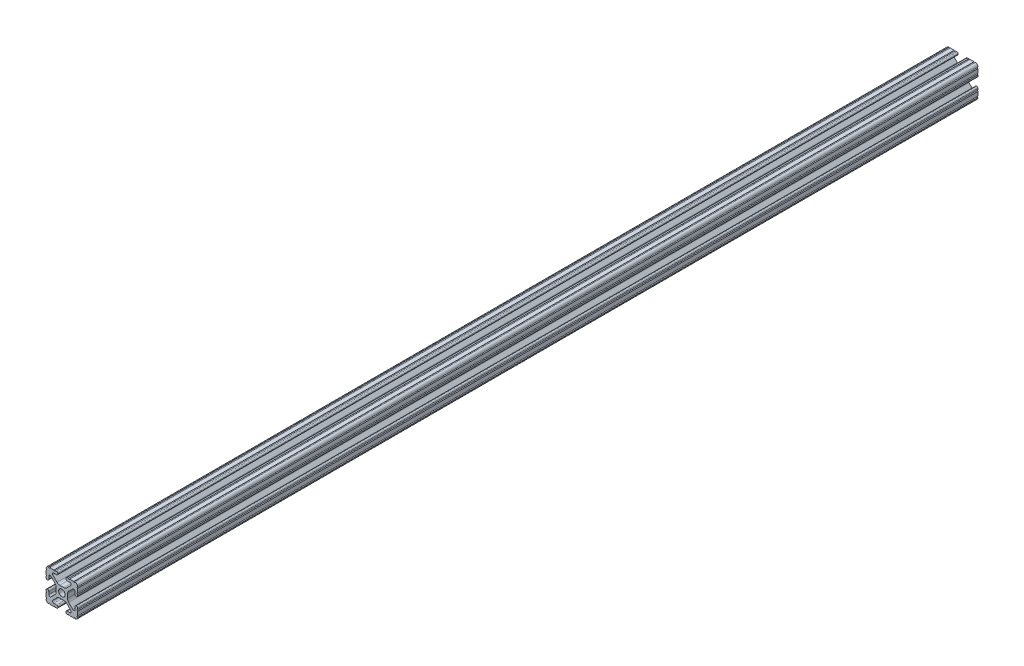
ISO-10303-21;
HEADER;
FILE_DESCRIPTION(('STEP AP214'),'2;1');
FILE_NAME('part.step','',(''),(''),'','','');
FILE_SCHEMA(('AUTOMOTIVE_DESIGN { 1 0 10303 214 1 1 1 1 }'));
ENDSEC;
DATA;
#1=APPLICATION_CONTEXT('core data for automotive mechanical design processes');
#2=APPLICATION_PROTOCOL_DEFINITION('international standard','automotive_design',2000,#1);
#3=PRODUCT_CONTEXT('',#1,'mechanical');
#4=PRODUCT('Part','Part','',(#3));
#5=PRODUCT_RELATED_PRODUCT_CATEGORY('part','',(#4));
#6=PRODUCT_DEFINITION_FORMATION('','',#4);
#7=PRODUCT_DEFINITION_CONTEXT('part definition',#1,'design');
#8=PRODUCT_DEFINITION('design','',#6,#7);
#9=PRODUCT_DEFINITION_SHAPE('','',#8);
#10=(LENGTH_UNIT() NAMED_UNIT(*) SI_UNIT(.MILLI.,.METRE.));
#11=(NAMED_UNIT(*) PLANE_ANGLE_UNIT() SI_UNIT($,.RADIAN.));
#12=(NAMED_UNIT(*) SI_UNIT($,.STERADIAN.) SOLID_ANGLE_UNIT());
#13=UNCERTAINTY_MEASURE_WITH_UNIT(LENGTH_MEASURE(1.E-05),#10,'distance_accuracy_value','');
#14=(GEOMETRIC_REPRESENTATION_CONTEXT(3) GLOBAL_UNCERTAINTY_ASSIGNED_CONTEXT((#13)) GLOBAL_UNIT_ASSIGNED_CONTEXT((#10,
#11,#12)) REPRESENTATION_CONTEXT('',''));
#15=CARTESIAN_POINT('',(0.,0.,0.));
#16=DIRECTION('',(0.,0.,1.));
#17=DIRECTION('',(1.,0.,0.));
#18=AXIS2_PLACEMENT_3D('',#15,#16,#17);
#19=CARTESIAN_POINT('',(-4.2875124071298,-10.4902000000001,757.077824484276));
#20=DIRECTION('',(0.,-1.,0.));
#21=DIRECTION('',(0.,0.,-1.));
#22=AXIS2_PLACEMENT_3D('',#19,#20,#21);
#23=PLANE('',#22);
#24=DIRECTION('',(-1.,0.,0.));
#25=VECTOR('',#24,1.);
#26=CARTESIAN_POINT('',(-4.2875124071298,-10.4902000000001,721.1568));
#27=LINE('',#26,#25);
#28=CARTESIAN_POINT('',(-4.2875124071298,-10.4902000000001,721.1568));
#29=VERTEX_POINT('',#28);
#30=CARTESIAN_POINT('',(-6.41640832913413,-10.4902000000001,721.1568));
#31=VERTEX_POINT('',#30);
#32=EDGE_CURVE('E629',#29,#31,#27,.T.);
#33=ORIENTED_EDGE('',*,*,#32,.F.);
#34=DIRECTION('',(0.,0.,-1.));
#35=VECTOR('',#34,1.);
#36=CARTESIAN_POINT('',(-4.2875124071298,-10.4902000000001,757.077824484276));
#37=LINE('',#36,#35);
#38=CARTESIAN_POINT('',(-4.2875124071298,-10.4902000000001,0.));
#39=VERTEX_POINT('',#38);
#40=EDGE_CURVE('E49',#29,#39,#37,.T.);
#41=ORIENTED_EDGE('',*,*,#40,.T.);
#42=DIRECTION('',(-1.,0.,0.));
#43=VECTOR('',#42,1.);
#44=CARTESIAN_POINT('',(-4.2875124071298,-10.4902000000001,0.));
#45=LINE('',#44,#43);
#46=CARTESIAN_POINT('',(-6.41640832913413,-10.4902000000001,0.));
#47=VERTEX_POINT('',#46);
#48=EDGE_CURVE('E632',#39,#47,#45,.T.);
#49=ORIENTED_EDGE('',*,*,#48,.T.);
#50=DIRECTION('',(0.,0.,-1.));
#51=VECTOR('',#50,1.);
#52=CARTESIAN_POINT('',(-6.41640832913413,-10.4902000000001,757.077824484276));
#53=LINE('',#52,#51);
#54=EDGE_CURVE('E626',#31,#47,#53,.T.);
#55=ORIENTED_EDGE('',*,*,#54,.F.);
#56=EDGE_LOOP('',(#33,#41,#49,#55));
#57=FACE_BOUND('',#56,.T.);
#58=ADVANCED_FACE('F33',(#57),#23,.F.);
#59=CARTESIAN_POINT('',(-4.2875124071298,-11.5392124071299,757.077824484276));
#60=DIRECTION('',(0.,0.,-1.));
#61=DIRECTION('',(-1.,0.,0.));
#62=AXIS2_PLACEMENT_3D('',#59,#60,#61);
#63=CYLINDRICAL_SURFACE('',#62,1.04901240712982);
#64=CARTESIAN_POINT('',(-4.2875124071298,-11.5392124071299,721.1568));
#65=DIRECTION('',(0.,0.,1.));
#66=DIRECTION('',(0.,-1.,0.));
#67=AXIS2_PLACEMENT_3D('',#64,#65,#66);
#68=CIRCLE('',#67,1.04901240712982);
#69=CARTESIAN_POINT('',(-3.23849999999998,-11.5392124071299,721.1568));
#70=VERTEX_POINT('',#69);
#71=EDGE_CURVE('E644',#70,#29,#68,.T.);
#72=ORIENTED_EDGE('',*,*,#71,.F.);
#73=DIRECTION('',(0.,0.,-1.));
#74=VECTOR('',#73,1.);
#75=CARTESIAN_POINT('',(-3.23849999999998,-11.5392124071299,757.077824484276));
#76=LINE('',#75,#74);
#77=CARTESIAN_POINT('',(-3.23849999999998,-11.5392124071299,0.));
#78=VERTEX_POINT('',#77);
#79=EDGE_CURVE('E1212',#70,#78,#76,.T.);
#80=ORIENTED_EDGE('',*,*,#79,.T.);
#81=CARTESIAN_POINT('',(-4.2875124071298,-11.5392124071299,0.));
#82=DIRECTION('',(0.,0.,1.));
#83=DIRECTION('',(1.,0.,0.));
#84=AXIS2_PLACEMENT_3D('',#81,#82,#83);
#85=CIRCLE('',#84,1.04901240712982);
#86=EDGE_CURVE('E1208',#78,#39,#85,.T.);
#87=ORIENTED_EDGE('',*,*,#86,.T.);
#88=ORIENTED_EDGE('',*,*,#40,.F.);
#89=EDGE_LOOP('',(#72,#80,#87,#88));
#90=FACE_BOUND('',#89,.T.);
#91=ADVANCED_FACE('F1770',(#90),#63,.T.);
#92=CARTESIAN_POINT('',(-3.23849999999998,-11.6509875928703,757.077824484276));
#93=DIRECTION('',(-1.,0.,0.));
#94=DIRECTION('',(0.,-1.,0.));
#95=AXIS2_PLACEMENT_3D('',#92,#93,#94);
#96=PLANE('',#95);
#97=DIRECTION('',(0.,1.,0.));
#98=VECTOR('',#97,1.);
#99=CARTESIAN_POINT('',(-3.23849999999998,-11.6509875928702,721.1568));
#100=LINE('',#99,#98);
#101=CARTESIAN_POINT('',(-3.23849999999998,-11.6509875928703,721.1568));
#102=VERTEX_POINT('',#101);
#103=EDGE_CURVE('E646',#102,#70,#100,.T.);
#104=ORIENTED_EDGE('',*,*,#103,.F.);
#105=DIRECTION('',(0.,0.,-1.));
#106=VECTOR('',#105,1.);
#107=CARTESIAN_POINT('',(-3.23849999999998,-11.6509875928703,757.077824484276));
#108=LINE('',#107,#106);
#109=CARTESIAN_POINT('',(-3.23849999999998,-11.6509875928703,0.));
#110=VERTEX_POINT('',#109);
#111=EDGE_CURVE('E1214',#102,#110,#108,.T.);
#112=ORIENTED_EDGE('',*,*,#111,.T.);
#113=DIRECTION('',(0.,1.,0.));
#114=VECTOR('',#113,1.);
#115=CARTESIAN_POINT('',(-3.23849999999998,-11.6509875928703,0.));
#116=LINE('',#115,#114);
#117=EDGE_CURVE('E1205',#110,#78,#116,.T.);
#118=ORIENTED_EDGE('',*,*,#117,.T.);
#119=ORIENTED_EDGE('',*,*,#79,.F.);
#120=EDGE_LOOP('',(#104,#112,#118,#119));
#121=FACE_BOUND('',#120,.T.);
#122=ADVANCED_FACE('F1767',(#121),#96,.F.);
#123=CARTESIAN_POINT('',(-4.2875124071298,-11.6509875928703,757.077824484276));
#124=DIRECTION('',(0.,0.,-1.));
#125=DIRECTION('',(-1.,0.,0.));
#126=AXIS2_PLACEMENT_3D('',#123,#124,#125);
#127=CYLINDRICAL_SURFACE('',#126,1.04901240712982);
#128=CARTESIAN_POINT('',(-4.2875124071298,-11.6509875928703,721.1568));
#129=DIRECTION('',(0.,0.,1.));
#130=DIRECTION('',(0.,-1.,0.));
#131=AXIS2_PLACEMENT_3D('',#128,#129,#130);
#132=CIRCLE('',#131,1.04901240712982);
#133=CARTESIAN_POINT('',(-4.2875124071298,-12.7000000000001,721.1568));
#134=VERTEX_POINT('',#133);
#135=EDGE_CURVE('E651',#134,#102,#132,.T.);
#136=ORIENTED_EDGE('',*,*,#135,.F.);
#137=DIRECTION('',(0.,0.,-1.));
#138=VECTOR('',#137,1.);
#139=CARTESIAN_POINT('',(-4.2875124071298,-12.7000000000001,757.077824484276));
#140=LINE('',#139,#138);
#141=CARTESIAN_POINT('',(-4.2875124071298,-12.7000000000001,0.));
#142=VERTEX_POINT('',#141);
#143=EDGE_CURVE('E1216',#134,#142,#140,.T.);
#144=ORIENTED_EDGE('',*,*,#143,.T.);
#145=CARTESIAN_POINT('',(-4.2875124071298,-11.6509875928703,0.));
#146=DIRECTION('',(0.,0.,1.));
#147=DIRECTION('',(1.,0.,0.));
#148=AXIS2_PLACEMENT_3D('',#145,#146,#147);
#149=CIRCLE('',#148,1.04901240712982);
#150=EDGE_CURVE('E1202',#142,#110,#149,.T.);
#151=ORIENTED_EDGE('',*,*,#150,.T.);
#152=ORIENTED_EDGE('',*,*,#111,.F.);
#153=EDGE_LOOP('',(#136,#144,#151,#152));
#154=FACE_BOUND('',#153,.T.);
#155=ADVANCED_FACE('F1763',(#154),#127,.T.);
#156=CARTESIAN_POINT('',(-5.31712671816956,-12.7000000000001,757.077824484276));
#157=DIRECTION('',(0.,1.,0.));
#158=DIRECTION('',(-1.,0.,0.));
#159=AXIS2_PLACEMENT_3D('',#156,#157,#158);
#160=PLANE('',#159);
#161=DIRECTION('',(1.,0.,0.));
#162=VECTOR('',#161,1.);
#163=CARTESIAN_POINT('',(-5.31712671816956,-12.7000000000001,721.1568));
#164=LINE('',#163,#162);
#165=CARTESIAN_POINT('',(-5.31712671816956,-12.7000000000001,721.1568));
#166=VERTEX_POINT('',#165);
#167=EDGE_CURVE('E654',#166,#134,#164,.T.);
#168=ORIENTED_EDGE('',*,*,#167,.F.);
#169=DIRECTION('',(0.,0.,-1.));
#170=VECTOR('',#169,1.);
#171=CARTESIAN_POINT('',(-5.31712671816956,-12.7000000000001,757.077824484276));
#172=LINE('',#171,#170);
#173=CARTESIAN_POINT('',(-5.31712671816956,-12.7000000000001,0.));
#174=VERTEX_POINT('',#173);
#175=EDGE_CURVE('E1218',#166,#174,#172,.T.);
#176=ORIENTED_EDGE('',*,*,#175,.T.);
#177=DIRECTION('',(1.,0.,0.));
#178=VECTOR('',#177,1.);
#179=CARTESIAN_POINT('',(-5.31712671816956,-12.7000000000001,0.));
#180=LINE('',#179,#178);
#181=EDGE_CURVE('E1199',#174,#142,#180,.T.);
#182=ORIENTED_EDGE('',*,*,#181,.T.);
#183=ORIENTED_EDGE('',*,*,#143,.F.);
#184=EDGE_LOOP('',(#168,#176,#182,#183));
#185=FACE_BOUND('',#184,.T.);
#186=ADVANCED_FACE('F1760',(#185),#160,.F.);
#187=CARTESIAN_POINT('',(-5.82512671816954,-12.7000000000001,757.077824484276));
#188=DIRECTION('',(0.,0.,-1.));
#189=DIRECTION('',(-1.,0.,0.));
#190=AXIS2_PLACEMENT_3D('',#187,#188,#189);
#191=CYLINDRICAL_SURFACE('',#190,0.507999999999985);
#192=CARTESIAN_POINT('',(-5.82512671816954,-12.7000000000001,721.1568));
#193=DIRECTION('',(0.,0.,1.));
#194=DIRECTION('',(0.,-1.,0.));
#195=AXIS2_PLACEMENT_3D('',#192,#193,#194);
#196=CIRCLE('',#195,0.507999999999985);
#197=CARTESIAN_POINT('',(-6.33312671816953,-12.7000000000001,721.1568));
#198=VERTEX_POINT('',#197);
#199=EDGE_CURVE('E657',#198,#166,#196,.F.);
#200=ORIENTED_EDGE('',*,*,#199,.F.);
#201=DIRECTION('',(0.,0.,-1.));
#202=VECTOR('',#201,1.);
#203=CARTESIAN_POINT('',(-6.33312671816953,-12.7000000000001,757.077824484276));
#204=LINE('',#203,#202);
#205=CARTESIAN_POINT('',(-6.33312671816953,-12.7000000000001,0.));
#206=VERTEX_POINT('',#205);
#207=EDGE_CURVE('E1220',#198,#206,#204,.T.);
#208=ORIENTED_EDGE('',*,*,#207,.T.);
#209=CARTESIAN_POINT('',(-5.82512671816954,-12.7000000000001,0.));
#210=DIRECTION('',(0.,0.,-1.));
#211=DIRECTION('',(1.,0.,0.));
#212=AXIS2_PLACEMENT_3D('',#209,#210,#211);
#213=CIRCLE('',#212,0.507999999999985);
#214=EDGE_CURVE('E1196',#206,#174,#213,.T.);
#215=ORIENTED_EDGE('',*,*,#214,.T.);
#216=ORIENTED_EDGE('',*,*,#175,.F.);
#217=EDGE_LOOP('',(#200,#208,#215,#216));
#218=FACE_BOUND('',#217,.T.);
#219=ADVANCED_FACE('F1755',(#218),#191,.F.);
#220=CARTESIAN_POINT('',(-9.55044311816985,-12.7000000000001,757.077824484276));
#221=DIRECTION('',(0.,1.,0.));
#222=DIRECTION('',(0.,0.,1.));
#223=AXIS2_PLACEMENT_3D('',#220,#221,#222);
#224=PLANE('',#223);
#225=DIRECTION('',(1.,0.,0.));
#226=VECTOR('',#225,1.);
#227=CARTESIAN_POINT('',(-9.55044311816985,-12.7000000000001,721.1568));
#228=LINE('',#227,#226);
#229=CARTESIAN_POINT('',(-9.55044311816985,-12.7000000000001,721.1568));
#230=VERTEX_POINT('',#229);
#231=EDGE_CURVE('E660',#230,#198,#228,.T.);
#232=ORIENTED_EDGE('',*,*,#231,.F.);
#233=DIRECTION('',(0.,0.,-1.));
#234=VECTOR('',#233,1.);
#235=CARTESIAN_POINT('',(-9.55044311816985,-12.7000000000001,757.077824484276));
#236=LINE('',#235,#234);
#237=CARTESIAN_POINT('',(-9.55044311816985,-12.7000000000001,0.));
#238=VERTEX_POINT('',#237);
#239=EDGE_CURVE('E1222',#230,#238,#236,.T.);
#240=ORIENTED_EDGE('',*,*,#239,.T.);
#241=DIRECTION('',(1.,0.,0.));
#242=VECTOR('',#241,1.);
#243=CARTESIAN_POINT('',(-9.55044311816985,-12.7000000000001,0.));
#244=LINE('',#243,#242);
#245=EDGE_CURVE('E1193',#238,#206,#244,.T.);
#246=ORIENTED_EDGE('',*,*,#245,.T.);
#247=ORIENTED_EDGE('',*,*,#207,.F.);
#248=EDGE_LOOP('',(#232,#240,#246,#247));
#249=FACE_BOUND('',#248,.T.);
#250=ADVANCED_FACE('F1751',(#249),#224,.F.);
#251=CARTESIAN_POINT('',(-10.0584431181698,-12.7000000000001,757.077824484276));
#252=DIRECTION('',(0.,0.,-1.));
#253=DIRECTION('',(-1.,0.,0.));
#254=AXIS2_PLACEMENT_3D('',#251,#252,#253);
#255=CYLINDRICAL_SURFACE('',#254,0.507999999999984);
#256=CARTESIAN_POINT('',(-10.0584431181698,-12.7000000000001,721.1568));
#257=DIRECTION('',(0.,0.,1.));
#258=DIRECTION('',(0.,-1.,0.));
#259=AXIS2_PLACEMENT_3D('',#256,#257,#258);
#260=CIRCLE('',#259,0.507999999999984);
#261=CARTESIAN_POINT('',(-10.5664430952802,-12.6998475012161,721.1568));
#262=VERTEX_POINT('',#261);
#263=EDGE_CURVE('E663',#262,#230,#260,.F.);
#264=ORIENTED_EDGE('',*,*,#263,.F.);
#265=DIRECTION('',(0.,0.,-1.));
#266=VECTOR('',#265,1.);
#267=CARTESIAN_POINT('',(-10.5664430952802,-12.6998475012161,757.077824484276));
#268=LINE('',#267,#266);
#269=CARTESIAN_POINT('',(-10.5664430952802,-12.6998475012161,0.));
#270=VERTEX_POINT('',#269);
#271=EDGE_CURVE('E1224',#262,#270,#268,.T.);
#272=ORIENTED_EDGE('',*,*,#271,.T.);
#273=CARTESIAN_POINT('',(-10.0584431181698,-12.7000000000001,0.));
#274=DIRECTION('',(0.,0.,-1.));
#275=DIRECTION('',(1.,0.,0.));
#276=AXIS2_PLACEMENT_3D('',#273,#274,#275);
#277=CIRCLE('',#276,0.507999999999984);
#278=EDGE_CURVE('E1190',#270,#238,#277,.T.);
#279=ORIENTED_EDGE('',*,*,#278,.T.);
#280=ORIENTED_EDGE('',*,*,#239,.F.);
#281=EDGE_LOOP('',(#264,#272,#279,#280));
#282=FACE_BOUND('',#281,.T.);
#283=ADVANCED_FACE('F1748',(#282),#255,.F.);
#284=CARTESIAN_POINT('',(-10.5918000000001,-10.5918000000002,757.077824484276));
#285=DIRECTION('',(0.,0.,-1.));
#286=DIRECTION('',(-1.,0.,0.));
#287=AXIS2_PLACEMENT_3D('',#284,#285,#286);
#288=CYLINDRICAL_SURFACE('',#287,2.1081999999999);
#289=CARTESIAN_POINT('',(-10.5918000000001,-10.5918000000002,721.1568));
#290=DIRECTION('',(0.,0.,1.));
#291=DIRECTION('',(0.,-1.,0.));
#292=AXIS2_PLACEMENT_3D('',#289,#290,#291);
#293=CIRCLE('',#292,2.1081999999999);
#294=CARTESIAN_POINT('',(-12.699846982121,-10.5663999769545,721.1568));
#295=VERTEX_POINT('',#294);
#296=EDGE_CURVE('E666',#295,#262,#293,.T.);
#297=ORIENTED_EDGE('',*,*,#296,.F.);
#298=DIRECTION('',(0.,0.,-1.));
#299=VECTOR('',#298,1.);
#300=CARTESIAN_POINT('',(-12.699846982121,-10.5663999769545,757.077824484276));
#301=LINE('',#300,#299);
#302=CARTESIAN_POINT('',(-12.699846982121,-10.5663999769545,0.));
#303=VERTEX_POINT('',#302);
#304=EDGE_CURVE('E1226',#295,#303,#301,.T.);
#305=ORIENTED_EDGE('',*,*,#304,.T.);
#306=CARTESIAN_POINT('',(-10.5918000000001,-10.5918000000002,0.));
#307=DIRECTION('',(0.,0.,1.));
#308=DIRECTION('',(1.,0.,0.));
#309=AXIS2_PLACEMENT_3D('',#306,#307,#308);
#310=CIRCLE('',#309,2.1081999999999);
#311=EDGE_CURVE('E1187',#303,#270,#310,.T.);
#312=ORIENTED_EDGE('',*,*,#311,.T.);
#313=ORIENTED_EDGE('',*,*,#271,.F.);
#314=EDGE_LOOP('',(#297,#305,#312,#313));
#315=FACE_BOUND('',#314,.T.);
#316=ADVANCED_FACE('F1743',(#315),#288,.T.);
#317=CARTESIAN_POINT('',(-12.7,-10.0584000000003,757.077824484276));
#318=DIRECTION('',(0.,0.,-1.));
#319=DIRECTION('',(-1.,0.,0.));
#320=AXIS2_PLACEMENT_3D('',#317,#318,#319);
#321=CYLINDRICAL_SURFACE('',#320,0.507999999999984);
#322=CARTESIAN_POINT('',(-12.7,-10.0584000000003,721.1568));
#323=DIRECTION('',(0.,0.,1.));
#324=DIRECTION('',(0.,-1.,0.));
#325=AXIS2_PLACEMENT_3D('',#322,#323,#324);
#326=CIRCLE('',#325,0.507999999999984);
#327=CARTESIAN_POINT('',(-12.7,-9.5504000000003,721.1568));
#328=VERTEX_POINT('',#327);
#329=EDGE_CURVE('E669',#328,#295,#326,.F.);
#330=ORIENTED_EDGE('',*,*,#329,.F.);
#331=DIRECTION('',(0.,0.,-1.));
#332=VECTOR('',#331,1.);
#333=CARTESIAN_POINT('',(-12.7,-9.5504000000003,757.077824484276));
#334=LINE('',#333,#332);
#335=CARTESIAN_POINT('',(-12.7,-9.5504000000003,0.));
#336=VERTEX_POINT('',#335);
#337=EDGE_CURVE('E1228',#328,#336,#334,.T.);
#338=ORIENTED_EDGE('',*,*,#337,.T.);
#339=CARTESIAN_POINT('',(-12.7,-10.0584000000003,0.));
#340=DIRECTION('',(0.,0.,-1.));
#341=DIRECTION('',(1.,0.,0.));
#342=AXIS2_PLACEMENT_3D('',#339,#340,#341);
#343=CIRCLE('',#342,0.507999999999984);
#344=EDGE_CURVE('E1184',#336,#303,#343,.T.);
#345=ORIENTED_EDGE('',*,*,#344,.T.);
#346=ORIENTED_EDGE('',*,*,#304,.F.);
#347=EDGE_LOOP('',(#330,#338,#345,#346));
#348=FACE_BOUND('',#347,.T.);
#349=ADVANCED_FACE('F1739',(#348),#321,.F.);
#350=CARTESIAN_POINT('',(-12.7,-6.33308359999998,757.077824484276));
#351=DIRECTION('',(1.,0.,0.));
#352=DIRECTION('',(0.,1.,0.));
#353=AXIS2_PLACEMENT_3D('',#350,#351,#352);
#354=PLANE('',#353);
#355=DIRECTION('',(0.,-1.,0.));
#356=VECTOR('',#355,1.);
#357=CARTESIAN_POINT('',(-12.7,-6.33308359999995,721.1568));
#358=LINE('',#357,#356);
#359=CARTESIAN_POINT('',(-12.7,-6.33308359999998,721.1568));
#360=VERTEX_POINT('',#359);
#361=EDGE_CURVE('E672',#360,#328,#358,.T.);
#362=ORIENTED_EDGE('',*,*,#361,.F.);
#363=DIRECTION('',(0.,0.,-1.));
#364=VECTOR('',#363,1.);
#365=CARTESIAN_POINT('',(-12.7,-6.33308359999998,757.077824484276));
#366=LINE('',#365,#364);
#367=CARTESIAN_POINT('',(-12.7,-6.33308359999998,0.));
#368=VERTEX_POINT('',#367);
#369=EDGE_CURVE('E1230',#360,#368,#366,.T.);
#370=ORIENTED_EDGE('',*,*,#369,.T.);
#371=DIRECTION('',(0.,-1.,0.));
#372=VECTOR('',#371,1.);
#373=CARTESIAN_POINT('',(-12.7,-6.33308359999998,0.));
#374=LINE('',#373,#372);
#375=EDGE_CURVE('E1181',#368,#336,#374,.T.);
#376=ORIENTED_EDGE('',*,*,#375,.T.);
#377=ORIENTED_EDGE('',*,*,#337,.F.);
#378=EDGE_LOOP('',(#362,#370,#376,#377));
#379=FACE_BOUND('',#378,.T.);
#380=ADVANCED_FACE('F1736',(#379),#354,.F.);
#381=CARTESIAN_POINT('',(-12.7,-5.8250836,757.077824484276));
#382=DIRECTION('',(0.,0.,-1.));
#383=DIRECTION('',(-1.,0.,0.));
#384=AXIS2_PLACEMENT_3D('',#381,#382,#383);
#385=CYLINDRICAL_SURFACE('',#384,0.507999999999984);
#386=CARTESIAN_POINT('',(-12.7,-5.8250836,721.1568));
#387=DIRECTION('',(0.,0.,1.));
#388=DIRECTION('',(0.,-1.,0.));
#389=AXIS2_PLACEMENT_3D('',#386,#387,#388);
#390=CIRCLE('',#389,0.507999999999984);
#391=CARTESIAN_POINT('',(-12.7,-5.31708360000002,721.1568));
#392=VERTEX_POINT('',#391);
#393=EDGE_CURVE('E675',#392,#360,#390,.F.);
#394=ORIENTED_EDGE('',*,*,#393,.F.);
#395=DIRECTION('',(0.,0.,-1.));
#396=VECTOR('',#395,1.);
#397=CARTESIAN_POINT('',(-12.7,-5.31708360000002,757.077824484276));
#398=LINE('',#397,#396);
#399=CARTESIAN_POINT('',(-12.7,-5.31708360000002,0.));
#400=VERTEX_POINT('',#399);
#401=EDGE_CURVE('E1232',#392,#400,#398,.T.);
#402=ORIENTED_EDGE('',*,*,#401,.T.);
#403=CARTESIAN_POINT('',(-12.7,-5.8250836,0.));
#404=DIRECTION('',(0.,0.,-1.));
#405=DIRECTION('',(1.,0.,0.));
#406=AXIS2_PLACEMENT_3D('',#403,#404,#405);
#407=CIRCLE('',#406,0.507999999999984);
#408=EDGE_CURVE('E1178',#400,#368,#407,.T.);
#409=ORIENTED_EDGE('',*,*,#408,.T.);
#410=ORIENTED_EDGE('',*,*,#369,.F.);
#411=EDGE_LOOP('',(#394,#402,#409,#410));
#412=FACE_BOUND('',#411,.T.);
#413=ADVANCED_FACE('F1731',(#412),#385,.F.);
#414=CARTESIAN_POINT('',(-12.7,-4.28746928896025,757.077824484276));
#415=DIRECTION('',(1.,0.,0.));
#416=DIRECTION('',(0.,1.,0.));
#417=AXIS2_PLACEMENT_3D('',#414,#415,#416);
#418=PLANE('',#417);
#419=DIRECTION('',(0.,-1.,0.));
#420=VECTOR('',#419,1.);
#421=CARTESIAN_POINT('',(-12.7,-4.28746928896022,721.1568));
#422=LINE('',#421,#420);
#423=CARTESIAN_POINT('',(-12.7,-4.28746928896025,721.1568));
#424=VERTEX_POINT('',#423);
#425=EDGE_CURVE('E678',#424,#392,#422,.T.);
#426=ORIENTED_EDGE('',*,*,#425,.F.);
#427=DIRECTION('',(0.,0.,-1.));
#428=VECTOR('',#427,1.);
#429=CARTESIAN_POINT('',(-12.7,-4.28746928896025,757.077824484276));
#430=LINE('',#429,#428);
#431=CARTESIAN_POINT('',(-12.7,-4.28746928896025,0.));
#432=VERTEX_POINT('',#431);
#433=EDGE_CURVE('E1234',#424,#432,#430,.T.);
#434=ORIENTED_EDGE('',*,*,#433,.T.);
#435=DIRECTION('',(0.,-1.,0.));
#436=VECTOR('',#435,1.);
#437=CARTESIAN_POINT('',(-12.7,-4.28746928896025,0.));
#438=LINE('',#437,#436);
#439=EDGE_CURVE('E1175',#432,#400,#438,.T.);
#440=ORIENTED_EDGE('',*,*,#439,.T.);
#441=ORIENTED_EDGE('',*,*,#401,.F.);
#442=EDGE_LOOP('',(#426,#434,#440,#441));
#443=FACE_BOUND('',#442,.T.);
#444=ADVANCED_FACE('F1727',(#443),#418,.F.);
#445=CARTESIAN_POINT('',(-11.6509875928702,-4.28746928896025,757.077824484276));
#446=DIRECTION('',(0.,0.,-1.));
#447=DIRECTION('',(-1.,0.,0.));
#448=AXIS2_PLACEMENT_3D('',#445,#446,#447);
#449=CYLINDRICAL_SURFACE('',#448,1.04901240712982);
#450=CARTESIAN_POINT('',(-11.6509875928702,-4.28746928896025,721.1568));
#451=DIRECTION('',(0.,0.,1.));
#452=DIRECTION('',(0.,-1.,0.));
#453=AXIS2_PLACEMENT_3D('',#450,#451,#452);
#454=CIRCLE('',#453,1.04901240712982);
#455=CARTESIAN_POINT('',(-11.6509875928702,-3.23845688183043,721.1568));
#456=VERTEX_POINT('',#455);
#457=EDGE_CURVE('E681',#456,#424,#454,.T.);
#458=ORIENTED_EDGE('',*,*,#457,.F.);
#459=DIRECTION('',(0.,0.,-1.));
#460=VECTOR('',#459,1.);
#461=CARTESIAN_POINT('',(-11.6509875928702,-3.23845688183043,757.077824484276));
#462=LINE('',#461,#460);
#463=CARTESIAN_POINT('',(-11.6509875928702,-3.23845688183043,0.));
#464=VERTEX_POINT('',#463);
#465=EDGE_CURVE('E1236',#456,#464,#462,.T.);
#466=ORIENTED_EDGE('',*,*,#465,.T.);
#467=CARTESIAN_POINT('',(-11.6509875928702,-4.28746928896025,0.));
#468=DIRECTION('',(0.,0.,1.));
#469=DIRECTION('',(1.,0.,0.));
#470=AXIS2_PLACEMENT_3D('',#467,#468,#469);
#471=CIRCLE('',#470,1.04901240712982);
#472=EDGE_CURVE('E1172',#464,#432,#471,.T.);
#473=ORIENTED_EDGE('',*,*,#472,.T.);
#474=ORIENTED_EDGE('',*,*,#433,.F.);
#475=EDGE_LOOP('',(#458,#466,#473,#474));
#476=FACE_BOUND('',#475,.T.);
#477=ADVANCED_FACE('F1724',(#476),#449,.T.);
#478=CARTESIAN_POINT('',(-11.5392124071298,-3.23845688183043,757.077824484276));
#479=DIRECTION('',(0.,-1.,0.));
#480=DIRECTION('',(0.,0.,-1.));
#481=AXIS2_PLACEMENT_3D('',#478,#479,#480);
#482=PLANE('',#481);
#483=DIRECTION('',(-1.,0.,0.));
#484=VECTOR('',#483,1.);
#485=CARTESIAN_POINT('',(-11.5392124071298,-3.23845688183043,721.1568));
#486=LINE('',#485,#484);
#487=CARTESIAN_POINT('',(-11.5392124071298,-3.23845688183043,721.1568));
#488=VERTEX_POINT('',#487);
#489=EDGE_CURVE('E684',#488,#456,#486,.T.);
#490=ORIENTED_EDGE('',*,*,#489,.F.);
#491=DIRECTION('',(0.,0.,-1.));
#492=VECTOR('',#491,1.);
#493=CARTESIAN_POINT('',(-11.5392124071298,-3.23845688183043,757.077824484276));
#494=LINE('',#493,#492);
#495=CARTESIAN_POINT('',(-11.5392124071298,-3.23845688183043,0.));
#496=VERTEX_POINT('',#495);
#497=EDGE_CURVE('E1238',#488,#496,#494,.T.);
#498=ORIENTED_EDGE('',*,*,#497,.T.);
#499=DIRECTION('',(-1.,0.,0.));
#500=VECTOR('',#499,1.);
#501=CARTESIAN_POINT('',(-11.5392124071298,-3.23845688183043,0.));
#502=LINE('',#501,#500);
#503=EDGE_CURVE('E1169',#496,#464,#502,.T.);
#504=ORIENTED_EDGE('',*,*,#503,.T.);
#505=ORIENTED_EDGE('',*,*,#465,.F.);
#506=EDGE_LOOP('',(#490,#498,#504,#505));
#507=FACE_BOUND('',#506,.T.);
#508=ADVANCED_FACE('F1719',(#507),#482,.F.);
#509=CARTESIAN_POINT('',(-11.5392124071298,-4.28746928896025,757.077824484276));
#510=DIRECTION('',(0.,0.,-1.));
#511=DIRECTION('',(-1.,0.,0.));
#512=AXIS2_PLACEMENT_3D('',#509,#510,#511);
#513=CYLINDRICAL_SURFACE('',#512,1.04901240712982);
#514=CARTESIAN_POINT('',(-11.5392124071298,-4.28746928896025,721.1568));
#515=DIRECTION('',(0.,0.,1.));
#516=DIRECTION('',(0.,-1.,0.));
#517=AXIS2_PLACEMENT_3D('',#514,#515,#516);
#518=CIRCLE('',#517,1.04901240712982);
#519=CARTESIAN_POINT('',(-10.4902,-4.28746928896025,721.1568));
#520=VERTEX_POINT('',#519);
#521=EDGE_CURVE('E687',#520,#488,#518,.T.);
#522=ORIENTED_EDGE('',*,*,#521,.F.);
#523=DIRECTION('',(0.,0.,-1.));
#524=VECTOR('',#523,1.);
#525=CARTESIAN_POINT('',(-10.4902,-4.28746928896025,757.077824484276));
#526=LINE('',#525,#524);
#527=CARTESIAN_POINT('',(-10.4902,-4.28746928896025,0.));
#528=VERTEX_POINT('',#527);
#529=EDGE_CURVE('E1240',#520,#528,#526,.T.);
#530=ORIENTED_EDGE('',*,*,#529,.T.);
#531=CARTESIAN_POINT('',(-11.5392124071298,-4.28746928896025,0.));
#532=DIRECTION('',(0.,0.,1.));
#533=DIRECTION('',(1.,0.,0.));
#534=AXIS2_PLACEMENT_3D('',#531,#532,#533);
#535=CIRCLE('',#534,1.04901240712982);
#536=EDGE_CURVE('E1166',#528,#496,#535,.T.);
#537=ORIENTED_EDGE('',*,*,#536,.T.);
#538=ORIENTED_EDGE('',*,*,#497,.F.);
#539=EDGE_LOOP('',(#522,#530,#537,#538));
#540=FACE_BOUND('',#539,.T.);
#541=ADVANCED_FACE('F1715',(#540),#513,.T.);
#542=CARTESIAN_POINT('',(-10.4902,-6.4020890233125,757.077824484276));
#543=DIRECTION('',(-1.,0.,0.));
#544=DIRECTION('',(0.,0.,1.));
#545=AXIS2_PLACEMENT_3D('',#542,#543,#544);
#546=PLANE('',#545);
#547=DIRECTION('',(0.,1.,0.));
#548=VECTOR('',#547,1.);
#549=CARTESIAN_POINT('',(-10.4902,-6.40208902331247,721.1568));
#550=LINE('',#549,#548);
#551=CARTESIAN_POINT('',(-10.4902,-6.4020890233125,721.1568));
#552=VERTEX_POINT('',#551);
#553=EDGE_CURVE('E690',#552,#520,#550,.T.);
#554=ORIENTED_EDGE('',*,*,#553,.F.);
#555=DIRECTION('',(0.,0.,-1.));
#556=VECTOR('',#555,1.);
#557=CARTESIAN_POINT('',(-10.4902,-6.4020890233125,757.077824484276));
#558=LINE('',#557,#556);
#559=CARTESIAN_POINT('',(-10.4902,-6.4020890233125,0.));
#560=VERTEX_POINT('',#559);
#561=EDGE_CURVE('E1242',#552,#560,#558,.T.);
#562=ORIENTED_EDGE('',*,*,#561,.T.);
#563=DIRECTION('',(0.,1.,0.));
#564=VECTOR('',#563,1.);
#565=CARTESIAN_POINT('',(-10.4902,-6.4020890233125,0.));
#566=LINE('',#565,#564);
#567=EDGE_CURVE('E1163',#560,#528,#566,.T.);
#568=ORIENTED_EDGE('',*,*,#567,.T.);
#569=ORIENTED_EDGE('',*,*,#529,.F.);
#570=EDGE_LOOP('',(#554,#562,#568,#569));
#571=FACE_BOUND('',#570,.T.);
#572=ADVANCED_FACE('F1712',(#571),#546,.F.);
#573=CARTESIAN_POINT('',(-9.4627890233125,-6.4020890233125,757.077824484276));
#574=DIRECTION('',(0.,0.,-1.));
#575=DIRECTION('',(-1.,0.,0.));
#576=AXIS2_PLACEMENT_3D('',#573,#574,#575);
#577=CYLINDRICAL_SURFACE('',#576,1.0274109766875);
#578=CARTESIAN_POINT('',(-9.4627890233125,-6.4020890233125,721.1568));
#579=DIRECTION('',(0.,0.,1.));
#580=DIRECTION('',(0.,-1.,0.));
#581=AXIS2_PLACEMENT_3D('',#578,#579,#580);
#582=CIRCLE('',#581,1.0274109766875);
#583=CARTESIAN_POINT('',(-8.7371313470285,-7.12940893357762,721.1568));
#584=VERTEX_POINT('',#583);
#585=EDGE_CURVE('E693',#584,#552,#582,.F.);
#586=ORIENTED_EDGE('',*,*,#585,.F.);
#587=DIRECTION('',(0.,0.,-1.));
#588=VECTOR('',#587,1.);
#589=CARTESIAN_POINT('',(-8.7371313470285,-7.12940893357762,757.077824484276));
#590=LINE('',#589,#588);
#591=CARTESIAN_POINT('',(-8.7371313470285,-7.12940893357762,0.));
#592=VERTEX_POINT('',#591);
#593=EDGE_CURVE('E1244',#584,#592,#590,.T.);
#594=ORIENTED_EDGE('',*,*,#593,.T.);
#595=CARTESIAN_POINT('',(-9.4627890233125,-6.4020890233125,0.));
#596=DIRECTION('',(0.,0.,-1.));
#597=DIRECTION('',(1.,0.,0.));
#598=AXIS2_PLACEMENT_3D('',#595,#596,#597);
#599=CIRCLE('',#598,1.0274109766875);
#600=EDGE_CURVE('E1160',#592,#560,#599,.T.);
#601=ORIENTED_EDGE('',*,*,#600,.T.);
#602=ORIENTED_EDGE('',*,*,#561,.F.);
#603=EDGE_LOOP('',(#586,#594,#601,#602));
#604=FACE_BOUND('',#603,.T.);
#605=ADVANCED_FACE('F1707',(#604),#577,.F.);
#606=CARTESIAN_POINT('',(-5.44100583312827,-3.84081646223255,757.077824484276));
#607=DIRECTION('',(0.706297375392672,-0.707915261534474,0.));
#608=DIRECTION('',(0.707915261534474,0.706297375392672,0.));
#609=AXIS2_PLACEMENT_3D('',#606,#607,#608);
#610=PLANE('',#609);
#611=DIRECTION('',(-0.707915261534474,-0.706297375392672,0.));
#612=VECTOR('',#611,1.);
#613=CARTESIAN_POINT('',(-5.44100583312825,-3.84081646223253,721.1568));
#614=LINE('',#613,#612);
#615=CARTESIAN_POINT('',(-5.44100583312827,-3.84081646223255,721.1568));
#616=VERTEX_POINT('',#615);
#617=EDGE_CURVE('E696',#616,#584,#614,.T.);
#618=ORIENTED_EDGE('',*,*,#617,.F.);
#619=DIRECTION('',(0.,0.,-1.));
#620=VECTOR('',#619,1.);
#621=CARTESIAN_POINT('',(-5.44100583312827,-3.84081646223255,757.077824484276));
#622=LINE('',#621,#620);
#623=CARTESIAN_POINT('',(-5.44100583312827,-3.84081646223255,0.));
#624=VERTEX_POINT('',#623);
#625=EDGE_CURVE('E1246',#616,#624,#622,.T.);
#626=ORIENTED_EDGE('',*,*,#625,.T.);
#627=DIRECTION('',(-0.707915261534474,-0.706297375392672,0.));
#628=VECTOR('',#627,1.);
#629=CARTESIAN_POINT('',(-5.44100583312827,-3.84081646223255,0.));
#630=LINE('',#629,#628);
#631=EDGE_CURVE('E1157',#624,#592,#630,.T.);
#632=ORIENTED_EDGE('',*,*,#631,.T.);
#633=ORIENTED_EDGE('',*,*,#593,.F.);
#634=EDGE_LOOP('',(#618,#626,#632,#633));
#635=FACE_BOUND('',#634,.T.);
#636=ADVANCED_FACE('F1703',(#635),#610,.F.);
#637=CARTESIAN_POINT('',(-7.68350000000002,-1.59318550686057,757.077824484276));
#638=DIRECTION('',(0.,0.,-1.));
#639=DIRECTION('',(-1.,0.,0.));
#640=AXIS2_PLACEMENT_3D('',#637,#638,#639);
#641=CYLINDRICAL_SURFACE('',#640,3.17500000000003);
#642=CARTESIAN_POINT('',(-7.68350000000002,-1.59318550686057,721.1568));
#643=DIRECTION('',(0.,0.,1.));
#644=DIRECTION('',(0.,-1.,0.));
#645=AXIS2_PLACEMENT_3D('',#642,#643,#644);
#646=CIRCLE('',#645,3.17500000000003);
#647=CARTESIAN_POINT('',(-4.5085,-1.59318550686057,721.1568));
#648=VERTEX_POINT('',#647);
#649=EDGE_CURVE('E699',#648,#616,#646,.F.);
#650=ORIENTED_EDGE('',*,*,#649,.F.);
#651=DIRECTION('',(0.,0.,-1.));
#652=VECTOR('',#651,1.);
#653=CARTESIAN_POINT('',(-4.5085,-1.59318550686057,757.077824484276));
#654=LINE('',#653,#652);
#655=CARTESIAN_POINT('',(-4.5085,-1.59318550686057,0.));
#656=VERTEX_POINT('',#655);
#657=EDGE_CURVE('E1248',#648,#656,#654,.T.);
#658=ORIENTED_EDGE('',*,*,#657,.T.);
#659=CARTESIAN_POINT('',(-7.68350000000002,-1.59318550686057,0.));
#660=DIRECTION('',(0.,0.,-1.));
#661=DIRECTION('',(1.,0.,0.));
#662=AXIS2_PLACEMENT_3D('',#659,#660,#661);
#663=CIRCLE('',#662,3.17500000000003);
#664=EDGE_CURVE('E1154',#656,#624,#663,.T.);
#665=ORIENTED_EDGE('',*,*,#664,.T.);
#666=ORIENTED_EDGE('',*,*,#625,.F.);
#667=EDGE_LOOP('',(#650,#658,#665,#666));
#668=FACE_BOUND('',#667,.T.);
#669=ADVANCED_FACE('F1700',(#668),#641,.F.);
#670=CARTESIAN_POINT('',(-4.5085,1.59318550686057,757.077824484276));
#671=DIRECTION('',(1.,0.,0.));
#672=DIRECTION('',(0.,1.,0.));
#673=AXIS2_PLACEMENT_3D('',#670,#671,#672);
#674=PLANE('',#673);
#675=DIRECTION('',(0.,-1.,0.));
#676=VECTOR('',#675,1.);
#677=CARTESIAN_POINT('',(-4.5085,1.59318550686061,721.1568));
#678=LINE('',#677,#676);
#679=CARTESIAN_POINT('',(-4.50850000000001,1.59318550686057,721.1568));
#680=VERTEX_POINT('',#679);
#681=EDGE_CURVE('E702',#680,#648,#678,.T.);
#682=ORIENTED_EDGE('',*,*,#681,.F.);
#683=DIRECTION('',(0.,0.,-1.));
#684=VECTOR('',#683,1.);
#685=CARTESIAN_POINT('',(-4.50850000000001,1.59318550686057,757.077824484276));
#686=LINE('',#685,#684);
#687=CARTESIAN_POINT('',(-4.50850000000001,1.59318550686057,0.));
#688=VERTEX_POINT('',#687);
#689=EDGE_CURVE('E1250',#680,#688,#686,.T.);
#690=ORIENTED_EDGE('',*,*,#689,.T.);
#691=DIRECTION('',(0.,-1.,0.));
#692=VECTOR('',#691,1.);
#693=CARTESIAN_POINT('',(-4.5085,1.59318550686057,0.));
#694=LINE('',#693,#692);
#695=EDGE_CURVE('E1151',#688,#656,#694,.T.);
#696=ORIENTED_EDGE('',*,*,#695,.T.);
#697=ORIENTED_EDGE('',*,*,#657,.F.);
#698=EDGE_LOOP('',(#682,#690,#696,#697));
#699=FACE_BOUND('',#698,.T.);
#700=ADVANCED_FACE('F1695',(#699),#674,.F.);
#701=CARTESIAN_POINT('',(-7.68350000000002,1.59318550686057,757.077824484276));
#702=DIRECTION('',(0.,0.,-1.));
#703=DIRECTION('',(-1.,0.,0.));
#704=AXIS2_PLACEMENT_3D('',#701,#702,#703);
#705=CYLINDRICAL_SURFACE('',#704,3.17500000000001);
#706=CARTESIAN_POINT('',(-7.68350000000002,1.59318550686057,721.1568));
#707=DIRECTION('',(0.,0.,1.));
#708=DIRECTION('',(0.,-1.,0.));
#709=AXIS2_PLACEMENT_3D('',#706,#707,#708);
#710=CIRCLE('',#709,3.17500000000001);
#711=CARTESIAN_POINT('',(-5.44100583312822,3.84081646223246,721.1568));
#712=VERTEX_POINT('',#711);
#713=EDGE_CURVE('E705',#712,#680,#710,.F.);
#714=ORIENTED_EDGE('',*,*,#713,.F.);
#715=DIRECTION('',(0.,0.,-1.));
#716=VECTOR('',#715,1.);
#717=CARTESIAN_POINT('',(-5.44100583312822,3.84081646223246,757.077824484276));
#718=LINE('',#717,#716);
#719=CARTESIAN_POINT('',(-5.44100583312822,3.84081646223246,0.));
#720=VERTEX_POINT('',#719);
#721=EDGE_CURVE('E1252',#712,#720,#718,.T.);
#722=ORIENTED_EDGE('',*,*,#721,.T.);
#723=CARTESIAN_POINT('',(-7.68350000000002,1.59318550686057,0.));
#724=DIRECTION('',(0.,0.,-1.));
#725=DIRECTION('',(1.,0.,0.));
#726=AXIS2_PLACEMENT_3D('',#723,#724,#725);
#727=CIRCLE('',#726,3.17500000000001);
#728=EDGE_CURVE('E1148',#720,#688,#727,.T.);
#729=ORIENTED_EDGE('',*,*,#728,.T.);
#730=ORIENTED_EDGE('',*,*,#689,.F.);
#731=EDGE_LOOP('',(#714,#722,#729,#730));
#732=FACE_BOUND('',#731,.T.);
#733=ADVANCED_FACE('F1691',(#732),#705,.F.);
#734=CARTESIAN_POINT('',(-8.73713134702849,7.12940893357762,757.077824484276));
#735=DIRECTION('',(0.706297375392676,0.707915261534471,0.));
#736=DIRECTION('',(-0.707915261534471,0.706297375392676,0.));
#737=AXIS2_PLACEMENT_3D('',#734,#735,#736);
#738=PLANE('',#737);
#739=DIRECTION('',(0.707915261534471,-0.706297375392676,0.));
#740=VECTOR('',#739,1.);
#741=CARTESIAN_POINT('',(-8.73713134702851,7.12940893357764,721.1568));
#742=LINE('',#741,#740);
#743=CARTESIAN_POINT('',(-8.73713134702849,7.12940893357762,721.1568));
#744=VERTEX_POINT('',#743);
#745=EDGE_CURVE('E708',#744,#712,#742,.T.);
#746=ORIENTED_EDGE('',*,*,#745,.F.);
#747=DIRECTION('',(0.,0.,-1.));
#748=VECTOR('',#747,1.);
#749=CARTESIAN_POINT('',(-8.73713134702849,7.12940893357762,757.077824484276));
#750=LINE('',#749,#748);
#751=CARTESIAN_POINT('',(-8.73713134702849,7.12940893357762,0.));
#752=VERTEX_POINT('',#751);
#753=EDGE_CURVE('E1254',#744,#752,#750,.T.);
#754=ORIENTED_EDGE('',*,*,#753,.T.);
#755=DIRECTION('',(0.707915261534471,-0.706297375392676,0.));
#756=VECTOR('',#755,1.);
#757=CARTESIAN_POINT('',(-8.73713134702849,7.12940893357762,0.));
#758=LINE('',#757,#756);
#759=EDGE_CURVE('E1145',#752,#720,#758,.T.);
#760=ORIENTED_EDGE('',*,*,#759,.T.);
#761=ORIENTED_EDGE('',*,*,#721,.F.);
#762=EDGE_LOOP('',(#746,#754,#760,#761));
#763=FACE_BOUND('',#762,.T.);
#764=ADVANCED_FACE('F1688',(#763),#738,.F.);
#765=CARTESIAN_POINT('',(-9.4627890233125,6.4020890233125,757.077824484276));
#766=DIRECTION('',(0.,0.,-1.));
#767=DIRECTION('',(-1.,0.,0.));
#768=AXIS2_PLACEMENT_3D('',#765,#766,#767);
#769=CYLINDRICAL_SURFACE('',#768,1.0274109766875);
#770=CARTESIAN_POINT('',(-9.4627890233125,6.4020890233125,721.1568));
#771=DIRECTION('',(0.,0.,1.));
#772=DIRECTION('',(0.,-1.,0.));
#773=AXIS2_PLACEMENT_3D('',#770,#771,#772);
#774=CIRCLE('',#773,1.0274109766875);
#775=CARTESIAN_POINT('',(-10.4902,6.4020890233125,721.1568));
#776=VERTEX_POINT('',#775);
#777=EDGE_CURVE('E711',#776,#744,#774,.F.);
#778=ORIENTED_EDGE('',*,*,#777,.F.);
#779=DIRECTION('',(0.,0.,-1.));
#780=VECTOR('',#779,1.);
#781=CARTESIAN_POINT('',(-10.4902,6.4020890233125,757.077824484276));
#782=LINE('',#781,#780);
#783=CARTESIAN_POINT('',(-10.4902,6.4020890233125,0.));
#784=VERTEX_POINT('',#783);
#785=EDGE_CURVE('E1256',#776,#784,#782,.T.);
#786=ORIENTED_EDGE('',*,*,#785,.T.);
#787=CARTESIAN_POINT('',(-9.4627890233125,6.4020890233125,0.));
#788=DIRECTION('',(0.,0.,-1.));
#789=DIRECTION('',(1.,0.,0.));
#790=AXIS2_PLACEMENT_3D('',#787,#788,#789);
#791=CIRCLE('',#790,1.0274109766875);
#792=EDGE_CURVE('E1142',#784,#752,#791,.T.);
#793=ORIENTED_EDGE('',*,*,#792,.T.);
#794=ORIENTED_EDGE('',*,*,#753,.F.);
#795=EDGE_LOOP('',(#778,#786,#793,#794));
#796=FACE_BOUND('',#795,.T.);
#797=ADVANCED_FACE('F1683',(#796),#769,.F.);
#798=CARTESIAN_POINT('',(-10.4902,4.28746928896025,757.077824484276));
#799=DIRECTION('',(-1.,0.,0.));
#800=DIRECTION('',(0.,-1.,0.));
#801=AXIS2_PLACEMENT_3D('',#798,#799,#800);
#802=PLANE('',#801);
#803=DIRECTION('',(0.,1.,0.));
#804=VECTOR('',#803,1.);
#805=CARTESIAN_POINT('',(-10.4902,4.28746928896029,721.1568));
#806=LINE('',#805,#804);
#807=CARTESIAN_POINT('',(-10.4902,4.28746928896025,721.1568));
#808=VERTEX_POINT('',#807);
#809=EDGE_CURVE('E714',#808,#776,#806,.T.);
#810=ORIENTED_EDGE('',*,*,#809,.F.);
#811=DIRECTION('',(0.,0.,-1.));
#812=VECTOR('',#811,1.);
#813=CARTESIAN_POINT('',(-10.4902,4.28746928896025,757.077824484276));
#814=LINE('',#813,#812);
#815=CARTESIAN_POINT('',(-10.4902,4.28746928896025,0.));
#816=VERTEX_POINT('',#815);
#817=EDGE_CURVE('E1258',#808,#816,#814,.T.);
#818=ORIENTED_EDGE('',*,*,#817,.T.);
#819=DIRECTION('',(0.,1.,0.));
#820=VECTOR('',#819,1.);
#821=CARTESIAN_POINT('',(-10.4902,4.28746928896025,0.));
#822=LINE('',#821,#820);
#823=EDGE_CURVE('E1139',#816,#784,#822,.T.);
#824=ORIENTED_EDGE('',*,*,#823,.T.);
#825=ORIENTED_EDGE('',*,*,#785,.F.);
#826=EDGE_LOOP('',(#810,#818,#824,#825));
#827=FACE_BOUND('',#826,.T.);
#828=ADVANCED_FACE('F1679',(#827),#802,.F.);
#829=CARTESIAN_POINT('',(-11.5392124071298,4.28746928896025,757.077824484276));
#830=DIRECTION('',(0.,0.,-1.));
#831=DIRECTION('',(-1.,0.,0.));
#832=AXIS2_PLACEMENT_3D('',#829,#830,#831);
#833=CYLINDRICAL_SURFACE('',#832,1.04901240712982);
#834=CARTESIAN_POINT('',(-11.5392124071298,4.28746928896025,721.1568));
#835=DIRECTION('',(0.,0.,1.));
#836=DIRECTION('',(0.,-1.,0.));
#837=AXIS2_PLACEMENT_3D('',#834,#835,#836);
#838=CIRCLE('',#837,1.04901240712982);
#839=CARTESIAN_POINT('',(-11.5392124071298,3.23845688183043,721.1568));
#840=VERTEX_POINT('',#839);
#841=EDGE_CURVE('E717',#840,#808,#838,.T.);
#842=ORIENTED_EDGE('',*,*,#841,.F.);
#843=DIRECTION('',(0.,0.,-1.));
#844=VECTOR('',#843,1.);
#845=CARTESIAN_POINT('',(-11.5392124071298,3.23845688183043,757.077824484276));
#846=LINE('',#845,#844);
#847=CARTESIAN_POINT('',(-11.5392124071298,3.23845688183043,0.));
#848=VERTEX_POINT('',#847);
#849=EDGE_CURVE('E1260',#840,#848,#846,.T.);
#850=ORIENTED_EDGE('',*,*,#849,.T.);
#851=CARTESIAN_POINT('',(-11.5392124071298,4.28746928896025,0.));
#852=DIRECTION('',(0.,0.,1.));
#853=DIRECTION('',(1.,0.,0.));
#854=AXIS2_PLACEMENT_3D('',#851,#852,#853);
#855=CIRCLE('',#854,1.04901240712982);
#856=EDGE_CURVE('E1136',#848,#816,#855,.T.);
#857=ORIENTED_EDGE('',*,*,#856,.T.);
#858=ORIENTED_EDGE('',*,*,#817,.F.);
#859=EDGE_LOOP('',(#842,#850,#857,#858));
#860=FACE_BOUND('',#859,.T.);
#861=ADVANCED_FACE('F1676',(#860),#833,.T.);
#862=CARTESIAN_POINT('',(-11.6509875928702,3.23845688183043,757.077824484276));
#863=DIRECTION('',(0.,1.,0.));
#864=DIRECTION('',(-1.,0.,0.));
#865=AXIS2_PLACEMENT_3D('',#862,#863,#864);
#866=PLANE('',#865);
#867=DIRECTION('',(1.,0.,0.));
#868=VECTOR('',#867,1.);
#869=CARTESIAN_POINT('',(-11.6509875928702,3.23845688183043,721.1568));
#870=LINE('',#869,#868);
#871=CARTESIAN_POINT('',(-11.6509875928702,3.23845688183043,721.1568));
#872=VERTEX_POINT('',#871);
#873=EDGE_CURVE('E720',#872,#840,#870,.T.);
#874=ORIENTED_EDGE('',*,*,#873,.F.);
#875=DIRECTION('',(0.,0.,-1.));
#876=VECTOR('',#875,1.);
#877=CARTESIAN_POINT('',(-11.6509875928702,3.23845688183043,757.077824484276));
#878=LINE('',#877,#876);
#879=CARTESIAN_POINT('',(-11.6509875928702,3.23845688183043,0.));
#880=VERTEX_POINT('',#879);
#881=EDGE_CURVE('E1262',#872,#880,#878,.T.);
#882=ORIENTED_EDGE('',*,*,#881,.T.);
#883=DIRECTION('',(1.,0.,0.));
#884=VECTOR('',#883,1.);
#885=CARTESIAN_POINT('',(-11.6509875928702,3.23845688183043,0.));
#886=LINE('',#885,#884);
#887=EDGE_CURVE('E1133',#880,#848,#886,.T.);
#888=ORIENTED_EDGE('',*,*,#887,.T.);
#889=ORIENTED_EDGE('',*,*,#849,.F.);
#890=EDGE_LOOP('',(#874,#882,#888,#889));
#891=FACE_BOUND('',#890,.T.);
#892=ADVANCED_FACE('F1671',(#891),#866,.F.);
#893=CARTESIAN_POINT('',(-11.6509875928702,4.28746928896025,757.077824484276));
#894=DIRECTION('',(0.,0.,-1.));
#895=DIRECTION('',(-1.,0.,0.));
#896=AXIS2_PLACEMENT_3D('',#893,#894,#895);
#897=CYLINDRICAL_SURFACE('',#896,1.04901240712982);
#898=CARTESIAN_POINT('',(-11.6509875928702,4.28746928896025,721.1568));
#899=DIRECTION('',(0.,0.,1.));
#900=DIRECTION('',(0.,-1.,0.));
#901=AXIS2_PLACEMENT_3D('',#898,#899,#900);
#902=CIRCLE('',#901,1.04901240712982);
#903=CARTESIAN_POINT('',(-12.7,4.28746928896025,721.1568));
#904=VERTEX_POINT('',#903);
#905=EDGE_CURVE('E723',#904,#872,#902,.T.);
#906=ORIENTED_EDGE('',*,*,#905,.F.);
#907=DIRECTION('',(0.,0.,-1.));
#908=VECTOR('',#907,1.);
#909=CARTESIAN_POINT('',(-12.7,4.28746928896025,757.077824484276));
#910=LINE('',#909,#908);
#911=CARTESIAN_POINT('',(-12.7,4.28746928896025,0.));
#912=VERTEX_POINT('',#911);
#913=EDGE_CURVE('E1264',#904,#912,#910,.T.);
#914=ORIENTED_EDGE('',*,*,#913,.T.);
#915=CARTESIAN_POINT('',(-11.6509875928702,4.28746928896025,0.));
#916=DIRECTION('',(0.,0.,1.));
#917=DIRECTION('',(1.,0.,0.));
#918=AXIS2_PLACEMENT_3D('',#915,#916,#917);
#919=CIRCLE('',#918,1.04901240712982);
#920=EDGE_CURVE('E1130',#912,#880,#919,.T.);
#921=ORIENTED_EDGE('',*,*,#920,.T.);
#922=ORIENTED_EDGE('',*,*,#881,.F.);
#923=EDGE_LOOP('',(#906,#914,#921,#922));
#924=FACE_BOUND('',#923,.T.);
#925=ADVANCED_FACE('F1667',(#924),#897,.T.);
#926=CARTESIAN_POINT('',(-12.7,5.31708360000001,757.077824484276));
#927=DIRECTION('',(1.,0.,0.));
#928=DIRECTION('',(0.,1.,0.));
#929=AXIS2_PLACEMENT_3D('',#926,#927,#928);
#930=PLANE('',#929);
#931=DIRECTION('',(0.,-1.,0.));
#932=VECTOR('',#931,1.);
#933=CARTESIAN_POINT('',(-12.7,5.31708360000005,721.1568));
#934=LINE('',#933,#932);
#935=CARTESIAN_POINT('',(-12.7,5.31708360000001,721.1568));
#936=VERTEX_POINT('',#935);
#937=EDGE_CURVE('E726',#936,#904,#934,.T.);
#938=ORIENTED_EDGE('',*,*,#937,.F.);
#939=DIRECTION('',(0.,0.,-1.));
#940=VECTOR('',#939,1.);
#941=CARTESIAN_POINT('',(-12.7,5.31708360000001,757.077824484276));
#942=LINE('',#941,#940);
#943=CARTESIAN_POINT('',(-12.7,5.31708360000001,0.));
#944=VERTEX_POINT('',#943);
#945=EDGE_CURVE('E1266',#936,#944,#942,.T.);
#946=ORIENTED_EDGE('',*,*,#945,.T.);
#947=DIRECTION('',(0.,-1.,0.));
#948=VECTOR('',#947,1.);
#949=CARTESIAN_POINT('',(-12.7,5.31708360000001,0.));
#950=LINE('',#949,#948);
#951=EDGE_CURVE('E1127',#944,#912,#950,.T.);
#952=ORIENTED_EDGE('',*,*,#951,.T.);
#953=ORIENTED_EDGE('',*,*,#913,.F.);
#954=EDGE_LOOP('',(#938,#946,#952,#953));
#955=FACE_BOUND('',#954,.T.);
#956=ADVANCED_FACE('F1664',(#955),#930,.F.);
#957=CARTESIAN_POINT('',(-12.7,5.8250836,757.077824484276));
#958=DIRECTION('',(0.,0.,-1.));
#959=DIRECTION('',(-1.,0.,0.));
#960=AXIS2_PLACEMENT_3D('',#957,#958,#959);
#961=CYLINDRICAL_SURFACE('',#960,0.507999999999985);
#962=CARTESIAN_POINT('',(-12.7,5.8250836,721.1568));
#963=DIRECTION('',(0.,0.,1.));
#964=DIRECTION('',(0.,-1.,0.));
#965=AXIS2_PLACEMENT_3D('',#962,#963,#964);
#966=CIRCLE('',#965,0.507999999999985);
#967=CARTESIAN_POINT('',(-12.7,6.33308359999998,721.1568));
#968=VERTEX_POINT('',#967);
#969=EDGE_CURVE('E729',#968,#936,#966,.F.);
#970=ORIENTED_EDGE('',*,*,#969,.F.);
#971=DIRECTION('',(0.,0.,-1.));
#972=VECTOR('',#971,1.);
#973=CARTESIAN_POINT('',(-12.7,6.33308359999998,757.077824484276));
#974=LINE('',#973,#972);
#975=CARTESIAN_POINT('',(-12.7,6.33308359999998,0.));
#976=VERTEX_POINT('',#975);
#977=EDGE_CURVE('E1268',#968,#976,#974,.T.);
#978=ORIENTED_EDGE('',*,*,#977,.T.);
#979=CARTESIAN_POINT('',(-12.7,5.8250836,0.));
#980=DIRECTION('',(0.,0.,-1.));
#981=DIRECTION('',(1.,0.,0.));
#982=AXIS2_PLACEMENT_3D('',#979,#980,#981);
#983=CIRCLE('',#982,0.507999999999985);
#984=EDGE_CURVE('E1124',#976,#944,#983,.T.);
#985=ORIENTED_EDGE('',*,*,#984,.T.);
#986=ORIENTED_EDGE('',*,*,#945,.F.);
#987=EDGE_LOOP('',(#970,#978,#985,#986));
#988=FACE_BOUND('',#987,.T.);
#989=ADVANCED_FACE('F1659',(#988),#961,.F.);
#990=CARTESIAN_POINT('',(-12.7,9.5504000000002,757.077824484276));
#991=DIRECTION('',(1.,0.,0.));
#992=DIRECTION('',(0.,0.,-1.));
#993=AXIS2_PLACEMENT_3D('',#990,#991,#992);
#994=PLANE('',#993);
#995=DIRECTION('',(0.,-1.,0.));
#996=VECTOR('',#995,1.);
#997=CARTESIAN_POINT('',(-12.7,9.55040000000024,721.1568));
#998=LINE('',#997,#996);
#999=CARTESIAN_POINT('',(-12.7,9.55040000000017,721.1568));
#1000=VERTEX_POINT('',#999);
#1001=EDGE_CURVE('E732',#1000,#968,#998,.T.);
#1002=ORIENTED_EDGE('',*,*,#1001,.F.);
#1003=DIRECTION('',(0.,0.,-1.));
#1004=VECTOR('',#1003,1.);
#1005=CARTESIAN_POINT('',(-12.7,9.55040000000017,757.077824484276));
#1006=LINE('',#1005,#1004);
#1007=CARTESIAN_POINT('',(-12.7,9.55040000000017,0.));
#1008=VERTEX_POINT('',#1007);
#1009=EDGE_CURVE('E1270',#1000,#1008,#1006,.T.);
#1010=ORIENTED_EDGE('',*,*,#1009,.T.);
#1011=DIRECTION('',(0.,-1.,0.));
#1012=VECTOR('',#1011,1.);
#1013=CARTESIAN_POINT('',(-12.7,9.5504000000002,0.));
#1014=LINE('',#1013,#1012);
#1015=EDGE_CURVE('E1121',#1008,#976,#1014,.T.);
#1016=ORIENTED_EDGE('',*,*,#1015,.T.);
#1017=ORIENTED_EDGE('',*,*,#977,.F.);
#1018=EDGE_LOOP('',(#1002,#1010,#1016,#1017));
#1019=FACE_BOUND('',#1018,.T.);
#1020=ADVANCED_FACE('F1655',(#1019),#994,.F.);
#1021=CARTESIAN_POINT('',(-12.7,10.0584000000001,757.077824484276));
#1022=DIRECTION('',(0.,0.,-1.));
#1023=DIRECTION('',(-1.,0.,0.));
#1024=AXIS2_PLACEMENT_3D('',#1021,#1022,#1023);
#1025=CYLINDRICAL_SURFACE('',#1024,0.50799999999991);
#1026=CARTESIAN_POINT('',(-12.7,10.0584000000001,721.1568));
#1027=DIRECTION('',(0.,0.,1.));
#1028=DIRECTION('',(0.,-1.,0.));
#1029=AXIS2_PLACEMENT_3D('',#1026,#1027,#1028);
#1030=CIRCLE('',#1029,0.50799999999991);
#1031=CARTESIAN_POINT('',(-12.699846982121,10.5663999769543,721.1568));
#1032=VERTEX_POINT('',#1031);
#1033=EDGE_CURVE('E735',#1032,#1000,#1030,.F.);
#1034=ORIENTED_EDGE('',*,*,#1033,.F.);
#1035=DIRECTION('',(0.,0.,-1.));
#1036=VECTOR('',#1035,1.);
#1037=CARTESIAN_POINT('',(-12.699846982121,10.5663999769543,757.077824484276));
#1038=LINE('',#1037,#1036);
#1039=CARTESIAN_POINT('',(-12.699846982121,10.5663999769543,0.));
#1040=VERTEX_POINT('',#1039);
#1041=EDGE_CURVE('E1272',#1032,#1040,#1038,.T.);
#1042=ORIENTED_EDGE('',*,*,#1041,.T.);
#1043=CARTESIAN_POINT('',(-12.7,10.0584000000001,0.));
#1044=DIRECTION('',(0.,0.,-1.));
#1045=DIRECTION('',(1.,0.,0.));
#1046=AXIS2_PLACEMENT_3D('',#1043,#1044,#1045);
#1047=CIRCLE('',#1046,0.50799999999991);
#1048=EDGE_CURVE('E1118',#1040,#1008,#1047,.T.);
#1049=ORIENTED_EDGE('',*,*,#1048,.T.);
#1050=ORIENTED_EDGE('',*,*,#1009,.F.);
#1051=EDGE_LOOP('',(#1034,#1042,#1049,#1050));
#1052=FACE_BOUND('',#1051,.T.);
#1053=ADVANCED_FACE('F1652',(#1052),#1025,.F.);
#1054=CARTESIAN_POINT('',(-10.5918000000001,10.5918000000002,757.077824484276));
#1055=DIRECTION('',(0.,0.,-1.));
#1056=DIRECTION('',(-1.,0.,0.));
#1057=AXIS2_PLACEMENT_3D('',#1054,#1055,#1056);
#1058=CYLINDRICAL_SURFACE('',#1057,2.1081999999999);
#1059=CARTESIAN_POINT('',(-10.5918000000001,10.5918000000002,721.1568));
#1060=DIRECTION('',(0.,0.,1.));
#1061=DIRECTION('',(0.,-1.,0.));
#1062=AXIS2_PLACEMENT_3D('',#1059,#1060,#1061);
#1063=CIRCLE('',#1062,2.1081999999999);
#1064=CARTESIAN_POINT('',(-10.5664430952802,12.6998475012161,721.1568));
#1065=VERTEX_POINT('',#1064);
#1066=EDGE_CURVE('E738',#1065,#1032,#1063,.T.);
#1067=ORIENTED_EDGE('',*,*,#1066,.F.);
#1068=DIRECTION('',(0.,0.,-1.));
#1069=VECTOR('',#1068,1.);
#1070=CARTESIAN_POINT('',(-10.5664430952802,12.6998475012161,757.077824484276));
#1071=LINE('',#1070,#1069);
#1072=CARTESIAN_POINT('',(-10.5664430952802,12.6998475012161,0.));
#1073=VERTEX_POINT('',#1072);
#1074=EDGE_CURVE('E1274',#1065,#1073,#1071,.T.);
#1075=ORIENTED_EDGE('',*,*,#1074,.T.);
#1076=CARTESIAN_POINT('',(-10.5918000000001,10.5918000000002,0.));
#1077=DIRECTION('',(0.,0.,1.));
#1078=DIRECTION('',(1.,0.,0.));
#1079=AXIS2_PLACEMENT_3D('',#1076,#1077,#1078);
#1080=CIRCLE('',#1079,2.1081999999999);
#1081=EDGE_CURVE('E1115',#1073,#1040,#1080,.T.);
#1082=ORIENTED_EDGE('',*,*,#1081,.T.);
#1083=ORIENTED_EDGE('',*,*,#1041,.F.);
#1084=EDGE_LOOP('',(#1067,#1075,#1082,#1083));
#1085=FACE_BOUND('',#1084,.T.);
#1086=ADVANCED_FACE('F1647',(#1085),#1058,.T.);
#1087=CARTESIAN_POINT('',(-10.0584431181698,12.7000000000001,757.077824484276));
#1088=DIRECTION('',(0.,0.,-1.));
#1089=DIRECTION('',(-1.,0.,0.));
#1090=AXIS2_PLACEMENT_3D('',#1087,#1088,#1089);
#1091=CYLINDRICAL_SURFACE('',#1090,0.507999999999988);
#1092=CARTESIAN_POINT('',(-10.0584431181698,12.7000000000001,721.1568));
#1093=DIRECTION('',(0.,0.,1.));
#1094=DIRECTION('',(0.,-1.,0.));
#1095=AXIS2_PLACEMENT_3D('',#1092,#1093,#1094);
#1096=CIRCLE('',#1095,0.507999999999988);
#1097=CARTESIAN_POINT('',(-9.55044311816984,12.7000000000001,721.1568));
#1098=VERTEX_POINT('',#1097);
#1099=EDGE_CURVE('E741',#1098,#1065,#1096,.F.);
#1100=ORIENTED_EDGE('',*,*,#1099,.F.);
#1101=DIRECTION('',(0.,0.,-1.));
#1102=VECTOR('',#1101,1.);
#1103=CARTESIAN_POINT('',(-9.55044311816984,12.7000000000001,757.077824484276));
#1104=LINE('',#1103,#1102);
#1105=CARTESIAN_POINT('',(-9.55044311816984,12.7000000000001,0.));
#1106=VERTEX_POINT('',#1105);
#1107=EDGE_CURVE('E1276',#1098,#1106,#1104,.T.);
#1108=ORIENTED_EDGE('',*,*,#1107,.T.);
#1109=CARTESIAN_POINT('',(-10.0584431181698,12.7000000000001,0.));
#1110=DIRECTION('',(0.,0.,-1.));
#1111=DIRECTION('',(1.,0.,0.));
#1112=AXIS2_PLACEMENT_3D('',#1109,#1110,#1111);
#1113=CIRCLE('',#1112,0.507999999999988);
#1114=EDGE_CURVE('E1112',#1106,#1073,#1113,.T.);
#1115=ORIENTED_EDGE('',*,*,#1114,.T.);
#1116=ORIENTED_EDGE('',*,*,#1074,.F.);
#1117=EDGE_LOOP('',(#1100,#1108,#1115,#1116));
#1118=FACE_BOUND('',#1117,.T.);
#1119=ADVANCED_FACE('F1643',(#1118),#1091,.F.);
#1120=CARTESIAN_POINT('',(-6.33312671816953,12.7000000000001,757.077824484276));
#1121=DIRECTION('',(0.,-1.,0.));
#1122=DIRECTION('',(0.,0.,-1.));
#1123=AXIS2_PLACEMENT_3D('',#1120,#1121,#1122);
#1124=PLANE('',#1123);
#1125=DIRECTION('',(-1.,0.,0.));
#1126=VECTOR('',#1125,1.);
#1127=CARTESIAN_POINT('',(-6.33312671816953,12.7000000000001,721.1568));
#1128=LINE('',#1127,#1126);
#1129=CARTESIAN_POINT('',(-6.33312671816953,12.7000000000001,721.1568));
#1130=VERTEX_POINT('',#1129);
#1131=EDGE_CURVE('E744',#1130,#1098,#1128,.T.);
#1132=ORIENTED_EDGE('',*,*,#1131,.F.);
#1133=DIRECTION('',(0.,0.,-1.));
#1134=VECTOR('',#1133,1.);
#1135=CARTESIAN_POINT('',(-6.33312671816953,12.7000000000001,757.077824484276));
#1136=LINE('',#1135,#1134);
#1137=CARTESIAN_POINT('',(-6.33312671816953,12.7000000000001,0.));
#1138=VERTEX_POINT('',#1137);
#1139=EDGE_CURVE('E1278',#1130,#1138,#1136,.T.);
#1140=ORIENTED_EDGE('',*,*,#1139,.T.);
#1141=DIRECTION('',(-1.,0.,0.));
#1142=VECTOR('',#1141,1.);
#1143=CARTESIAN_POINT('',(-6.33312671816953,12.7000000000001,0.));
#1144=LINE('',#1143,#1142);
#1145=EDGE_CURVE('E1109',#1138,#1106,#1144,.T.);
#1146=ORIENTED_EDGE('',*,*,#1145,.T.);
#1147=ORIENTED_EDGE('',*,*,#1107,.F.);
#1148=EDGE_LOOP('',(#1132,#1140,#1146,#1147));
#1149=FACE_BOUND('',#1148,.T.);
#1150=ADVANCED_FACE('F1640',(#1149),#1124,.F.);
#1151=CARTESIAN_POINT('',(-5.82512671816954,12.7000000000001,757.077824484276));
#1152=DIRECTION('',(0.,0.,-1.));
#1153=DIRECTION('',(-1.,0.,0.));
#1154=AXIS2_PLACEMENT_3D('',#1151,#1152,#1153);
#1155=CYLINDRICAL_SURFACE('',#1154,0.507999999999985);
#1156=CARTESIAN_POINT('',(-5.82512671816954,12.7000000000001,721.1568));
#1157=DIRECTION('',(0.,0.,1.));
#1158=DIRECTION('',(0.,-1.,0.));
#1159=AXIS2_PLACEMENT_3D('',#1156,#1157,#1158);
#1160=CIRCLE('',#1159,0.507999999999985);
#1161=CARTESIAN_POINT('',(-5.31712671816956,12.7000000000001,721.1568));
#1162=VERTEX_POINT('',#1161);
#1163=EDGE_CURVE('E747',#1162,#1130,#1160,.F.);
#1164=ORIENTED_EDGE('',*,*,#1163,.F.);
#1165=DIRECTION('',(0.,0.,-1.));
#1166=VECTOR('',#1165,1.);
#1167=CARTESIAN_POINT('',(-5.31712671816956,12.7000000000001,757.077824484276));
#1168=LINE('',#1167,#1166);
#1169=CARTESIAN_POINT('',(-5.31712671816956,12.7000000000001,0.));
#1170=VERTEX_POINT('',#1169);
#1171=EDGE_CURVE('E1280',#1162,#1170,#1168,.T.);
#1172=ORIENTED_EDGE('',*,*,#1171,.T.);
#1173=CARTESIAN_POINT('',(-5.82512671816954,12.7000000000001,0.));
#1174=DIRECTION('',(0.,0.,-1.));
#1175=DIRECTION('',(1.,0.,0.));
#1176=AXIS2_PLACEMENT_3D('',#1173,#1174,#1175);
#1177=CIRCLE('',#1176,0.507999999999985);
#1178=EDGE_CURVE('E1106',#1170,#1138,#1177,.T.);
#1179=ORIENTED_EDGE('',*,*,#1178,.T.);
#1180=ORIENTED_EDGE('',*,*,#1139,.F.);
#1181=EDGE_LOOP('',(#1164,#1172,#1179,#1180));
#1182=FACE_BOUND('',#1181,.T.);
#1183=ADVANCED_FACE('F1635',(#1182),#1155,.F.);
#1184=CARTESIAN_POINT('',(-4.2875124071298,12.7000000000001,757.077824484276));
#1185=DIRECTION('',(0.,-1.,0.));
#1186=DIRECTION('',(1.,0.,0.));
#1187=AXIS2_PLACEMENT_3D('',#1184,#1185,#1186);
#1188=PLANE('',#1187);
#1189=DIRECTION('',(-1.,0.,0.));
#1190=VECTOR('',#1189,1.);
#1191=CARTESIAN_POINT('',(-4.2875124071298,12.7000000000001,721.1568));
#1192=LINE('',#1191,#1190);
#1193=CARTESIAN_POINT('',(-4.2875124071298,12.7000000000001,721.1568));
#1194=VERTEX_POINT('',#1193);
#1195=EDGE_CURVE('E750',#1194,#1162,#1192,.T.);
#1196=ORIENTED_EDGE('',*,*,#1195,.F.);
#1197=DIRECTION('',(0.,0.,-1.));
#1198=VECTOR('',#1197,1.);
#1199=CARTESIAN_POINT('',(-4.2875124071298,12.7000000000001,757.077824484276));
#1200=LINE('',#1199,#1198);
#1201=CARTESIAN_POINT('',(-4.2875124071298,12.7000000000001,0.));
#1202=VERTEX_POINT('',#1201);
#1203=EDGE_CURVE('E1282',#1194,#1202,#1200,.T.);
#1204=ORIENTED_EDGE('',*,*,#1203,.T.);
#1205=DIRECTION('',(-1.,0.,0.));
#1206=VECTOR('',#1205,1.);
#1207=CARTESIAN_POINT('',(-4.2875124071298,12.7000000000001,0.));
#1208=LINE('',#1207,#1206);
#1209=EDGE_CURVE('E1103',#1202,#1170,#1208,.T.);
#1210=ORIENTED_EDGE('',*,*,#1209,.T.);
#1211=ORIENTED_EDGE('',*,*,#1171,.F.);
#1212=EDGE_LOOP('',(#1196,#1204,#1210,#1211));
#1213=FACE_BOUND('',#1212,.T.);
#1214=ADVANCED_FACE('F1631',(#1213),#1188,.F.);
#1215=CARTESIAN_POINT('',(-4.2875124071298,11.6509875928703,757.077824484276));
#1216=DIRECTION('',(0.,0.,-1.));
#1217=DIRECTION('',(-1.,0.,0.));
#1218=AXIS2_PLACEMENT_3D('',#1215,#1216,#1217);
#1219=CYLINDRICAL_SURFACE('',#1218,1.04901240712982);
#1220=CARTESIAN_POINT('',(-4.2875124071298,11.6509875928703,721.1568));
#1221=DIRECTION('',(0.,0.,1.));
#1222=DIRECTION('',(0.,-1.,0.));
#1223=AXIS2_PLACEMENT_3D('',#1220,#1221,#1222);
#1224=CIRCLE('',#1223,1.04901240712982);
#1225=CARTESIAN_POINT('',(-3.23849999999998,11.6509875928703,721.1568));
#1226=VERTEX_POINT('',#1225);
#1227=EDGE_CURVE('E753',#1226,#1194,#1224,.T.);
#1228=ORIENTED_EDGE('',*,*,#1227,.F.);
#1229=DIRECTION('',(0.,0.,-1.));
#1230=VECTOR('',#1229,1.);
#1231=CARTESIAN_POINT('',(-3.23849999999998,11.6509875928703,757.077824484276));
#1232=LINE('',#1231,#1230);
#1233=CARTESIAN_POINT('',(-3.23849999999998,11.6509875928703,0.));
#1234=VERTEX_POINT('',#1233);
#1235=EDGE_CURVE('E1284',#1226,#1234,#1232,.T.);
#1236=ORIENTED_EDGE('',*,*,#1235,.T.);
#1237=CARTESIAN_POINT('',(-4.2875124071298,11.6509875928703,0.));
#1238=DIRECTION('',(0.,0.,1.));
#1239=DIRECTION('',(1.,0.,0.));
#1240=AXIS2_PLACEMENT_3D('',#1237,#1238,#1239);
#1241=CIRCLE('',#1240,1.04901240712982);
#1242=EDGE_CURVE('E1100',#1234,#1202,#1241,.T.);
#1243=ORIENTED_EDGE('',*,*,#1242,.T.);
#1244=ORIENTED_EDGE('',*,*,#1203,.F.);
#1245=EDGE_LOOP('',(#1228,#1236,#1243,#1244));
#1246=FACE_BOUND('',#1245,.T.);
#1247=ADVANCED_FACE('F1628',(#1246),#1219,.T.);
#1248=CARTESIAN_POINT('',(-3.23849999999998,11.5392124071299,757.077824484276));
#1249=DIRECTION('',(-1.,0.,0.));
#1250=DIRECTION('',(0.,-1.,0.));
#1251=AXIS2_PLACEMENT_3D('',#1248,#1249,#1250);
#1252=PLANE('',#1251);
#1253=DIRECTION('',(0.,1.,0.));
#1254=VECTOR('',#1253,1.);
#1255=CARTESIAN_POINT('',(-3.23849999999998,11.53921240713,721.1568));
#1256=LINE('',#1255,#1254);
#1257=CARTESIAN_POINT('',(-3.23849999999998,11.5392124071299,721.1568));
#1258=VERTEX_POINT('',#1257);
#1259=EDGE_CURVE('E756',#1258,#1226,#1256,.T.);
#1260=ORIENTED_EDGE('',*,*,#1259,.F.);
#1261=DIRECTION('',(0.,0.,-1.));
#1262=VECTOR('',#1261,1.);
#1263=CARTESIAN_POINT('',(-3.23849999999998,11.5392124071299,757.077824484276));
#1264=LINE('',#1263,#1262);
#1265=CARTESIAN_POINT('',(-3.23849999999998,11.5392124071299,0.));
#1266=VERTEX_POINT('',#1265);
#1267=EDGE_CURVE('E1286',#1258,#1266,#1264,.T.);
#1268=ORIENTED_EDGE('',*,*,#1267,.T.);
#1269=DIRECTION('',(0.,1.,0.));
#1270=VECTOR('',#1269,1.);
#1271=CARTESIAN_POINT('',(-3.23849999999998,11.5392124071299,0.));
#1272=LINE('',#1271,#1270);
#1273=EDGE_CURVE('E1097',#1266,#1234,#1272,.T.);
#1274=ORIENTED_EDGE('',*,*,#1273,.T.);
#1275=ORIENTED_EDGE('',*,*,#1235,.F.);
#1276=EDGE_LOOP('',(#1260,#1268,#1274,#1275));
#1277=FACE_BOUND('',#1276,.T.);
#1278=ADVANCED_FACE('F1623',(#1277),#1252,.F.);
#1279=CARTESIAN_POINT('',(-4.2875124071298,11.5392124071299,757.077824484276));
#1280=DIRECTION('',(0.,0.,-1.));
#1281=DIRECTION('',(-1.,0.,0.));
#1282=AXIS2_PLACEMENT_3D('',#1279,#1280,#1281);
#1283=CYLINDRICAL_SURFACE('',#1282,1.04901240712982);
#1284=CARTESIAN_POINT('',(-4.2875124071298,11.5392124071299,721.1568));
#1285=DIRECTION('',(0.,0.,1.));
#1286=DIRECTION('',(0.,-1.,0.));
#1287=AXIS2_PLACEMENT_3D('',#1284,#1285,#1286);
#1288=CIRCLE('',#1287,1.04901240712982);
#1289=CARTESIAN_POINT('',(-4.2875124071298,10.4902000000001,721.1568));
#1290=VERTEX_POINT('',#1289);
#1291=EDGE_CURVE('E759',#1290,#1258,#1288,.T.);
#1292=ORIENTED_EDGE('',*,*,#1291,.F.);
#1293=DIRECTION('',(0.,0.,-1.));
#1294=VECTOR('',#1293,1.);
#1295=CARTESIAN_POINT('',(-4.2875124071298,10.4902000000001,757.077824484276));
#1296=LINE('',#1295,#1294);
#1297=CARTESIAN_POINT('',(-4.2875124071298,10.4902000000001,0.));
#1298=VERTEX_POINT('',#1297);
#1299=EDGE_CURVE('E1288',#1290,#1298,#1296,.T.);
#1300=ORIENTED_EDGE('',*,*,#1299,.T.);
#1301=CARTESIAN_POINT('',(-4.2875124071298,11.5392124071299,0.));
#1302=DIRECTION('',(0.,0.,1.));
#1303=DIRECTION('',(1.,0.,0.));
#1304=AXIS2_PLACEMENT_3D('',#1301,#1302,#1303);
#1305=CIRCLE('',#1304,1.04901240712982);
#1306=EDGE_CURVE('E1094',#1298,#1266,#1305,.T.);
#1307=ORIENTED_EDGE('',*,*,#1306,.T.);
#1308=ORIENTED_EDGE('',*,*,#1267,.F.);
#1309=EDGE_LOOP('',(#1292,#1300,#1307,#1308));
#1310=FACE_BOUND('',#1309,.T.);
#1311=ADVANCED_FACE('F1619',(#1310),#1283,.T.);
#1312=CARTESIAN_POINT('',(-6.47678859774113,10.4902000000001,757.077824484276));
#1313=DIRECTION('',(0.,1.,0.));
#1314=DIRECTION('',(0.,0.,1.));
#1315=AXIS2_PLACEMENT_3D('',#1312,#1313,#1314);
#1316=PLANE('',#1315);
#1317=DIRECTION('',(1.,0.,0.));
#1318=VECTOR('',#1317,1.);
#1319=CARTESIAN_POINT('',(-6.47678859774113,10.4902000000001,721.1568));
#1320=LINE('',#1319,#1318);
#1321=CARTESIAN_POINT('',(-6.47678859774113,10.4902000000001,721.1568));
#1322=VERTEX_POINT('',#1321);
#1323=EDGE_CURVE('E762',#1322,#1290,#1320,.T.);
#1324=ORIENTED_EDGE('',*,*,#1323,.F.);
#1325=DIRECTION('',(0.,0.,-1.));
#1326=VECTOR('',#1325,1.);
#1327=CARTESIAN_POINT('',(-6.47678859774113,10.4902000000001,757.077824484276));
#1328=LINE('',#1327,#1326);
#1329=CARTESIAN_POINT('',(-6.47678859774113,10.4902000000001,0.));
#1330=VERTEX_POINT('',#1329);
#1331=EDGE_CURVE('E1290',#1322,#1330,#1328,.T.);
#1332=ORIENTED_EDGE('',*,*,#1331,.T.);
#1333=DIRECTION('',(1.,0.,0.));
#1334=VECTOR('',#1333,1.);
#1335=CARTESIAN_POINT('',(-6.47678859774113,10.4902000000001,0.));
#1336=LINE('',#1335,#1334);
#1337=EDGE_CURVE('E1091',#1330,#1298,#1336,.T.);
#1338=ORIENTED_EDGE('',*,*,#1337,.T.);
#1339=ORIENTED_EDGE('',*,*,#1299,.F.);
#1340=EDGE_LOOP('',(#1324,#1332,#1338,#1339));
#1341=FACE_BOUND('',#1340,.T.);
#1342=ADVANCED_FACE('F1616',(#1341),#1316,.F.);
#1343=CARTESIAN_POINT('',(-6.47678859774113,9.45629072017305,757.077824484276));
#1344=DIRECTION('',(0.,0.,-1.));
#1345=DIRECTION('',(-1.,0.,0.));
#1346=AXIS2_PLACEMENT_3D('',#1343,#1344,#1345);
#1347=CYLINDRICAL_SURFACE('',#1346,1.03390927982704);
#1348=CARTESIAN_POINT('',(-6.47678859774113,9.45629072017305,721.1568));
#1349=DIRECTION('',(0.,0.,1.));
#1350=DIRECTION('',(0.,-1.,0.));
#1351=AXIS2_PLACEMENT_3D('',#1348,#1349,#1350);
#1352=CIRCLE('',#1351,1.03390927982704);
#1353=CARTESIAN_POINT('',(-7.20703600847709,8.72437056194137,721.1568));
#1354=VERTEX_POINT('',#1353);
#1355=EDGE_CURVE('E765',#1354,#1322,#1352,.F.);
#1356=ORIENTED_EDGE('',*,*,#1355,.F.);
#1357=DIRECTION('',(0.,0.,-1.));
#1358=VECTOR('',#1357,1.);
#1359=CARTESIAN_POINT('',(-7.20703600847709,8.72437056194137,757.077824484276));
#1360=LINE('',#1359,#1358);
#1361=CARTESIAN_POINT('',(-7.20703600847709,8.72437056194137,0.));
#1362=VERTEX_POINT('',#1361);
#1363=EDGE_CURVE('E1292',#1354,#1362,#1360,.T.);
#1364=ORIENTED_EDGE('',*,*,#1363,.T.);
#1365=CARTESIAN_POINT('',(-6.47678859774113,9.45629072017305,0.));
#1366=DIRECTION('',(0.,0.,-1.));
#1367=DIRECTION('',(1.,0.,0.));
#1368=AXIS2_PLACEMENT_3D('',#1365,#1366,#1367);
#1369=CIRCLE('',#1368,1.03390927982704);
#1370=EDGE_CURVE('E1088',#1362,#1330,#1369,.T.);
#1371=ORIENTED_EDGE('',*,*,#1370,.T.);
#1372=ORIENTED_EDGE('',*,*,#1331,.F.);
#1373=EDGE_LOOP('',(#1356,#1364,#1371,#1372));
#1374=FACE_BOUND('',#1373,.T.);
#1375=ADVANCED_FACE('F1611',(#1374),#1347,.F.);
#1376=CARTESIAN_POINT('',(-3.89827256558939,5.42316904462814,757.077824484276));
#1377=DIRECTION('',(-0.706297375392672,-0.707915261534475,0.));
#1378=DIRECTION('',(0.707915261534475,-0.706297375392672,0.));
#1379=AXIS2_PLACEMENT_3D('',#1376,#1377,#1378);
#1380=PLANE('',#1379);
#1381=DIRECTION('',(-0.707915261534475,0.706297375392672,0.));
#1382=VECTOR('',#1381,1.);
#1383=CARTESIAN_POINT('',(-3.89827256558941,5.42316904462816,721.1568));
#1384=LINE('',#1383,#1382);
#1385=CARTESIAN_POINT('',(-3.89827256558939,5.42316904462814,721.1568));
#1386=VERTEX_POINT('',#1385);
#1387=EDGE_CURVE('E768',#1386,#1354,#1384,.T.);
#1388=ORIENTED_EDGE('',*,*,#1387,.F.);
#1389=DIRECTION('',(0.,0.,-1.));
#1390=VECTOR('',#1389,1.);
#1391=CARTESIAN_POINT('',(-3.89827256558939,5.42316904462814,757.077824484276));
#1392=LINE('',#1391,#1390);
#1393=CARTESIAN_POINT('',(-3.89827256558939,5.42316904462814,0.));
#1394=VERTEX_POINT('',#1393);
#1395=EDGE_CURVE('E1294',#1386,#1394,#1392,.T.);
#1396=ORIENTED_EDGE('',*,*,#1395,.T.);
#1397=DIRECTION('',(-0.707915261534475,0.706297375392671,0.));
#1398=VECTOR('',#1397,1.);
#1399=CARTESIAN_POINT('',(-3.89827256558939,5.42316904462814,0.));
#1400=LINE('',#1399,#1398);
#1401=EDGE_CURVE('E1085',#1394,#1362,#1400,.T.);
#1402=ORIENTED_EDGE('',*,*,#1401,.T.);
#1403=ORIENTED_EDGE('',*,*,#1363,.F.);
#1404=EDGE_LOOP('',(#1388,#1396,#1402,#1403));
#1405=FACE_BOUND('',#1404,.T.);
#1406=ADVANCED_FACE('F1607',(#1405),#1380,.F.);
#1407=CARTESIAN_POINT('',(-1.65577839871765,7.67080000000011,757.077824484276));
#1408=DIRECTION('',(0.,0.,-1.));
#1409=DIRECTION('',(-1.,0.,0.));
#1410=AXIS2_PLACEMENT_3D('',#1407,#1408,#1409);
#1411=CYLINDRICAL_SURFACE('',#1410,3.17500000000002);
#1412=CARTESIAN_POINT('',(-1.65577839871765,7.67080000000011,721.1568));
#1413=DIRECTION('',(0.,0.,1.));
#1414=DIRECTION('',(0.,-1.,0.));
#1415=AXIS2_PLACEMENT_3D('',#1412,#1413,#1414);
#1416=CIRCLE('',#1415,3.17500000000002);
#1417=CARTESIAN_POINT('',(-1.65577839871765,4.49580000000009,721.1568));
#1418=VERTEX_POINT('',#1417);
#1419=EDGE_CURVE('E771',#1418,#1386,#1416,.F.);
#1420=ORIENTED_EDGE('',*,*,#1419,.F.);
#1421=DIRECTION('',(0.,0.,-1.));
#1422=VECTOR('',#1421,1.);
#1423=CARTESIAN_POINT('',(-1.65577839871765,4.49580000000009,757.077824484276));
#1424=LINE('',#1423,#1422);
#1425=CARTESIAN_POINT('',(-1.65577839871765,4.49580000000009,0.));
#1426=VERTEX_POINT('',#1425);
#1427=EDGE_CURVE('E1296',#1418,#1426,#1424,.T.);
#1428=ORIENTED_EDGE('',*,*,#1427,.T.);
#1429=CARTESIAN_POINT('',(-1.65577839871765,7.67080000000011,0.));
#1430=DIRECTION('',(0.,0.,-1.));
#1431=DIRECTION('',(1.,0.,0.));
#1432=AXIS2_PLACEMENT_3D('',#1429,#1430,#1431);
#1433=CIRCLE('',#1432,3.17500000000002);
#1434=EDGE_CURVE('E1082',#1426,#1394,#1433,.T.);
#1435=ORIENTED_EDGE('',*,*,#1434,.T.);
#1436=ORIENTED_EDGE('',*,*,#1395,.F.);
#1437=EDGE_LOOP('',(#1420,#1428,#1435,#1436));
#1438=FACE_BOUND('',#1437,.T.);
#1439=ADVANCED_FACE('F1604',(#1438),#1411,.F.);
#1440=CARTESIAN_POINT('',(1.65577839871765,4.49580000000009,757.077824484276));
#1441=DIRECTION('',(0.,-1.,0.));
#1442=DIRECTION('',(1.,0.,0.));
#1443=AXIS2_PLACEMENT_3D('',#1440,#1441,#1442);
#1444=PLANE('',#1443);
#1445=DIRECTION('',(-1.,0.,0.));
#1446=VECTOR('',#1445,1.);
#1447=CARTESIAN_POINT('',(1.65577839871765,4.49580000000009,721.1568));
#1448=LINE('',#1447,#1446);
#1449=CARTESIAN_POINT('',(1.65577839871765,4.49580000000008,721.1568));
#1450=VERTEX_POINT('',#1449);
#1451=EDGE_CURVE('E774',#1450,#1418,#1448,.T.);
#1452=ORIENTED_EDGE('',*,*,#1451,.F.);
#1453=DIRECTION('',(0.,0.,-1.));
#1454=VECTOR('',#1453,1.);
#1455=CARTESIAN_POINT('',(1.65577839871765,4.49580000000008,757.077824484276));
#1456=LINE('',#1455,#1454);
#1457=CARTESIAN_POINT('',(1.65577839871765,4.49580000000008,0.));
#1458=VERTEX_POINT('',#1457);
#1459=EDGE_CURVE('E1298',#1450,#1458,#1456,.T.);
#1460=ORIENTED_EDGE('',*,*,#1459,.T.);
#1461=DIRECTION('',(-1.,0.,0.));
#1462=VECTOR('',#1461,1.);
#1463=CARTESIAN_POINT('',(1.65577839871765,4.49580000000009,0.));
#1464=LINE('',#1463,#1462);
#1465=EDGE_CURVE('E1079',#1458,#1426,#1464,.T.);
#1466=ORIENTED_EDGE('',*,*,#1465,.T.);
#1467=ORIENTED_EDGE('',*,*,#1427,.F.);
#1468=EDGE_LOOP('',(#1452,#1460,#1466,#1467));
#1469=FACE_BOUND('',#1468,.T.);
#1470=ADVANCED_FACE('F1599',(#1469),#1444,.F.);
#1471=CARTESIAN_POINT('',(1.65577839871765,7.67080000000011,757.077824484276));
#1472=DIRECTION('',(0.,0.,-1.));
#1473=DIRECTION('',(-1.,0.,0.));
#1474=AXIS2_PLACEMENT_3D('',#1471,#1472,#1473);
#1475=CYLINDRICAL_SURFACE('',#1474,3.17500000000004);
#1476=CARTESIAN_POINT('',(1.65577839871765,7.67080000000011,721.1568));
#1477=DIRECTION('',(0.,0.,1.));
#1478=DIRECTION('',(0.,-1.,0.));
#1479=AXIS2_PLACEMENT_3D('',#1476,#1477,#1478);
#1480=CIRCLE('',#1479,3.17500000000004);
#1481=CARTESIAN_POINT('',(3.89827256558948,5.42316904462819,721.1568));
#1482=VERTEX_POINT('',#1481);
#1483=EDGE_CURVE('E777',#1482,#1450,#1480,.F.);
#1484=ORIENTED_EDGE('',*,*,#1483,.F.);
#1485=DIRECTION('',(0.,0.,-1.));
#1486=VECTOR('',#1485,1.);
#1487=CARTESIAN_POINT('',(3.89827256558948,5.42316904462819,757.077824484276));
#1488=LINE('',#1487,#1486);
#1489=CARTESIAN_POINT('',(3.89827256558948,5.42316904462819,0.));
#1490=VERTEX_POINT('',#1489);
#1491=EDGE_CURVE('E1300',#1482,#1490,#1488,.T.);
#1492=ORIENTED_EDGE('',*,*,#1491,.T.);
#1493=CARTESIAN_POINT('',(1.65577839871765,7.67080000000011,0.));
#1494=DIRECTION('',(0.,0.,-1.));
#1495=DIRECTION('',(1.,0.,0.));
#1496=AXIS2_PLACEMENT_3D('',#1493,#1494,#1495);
#1497=CIRCLE('',#1496,3.17500000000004);
#1498=EDGE_CURVE('E1076',#1490,#1458,#1497,.T.);
#1499=ORIENTED_EDGE('',*,*,#1498,.T.);
#1500=ORIENTED_EDGE('',*,*,#1459,.F.);
#1501=EDGE_LOOP('',(#1484,#1492,#1499,#1500));
#1502=FACE_BOUND('',#1501,.T.);
#1503=ADVANCED_FACE('F1595',(#1502),#1475,.F.);
#1504=CARTESIAN_POINT('',(7.2070360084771,8.72437056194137,757.077824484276));
#1505=DIRECTION('',(0.706297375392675,-0.707915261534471,0.));
#1506=DIRECTION('',(0.707915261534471,0.706297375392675,0.));
#1507=AXIS2_PLACEMENT_3D('',#1504,#1505,#1506);
#1508=PLANE('',#1507);
#1509=DIRECTION('',(-0.707915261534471,-0.706297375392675,0.));
#1510=VECTOR('',#1509,1.);
#1511=CARTESIAN_POINT('',(7.20703600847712,8.72437056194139,721.1568));
#1512=LINE('',#1511,#1510);
#1513=CARTESIAN_POINT('',(7.2070360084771,8.72437056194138,721.1568));
#1514=VERTEX_POINT('',#1513);
#1515=EDGE_CURVE('E780',#1514,#1482,#1512,.T.);
#1516=ORIENTED_EDGE('',*,*,#1515,.F.);
#1517=DIRECTION('',(0.,0.,-1.));
#1518=VECTOR('',#1517,1.);
#1519=CARTESIAN_POINT('',(7.2070360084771,8.72437056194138,757.077824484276));
#1520=LINE('',#1519,#1518);
#1521=CARTESIAN_POINT('',(7.2070360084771,8.72437056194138,0.));
#1522=VERTEX_POINT('',#1521);
#1523=EDGE_CURVE('E1302',#1514,#1522,#1520,.T.);
#1524=ORIENTED_EDGE('',*,*,#1523,.T.);
#1525=DIRECTION('',(-0.707915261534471,-0.706297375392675,0.));
#1526=VECTOR('',#1525,1.);
#1527=CARTESIAN_POINT('',(7.2070360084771,8.72437056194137,0.));
#1528=LINE('',#1527,#1526);
#1529=EDGE_CURVE('E1073',#1522,#1490,#1528,.T.);
#1530=ORIENTED_EDGE('',*,*,#1529,.T.);
#1531=ORIENTED_EDGE('',*,*,#1491,.F.);
#1532=EDGE_LOOP('',(#1516,#1524,#1530,#1531));
#1533=FACE_BOUND('',#1532,.T.);
#1534=ADVANCED_FACE('F1592',(#1533),#1508,.F.);
#1535=CARTESIAN_POINT('',(6.47678859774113,9.45629072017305,757.077824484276));
#1536=DIRECTION('',(0.,0.,-1.));
#1537=DIRECTION('',(-1.,0.,0.));
#1538=AXIS2_PLACEMENT_3D('',#1535,#1536,#1537);
#1539=CYLINDRICAL_SURFACE('',#1538,1.03390927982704);
#1540=CARTESIAN_POINT('',(6.47678859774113,9.45629072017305,721.1568));
#1541=DIRECTION('',(0.,0.,1.));
#1542=DIRECTION('',(0.,-1.,0.));
#1543=AXIS2_PLACEMENT_3D('',#1540,#1541,#1542);
#1544=CIRCLE('',#1543,1.03390927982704);
#1545=CARTESIAN_POINT('',(6.47678859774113,10.4902000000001,721.1568));
#1546=VERTEX_POINT('',#1545);
#1547=EDGE_CURVE('E783',#1546,#1514,#1544,.F.);
#1548=ORIENTED_EDGE('',*,*,#1547,.F.);
#1549=DIRECTION('',(0.,0.,-1.));
#1550=VECTOR('',#1549,1.);
#1551=CARTESIAN_POINT('',(6.47678859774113,10.4902000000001,757.077824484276));
#1552=LINE('',#1551,#1550);
#1553=CARTESIAN_POINT('',(6.47678859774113,10.4902000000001,0.));
#1554=VERTEX_POINT('',#1553);
#1555=EDGE_CURVE('E1304',#1546,#1554,#1552,.T.);
#1556=ORIENTED_EDGE('',*,*,#1555,.T.);
#1557=CARTESIAN_POINT('',(6.47678859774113,9.45629072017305,0.));
#1558=DIRECTION('',(0.,0.,-1.));
#1559=DIRECTION('',(1.,0.,0.));
#1560=AXIS2_PLACEMENT_3D('',#1557,#1558,#1559);
#1561=CIRCLE('',#1560,1.03390927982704);
#1562=EDGE_CURVE('E1070',#1554,#1522,#1561,.T.);
#1563=ORIENTED_EDGE('',*,*,#1562,.T.);
#1564=ORIENTED_EDGE('',*,*,#1523,.F.);
#1565=EDGE_LOOP('',(#1548,#1556,#1563,#1564));
#1566=FACE_BOUND('',#1565,.T.);
#1567=ADVANCED_FACE('F1587',(#1566),#1539,.F.);
#1568=CARTESIAN_POINT('',(4.2875124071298,10.4902000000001,757.077824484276));
#1569=DIRECTION('',(0.,1.,0.));
#1570=DIRECTION('',(-1.,0.,0.));
#1571=AXIS2_PLACEMENT_3D('',#1568,#1569,#1570);
#1572=PLANE('',#1571);
#1573=DIRECTION('',(1.,0.,0.));
#1574=VECTOR('',#1573,1.);
#1575=CARTESIAN_POINT('',(4.2875124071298,10.4902000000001,721.1568));
#1576=LINE('',#1575,#1574);
#1577=CARTESIAN_POINT('',(4.2875124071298,10.4902000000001,721.1568));
#1578=VERTEX_POINT('',#1577);
#1579=EDGE_CURVE('E786',#1578,#1546,#1576,.T.);
#1580=ORIENTED_EDGE('',*,*,#1579,.F.);
#1581=DIRECTION('',(0.,0.,-1.));
#1582=VECTOR('',#1581,1.);
#1583=CARTESIAN_POINT('',(4.2875124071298,10.4902000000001,757.077824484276));
#1584=LINE('',#1583,#1582);
#1585=CARTESIAN_POINT('',(4.2875124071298,10.4902000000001,0.));
#1586=VERTEX_POINT('',#1585);
#1587=EDGE_CURVE('E1306',#1578,#1586,#1584,.T.);
#1588=ORIENTED_EDGE('',*,*,#1587,.T.);
#1589=DIRECTION('',(1.,0.,0.));
#1590=VECTOR('',#1589,1.);
#1591=CARTESIAN_POINT('',(4.2875124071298,10.4902000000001,0.));
#1592=LINE('',#1591,#1590);
#1593=EDGE_CURVE('E1067',#1586,#1554,#1592,.T.);
#1594=ORIENTED_EDGE('',*,*,#1593,.T.);
#1595=ORIENTED_EDGE('',*,*,#1555,.F.);
#1596=EDGE_LOOP('',(#1580,#1588,#1594,#1595));
#1597=FACE_BOUND('',#1596,.T.);
#1598=ADVANCED_FACE('F1583',(#1597),#1572,.F.);
#1599=CARTESIAN_POINT('',(4.2875124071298,11.5392124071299,757.077824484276));
#1600=DIRECTION('',(0.,0.,-1.));
#1601=DIRECTION('',(-1.,0.,0.));
#1602=AXIS2_PLACEMENT_3D('',#1599,#1600,#1601);
#1603=CYLINDRICAL_SURFACE('',#1602,1.04901240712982);
#1604=CARTESIAN_POINT('',(4.2875124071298,11.5392124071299,721.1568));
#1605=DIRECTION('',(0.,0.,1.));
#1606=DIRECTION('',(0.,-1.,0.));
#1607=AXIS2_PLACEMENT_3D('',#1604,#1605,#1606);
#1608=CIRCLE('',#1607,1.04901240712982);
#1609=CARTESIAN_POINT('',(3.23849999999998,11.5392124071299,721.1568));
#1610=VERTEX_POINT('',#1609);
#1611=EDGE_CURVE('E789',#1610,#1578,#1608,.T.);
#1612=ORIENTED_EDGE('',*,*,#1611,.F.);
#1613=DIRECTION('',(0.,0.,-1.));
#1614=VECTOR('',#1613,1.);
#1615=CARTESIAN_POINT('',(3.23849999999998,11.5392124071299,757.077824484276));
#1616=LINE('',#1615,#1614);
#1617=CARTESIAN_POINT('',(3.23849999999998,11.5392124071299,0.));
#1618=VERTEX_POINT('',#1617);
#1619=EDGE_CURVE('E1308',#1610,#1618,#1616,.T.);
#1620=ORIENTED_EDGE('',*,*,#1619,.T.);
#1621=CARTESIAN_POINT('',(4.2875124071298,11.5392124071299,0.));
#1622=DIRECTION('',(0.,0.,1.));
#1623=DIRECTION('',(1.,0.,0.));
#1624=AXIS2_PLACEMENT_3D('',#1621,#1622,#1623);
#1625=CIRCLE('',#1624,1.04901240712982);
#1626=EDGE_CURVE('E1064',#1618,#1586,#1625,.T.);
#1627=ORIENTED_EDGE('',*,*,#1626,.T.);
#1628=ORIENTED_EDGE('',*,*,#1587,.F.);
#1629=EDGE_LOOP('',(#1612,#1620,#1627,#1628));
#1630=FACE_BOUND('',#1629,.T.);
#1631=ADVANCED_FACE('F1580',(#1630),#1603,.T.);
#1632=CARTESIAN_POINT('',(3.23849999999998,11.6509875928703,757.077824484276));
#1633=DIRECTION('',(1.,0.,0.));
#1634=DIRECTION('',(0.,1.,0.));
#1635=AXIS2_PLACEMENT_3D('',#1632,#1633,#1634);
#1636=PLANE('',#1635);
#1637=DIRECTION('',(0.,-1.,0.));
#1638=VECTOR('',#1637,1.);
#1639=CARTESIAN_POINT('',(3.23849999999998,11.6509875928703,721.1568));
#1640=LINE('',#1639,#1638);
#1641=CARTESIAN_POINT('',(3.23849999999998,11.6509875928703,721.1568));
#1642=VERTEX_POINT('',#1641);
#1643=EDGE_CURVE('E792',#1642,#1610,#1640,.T.);
#1644=ORIENTED_EDGE('',*,*,#1643,.F.);
#1645=DIRECTION('',(0.,0.,-1.));
#1646=VECTOR('',#1645,1.);
#1647=CARTESIAN_POINT('',(3.23849999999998,11.6509875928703,757.077824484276));
#1648=LINE('',#1647,#1646);
#1649=CARTESIAN_POINT('',(3.23849999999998,11.6509875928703,0.));
#1650=VERTEX_POINT('',#1649);
#1651=EDGE_CURVE('E1310',#1642,#1650,#1648,.T.);
#1652=ORIENTED_EDGE('',*,*,#1651,.T.);
#1653=DIRECTION('',(0.,-1.,0.));
#1654=VECTOR('',#1653,1.);
#1655=CARTESIAN_POINT('',(3.23849999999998,11.6509875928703,0.));
#1656=LINE('',#1655,#1654);
#1657=EDGE_CURVE('E1061',#1650,#1618,#1656,.T.);
#1658=ORIENTED_EDGE('',*,*,#1657,.T.);
#1659=ORIENTED_EDGE('',*,*,#1619,.F.);
#1660=EDGE_LOOP('',(#1644,#1652,#1658,#1659));
#1661=FACE_BOUND('',#1660,.T.);
#1662=ADVANCED_FACE('F1575',(#1661),#1636,.F.);
#1663=CARTESIAN_POINT('',(4.2875124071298,11.6509875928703,757.077824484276));
#1664=DIRECTION('',(0.,0.,-1.));
#1665=DIRECTION('',(-1.,0.,0.));
#1666=AXIS2_PLACEMENT_3D('',#1663,#1664,#1665);
#1667=CYLINDRICAL_SURFACE('',#1666,1.04901240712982);
#1668=CARTESIAN_POINT('',(4.2875124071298,11.6509875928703,721.1568));
#1669=DIRECTION('',(0.,0.,1.));
#1670=DIRECTION('',(0.,-1.,0.));
#1671=AXIS2_PLACEMENT_3D('',#1668,#1669,#1670);
#1672=CIRCLE('',#1671,1.04901240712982);
#1673=CARTESIAN_POINT('',(4.2875124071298,12.7000000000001,721.1568));
#1674=VERTEX_POINT('',#1673);
#1675=EDGE_CURVE('E795',#1674,#1642,#1672,.T.);
#1676=ORIENTED_EDGE('',*,*,#1675,.F.);
#1677=DIRECTION('',(0.,0.,-1.));
#1678=VECTOR('',#1677,1.);
#1679=CARTESIAN_POINT('',(4.2875124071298,12.7000000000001,757.077824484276));
#1680=LINE('',#1679,#1678);
#1681=CARTESIAN_POINT('',(4.2875124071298,12.7000000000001,0.));
#1682=VERTEX_POINT('',#1681);
#1683=EDGE_CURVE('E1312',#1674,#1682,#1680,.T.);
#1684=ORIENTED_EDGE('',*,*,#1683,.T.);
#1685=CARTESIAN_POINT('',(4.2875124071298,11.6509875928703,0.));
#1686=DIRECTION('',(0.,0.,1.));
#1687=DIRECTION('',(1.,0.,0.));
#1688=AXIS2_PLACEMENT_3D('',#1685,#1686,#1687);
#1689=CIRCLE('',#1688,1.04901240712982);
#1690=EDGE_CURVE('E1058',#1682,#1650,#1689,.T.);
#1691=ORIENTED_EDGE('',*,*,#1690,.T.);
#1692=ORIENTED_EDGE('',*,*,#1651,.F.);
#1693=EDGE_LOOP('',(#1676,#1684,#1691,#1692));
#1694=FACE_BOUND('',#1693,.T.);
#1695=ADVANCED_FACE('F1571',(#1694),#1667,.T.);
#1696=CARTESIAN_POINT('',(5.31712671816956,12.7000000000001,757.077824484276));
#1697=DIRECTION('',(0.,-1.,0.));
#1698=DIRECTION('',(1.,0.,0.));
#1699=AXIS2_PLACEMENT_3D('',#1696,#1697,#1698);
#1700=PLANE('',#1699);
#1701=DIRECTION('',(-1.,0.,0.));
#1702=VECTOR('',#1701,1.);
#1703=CARTESIAN_POINT('',(5.31712671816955,12.7000000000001,721.1568));
#1704=LINE('',#1703,#1702);
#1705=CARTESIAN_POINT('',(5.31712671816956,12.7000000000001,721.1568));
#1706=VERTEX_POINT('',#1705);
#1707=EDGE_CURVE('E798',#1706,#1674,#1704,.T.);
#1708=ORIENTED_EDGE('',*,*,#1707,.F.);
#1709=DIRECTION('',(0.,0.,-1.));
#1710=VECTOR('',#1709,1.);
#1711=CARTESIAN_POINT('',(5.31712671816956,12.7000000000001,757.077824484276));
#1712=LINE('',#1711,#1710);
#1713=CARTESIAN_POINT('',(5.31712671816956,12.7000000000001,0.));
#1714=VERTEX_POINT('',#1713);
#1715=EDGE_CURVE('E1314',#1706,#1714,#1712,.T.);
#1716=ORIENTED_EDGE('',*,*,#1715,.T.);
#1717=DIRECTION('',(-1.,0.,0.));
#1718=VECTOR('',#1717,1.);
#1719=CARTESIAN_POINT('',(5.31712671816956,12.7000000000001,0.));
#1720=LINE('',#1719,#1718);
#1721=EDGE_CURVE('E1055',#1714,#1682,#1720,.T.);
#1722=ORIENTED_EDGE('',*,*,#1721,.T.);
#1723=ORIENTED_EDGE('',*,*,#1683,.F.);
#1724=EDGE_LOOP('',(#1708,#1716,#1722,#1723));
#1725=FACE_BOUND('',#1724,.T.);
#1726=ADVANCED_FACE('F1568',(#1725),#1700,.F.);
#1727=CARTESIAN_POINT('',(5.82512671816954,12.7000000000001,757.077824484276));
#1728=DIRECTION('',(0.,0.,-1.));
#1729=DIRECTION('',(-1.,0.,0.));
#1730=AXIS2_PLACEMENT_3D('',#1727,#1728,#1729);
#1731=CYLINDRICAL_SURFACE('',#1730,0.507999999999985);
#1732=CARTESIAN_POINT('',(5.82512671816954,12.7000000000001,721.1568));
#1733=DIRECTION('',(0.,0.,1.));
#1734=DIRECTION('',(0.,-1.,0.));
#1735=AXIS2_PLACEMENT_3D('',#1732,#1733,#1734);
#1736=CIRCLE('',#1735,0.507999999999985);
#1737=CARTESIAN_POINT('',(6.33312671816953,12.7000000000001,721.1568));
#1738=VERTEX_POINT('',#1737);
#1739=EDGE_CURVE('E801',#1738,#1706,#1736,.F.);
#1740=ORIENTED_EDGE('',*,*,#1739,.F.);
#1741=DIRECTION('',(0.,0.,-1.));
#1742=VECTOR('',#1741,1.);
#1743=CARTESIAN_POINT('',(6.33312671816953,12.7000000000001,757.077824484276));
#1744=LINE('',#1743,#1742);
#1745=CARTESIAN_POINT('',(6.33312671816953,12.7000000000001,0.));
#1746=VERTEX_POINT('',#1745);
#1747=EDGE_CURVE('E1316',#1738,#1746,#1744,.T.);
#1748=ORIENTED_EDGE('',*,*,#1747,.T.);
#1749=CARTESIAN_POINT('',(5.82512671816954,12.7000000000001,0.));
#1750=DIRECTION('',(0.,0.,-1.));
#1751=DIRECTION('',(1.,0.,0.));
#1752=AXIS2_PLACEMENT_3D('',#1749,#1750,#1751);
#1753=CIRCLE('',#1752,0.507999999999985);
#1754=EDGE_CURVE('E1052',#1746,#1714,#1753,.T.);
#1755=ORIENTED_EDGE('',*,*,#1754,.T.);
#1756=ORIENTED_EDGE('',*,*,#1715,.F.);
#1757=EDGE_LOOP('',(#1740,#1748,#1755,#1756));
#1758=FACE_BOUND('',#1757,.T.);
#1759=ADVANCED_FACE('F1563',(#1758),#1731,.F.);
#1760=CARTESIAN_POINT('',(9.55044311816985,12.7000000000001,757.077824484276));
#1761=DIRECTION('',(0.,-1.,0.));
#1762=DIRECTION('',(0.,0.,-1.));
#1763=AXIS2_PLACEMENT_3D('',#1760,#1761,#1762);
#1764=PLANE('',#1763);
#1765=DIRECTION('',(-1.,0.,0.));
#1766=VECTOR('',#1765,1.);
#1767=CARTESIAN_POINT('',(9.55044311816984,12.7000000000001,721.1568));
#1768=LINE('',#1767,#1766);
#1769=CARTESIAN_POINT('',(9.55044311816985,12.7000000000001,721.1568));
#1770=VERTEX_POINT('',#1769);
#1771=EDGE_CURVE('E804',#1770,#1738,#1768,.T.);
#1772=ORIENTED_EDGE('',*,*,#1771,.F.);
#1773=DIRECTION('',(0.,0.,-1.));
#1774=VECTOR('',#1773,1.);
#1775=CARTESIAN_POINT('',(9.55044311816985,12.7000000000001,757.077824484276));
#1776=LINE('',#1775,#1774);
#1777=CARTESIAN_POINT('',(9.55044311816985,12.7000000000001,0.));
#1778=VERTEX_POINT('',#1777);
#1779=EDGE_CURVE('E1318',#1770,#1778,#1776,.T.);
#1780=ORIENTED_EDGE('',*,*,#1779,.T.);
#1781=DIRECTION('',(-1.,0.,0.));
#1782=VECTOR('',#1781,1.);
#1783=CARTESIAN_POINT('',(9.55044311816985,12.7000000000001,0.));
#1784=LINE('',#1783,#1782);
#1785=EDGE_CURVE('E1049',#1778,#1746,#1784,.T.);
#1786=ORIENTED_EDGE('',*,*,#1785,.T.);
#1787=ORIENTED_EDGE('',*,*,#1747,.F.);
#1788=EDGE_LOOP('',(#1772,#1780,#1786,#1787));
#1789=FACE_BOUND('',#1788,.T.);
#1790=ADVANCED_FACE('F1559',(#1789),#1764,.F.);
#1791=CARTESIAN_POINT('',(10.0584431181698,12.7000000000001,757.077824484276));
#1792=DIRECTION('',(0.,0.,-1.));
#1793=DIRECTION('',(-1.,0.,0.));
#1794=AXIS2_PLACEMENT_3D('',#1791,#1792,#1793);
#1795=CYLINDRICAL_SURFACE('',#1794,0.507999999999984);
#1796=CARTESIAN_POINT('',(10.0584431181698,12.7000000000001,721.1568));
#1797=DIRECTION('',(0.,0.,1.));
#1798=DIRECTION('',(0.,-1.,0.));
#1799=AXIS2_PLACEMENT_3D('',#1796,#1797,#1798);
#1800=CIRCLE('',#1799,0.507999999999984);
#1801=CARTESIAN_POINT('',(10.5664430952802,12.6998475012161,721.1568));
#1802=VERTEX_POINT('',#1801);
#1803=EDGE_CURVE('E807',#1802,#1770,#1800,.F.);
#1804=ORIENTED_EDGE('',*,*,#1803,.F.);
#1805=DIRECTION('',(0.,0.,-1.));
#1806=VECTOR('',#1805,1.);
#1807=CARTESIAN_POINT('',(10.5664430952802,12.6998475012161,757.077824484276));
#1808=LINE('',#1807,#1806);
#1809=CARTESIAN_POINT('',(10.5664430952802,12.6998475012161,0.));
#1810=VERTEX_POINT('',#1809);
#1811=EDGE_CURVE('E1320',#1802,#1810,#1808,.T.);
#1812=ORIENTED_EDGE('',*,*,#1811,.T.);
#1813=CARTESIAN_POINT('',(10.0584431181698,12.7000000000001,0.));
#1814=DIRECTION('',(0.,0.,-1.));
#1815=DIRECTION('',(1.,0.,0.));
#1816=AXIS2_PLACEMENT_3D('',#1813,#1814,#1815);
#1817=CIRCLE('',#1816,0.507999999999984);
#1818=EDGE_CURVE('E1046',#1810,#1778,#1817,.T.);
#1819=ORIENTED_EDGE('',*,*,#1818,.T.);
#1820=ORIENTED_EDGE('',*,*,#1779,.F.);
#1821=EDGE_LOOP('',(#1804,#1812,#1819,#1820));
#1822=FACE_BOUND('',#1821,.T.);
#1823=ADVANCED_FACE('F1556',(#1822),#1795,.F.);
#1824=CARTESIAN_POINT('',(10.5918000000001,10.5918000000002,757.077824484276));
#1825=DIRECTION('',(0.,0.,-1.));
#1826=DIRECTION('',(-1.,0.,0.));
#1827=AXIS2_PLACEMENT_3D('',#1824,#1825,#1826);
#1828=CYLINDRICAL_SURFACE('',#1827,2.1081999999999);
#1829=CARTESIAN_POINT('',(10.5918000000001,10.5918000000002,721.1568));
#1830=DIRECTION('',(0.,0.,1.));
#1831=DIRECTION('',(0.,-1.,0.));
#1832=AXIS2_PLACEMENT_3D('',#1829,#1830,#1831);
#1833=CIRCLE('',#1832,2.1081999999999);
#1834=CARTESIAN_POINT('',(12.699846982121,10.5663999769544,721.1568));
#1835=VERTEX_POINT('',#1834);
#1836=EDGE_CURVE('E810',#1835,#1802,#1833,.T.);
#1837=ORIENTED_EDGE('',*,*,#1836,.F.);
#1838=DIRECTION('',(0.,0.,-1.));
#1839=VECTOR('',#1838,1.);
#1840=CARTESIAN_POINT('',(12.699846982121,10.5663999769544,757.077824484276));
#1841=LINE('',#1840,#1839);
#1842=CARTESIAN_POINT('',(12.699846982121,10.5663999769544,0.));
#1843=VERTEX_POINT('',#1842);
#1844=EDGE_CURVE('E1322',#1835,#1843,#1841,.T.);
#1845=ORIENTED_EDGE('',*,*,#1844,.T.);
#1846=CARTESIAN_POINT('',(10.5918000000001,10.5918000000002,0.));
#1847=DIRECTION('',(0.,0.,1.));
#1848=DIRECTION('',(1.,0.,0.));
#1849=AXIS2_PLACEMENT_3D('',#1846,#1847,#1848);
#1850=CIRCLE('',#1849,2.1081999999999);
#1851=EDGE_CURVE('E1043',#1843,#1810,#1850,.T.);
#1852=ORIENTED_EDGE('',*,*,#1851,.T.);
#1853=ORIENTED_EDGE('',*,*,#1811,.F.);
#1854=EDGE_LOOP('',(#1837,#1845,#1852,#1853));
#1855=FACE_BOUND('',#1854,.T.);
#1856=ADVANCED_FACE('F1551',(#1855),#1828,.T.);
#1857=CARTESIAN_POINT('',(12.7,10.0584000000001,757.077824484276));
#1858=DIRECTION('',(0.,0.,-1.));
#1859=DIRECTION('',(-1.,0.,0.));
#1860=AXIS2_PLACEMENT_3D('',#1857,#1858,#1859);
#1861=CYLINDRICAL_SURFACE('',#1860,0.508000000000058);
#1862=CARTESIAN_POINT('',(12.7,10.0584000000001,721.1568));
#1863=DIRECTION('',(0.,0.,1.));
#1864=DIRECTION('',(0.,-1.,0.));
#1865=AXIS2_PLACEMENT_3D('',#1862,#1863,#1864);
#1866=CIRCLE('',#1865,0.508000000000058);
#1867=CARTESIAN_POINT('',(12.7,9.55040000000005,721.1568));
#1868=VERTEX_POINT('',#1867);
#1869=EDGE_CURVE('E813',#1868,#1835,#1866,.F.);
#1870=ORIENTED_EDGE('',*,*,#1869,.F.);
#1871=DIRECTION('',(0.,0.,-1.));
#1872=VECTOR('',#1871,1.);
#1873=CARTESIAN_POINT('',(12.7,9.55040000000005,757.077824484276));
#1874=LINE('',#1873,#1872);
#1875=CARTESIAN_POINT('',(12.7,9.55040000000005,0.));
#1876=VERTEX_POINT('',#1875);
#1877=EDGE_CURVE('E1324',#1868,#1876,#1874,.T.);
#1878=ORIENTED_EDGE('',*,*,#1877,.T.);
#1879=CARTESIAN_POINT('',(12.7,10.0584000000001,0.));
#1880=DIRECTION('',(0.,0.,-1.));
#1881=DIRECTION('',(1.,0.,0.));
#1882=AXIS2_PLACEMENT_3D('',#1879,#1880,#1881);
#1883=CIRCLE('',#1882,0.508000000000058);
#1884=EDGE_CURVE('E1040',#1876,#1843,#1883,.T.);
#1885=ORIENTED_EDGE('',*,*,#1884,.T.);
#1886=ORIENTED_EDGE('',*,*,#1844,.F.);
#1887=EDGE_LOOP('',(#1870,#1878,#1885,#1886));
#1888=FACE_BOUND('',#1887,.T.);
#1889=ADVANCED_FACE('F1547',(#1888),#1861,.F.);
#1890=CARTESIAN_POINT('',(12.7,6.33308359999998,757.077824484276));
#1891=DIRECTION('',(-1.,0.,0.));
#1892=DIRECTION('',(0.,0.,1.));
#1893=AXIS2_PLACEMENT_3D('',#1890,#1891,#1892);
#1894=PLANE('',#1893);
#1895=DIRECTION('',(0.,1.,0.));
#1896=VECTOR('',#1895,1.);
#1897=CARTESIAN_POINT('',(12.7,6.33308360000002,721.1568));
#1898=LINE('',#1897,#1896);
#1899=CARTESIAN_POINT('',(12.7,6.33308359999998,721.1568));
#1900=VERTEX_POINT('',#1899);
#1901=EDGE_CURVE('E816',#1900,#1868,#1898,.T.);
#1902=ORIENTED_EDGE('',*,*,#1901,.F.);
#1903=DIRECTION('',(0.,0.,-1.));
#1904=VECTOR('',#1903,1.);
#1905=CARTESIAN_POINT('',(12.7,6.33308359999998,757.077824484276));
#1906=LINE('',#1905,#1904);
#1907=CARTESIAN_POINT('',(12.7,6.33308359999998,0.));
#1908=VERTEX_POINT('',#1907);
#1909=EDGE_CURVE('E1326',#1900,#1908,#1906,.T.);
#1910=ORIENTED_EDGE('',*,*,#1909,.T.);
#1911=DIRECTION('',(0.,1.,0.));
#1912=VECTOR('',#1911,1.);
#1913=CARTESIAN_POINT('',(12.7,6.33308359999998,0.));
#1914=LINE('',#1913,#1912);
#1915=EDGE_CURVE('E1037',#1908,#1876,#1914,.T.);
#1916=ORIENTED_EDGE('',*,*,#1915,.T.);
#1917=ORIENTED_EDGE('',*,*,#1877,.F.);
#1918=EDGE_LOOP('',(#1902,#1910,#1916,#1917));
#1919=FACE_BOUND('',#1918,.T.);
#1920=ADVANCED_FACE('F1544',(#1919),#1894,.F.);
#1921=CARTESIAN_POINT('',(12.7,5.8250836,757.077824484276));
#1922=DIRECTION('',(0.,0.,-1.));
#1923=DIRECTION('',(-1.,0.,0.));
#1924=AXIS2_PLACEMENT_3D('',#1921,#1922,#1923);
#1925=CYLINDRICAL_SURFACE('',#1924,0.507999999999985);
#1926=CARTESIAN_POINT('',(12.7,5.8250836,721.1568));
#1927=DIRECTION('',(0.,0.,1.));
#1928=DIRECTION('',(0.,-1.,0.));
#1929=AXIS2_PLACEMENT_3D('',#1926,#1927,#1928);
#1930=CIRCLE('',#1929,0.507999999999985);
#1931=CARTESIAN_POINT('',(12.7,5.31708360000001,721.1568));
#1932=VERTEX_POINT('',#1931);
#1933=EDGE_CURVE('E819',#1932,#1900,#1930,.F.);
#1934=ORIENTED_EDGE('',*,*,#1933,.F.);
#1935=DIRECTION('',(0.,0.,-1.));
#1936=VECTOR('',#1935,1.);
#1937=CARTESIAN_POINT('',(12.7,5.31708360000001,757.077824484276));
#1938=LINE('',#1937,#1936);
#1939=CARTESIAN_POINT('',(12.7,5.31708360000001,0.));
#1940=VERTEX_POINT('',#1939);
#1941=EDGE_CURVE('E1328',#1932,#1940,#1938,.T.);
#1942=ORIENTED_EDGE('',*,*,#1941,.T.);
#1943=CARTESIAN_POINT('',(12.7,5.8250836,0.));
#1944=DIRECTION('',(0.,0.,-1.));
#1945=DIRECTION('',(1.,0.,0.));
#1946=AXIS2_PLACEMENT_3D('',#1943,#1944,#1945);
#1947=CIRCLE('',#1946,0.507999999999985);
#1948=EDGE_CURVE('E1034',#1940,#1908,#1947,.T.);
#1949=ORIENTED_EDGE('',*,*,#1948,.T.);
#1950=ORIENTED_EDGE('',*,*,#1909,.F.);
#1951=EDGE_LOOP('',(#1934,#1942,#1949,#1950));
#1952=FACE_BOUND('',#1951,.T.);
#1953=ADVANCED_FACE('F1539',(#1952),#1925,.F.);
#1954=CARTESIAN_POINT('',(12.7,4.28746928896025,757.077824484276));
#1955=DIRECTION('',(-1.,0.,0.));
#1956=DIRECTION('',(0.,-1.,0.));
#1957=AXIS2_PLACEMENT_3D('',#1954,#1955,#1956);
#1958=PLANE('',#1957);
#1959=DIRECTION('',(0.,1.,0.));
#1960=VECTOR('',#1959,1.);
#1961=CARTESIAN_POINT('',(12.7,4.28746928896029,721.1568));
#1962=LINE('',#1961,#1960);
#1963=CARTESIAN_POINT('',(12.7,4.28746928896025,721.1568));
#1964=VERTEX_POINT('',#1963);
#1965=EDGE_CURVE('E822',#1964,#1932,#1962,.T.);
#1966=ORIENTED_EDGE('',*,*,#1965,.F.);
#1967=DIRECTION('',(0.,0.,-1.));
#1968=VECTOR('',#1967,1.);
#1969=CARTESIAN_POINT('',(12.7,4.28746928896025,757.077824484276));
#1970=LINE('',#1969,#1968);
#1971=CARTESIAN_POINT('',(12.7,4.28746928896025,0.));
#1972=VERTEX_POINT('',#1971);
#1973=EDGE_CURVE('E1330',#1964,#1972,#1970,.T.);
#1974=ORIENTED_EDGE('',*,*,#1973,.T.);
#1975=DIRECTION('',(0.,1.,0.));
#1976=VECTOR('',#1975,1.);
#1977=CARTESIAN_POINT('',(12.7,4.28746928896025,0.));
#1978=LINE('',#1977,#1976);
#1979=EDGE_CURVE('E1031',#1972,#1940,#1978,.T.);
#1980=ORIENTED_EDGE('',*,*,#1979,.T.);
#1981=ORIENTED_EDGE('',*,*,#1941,.F.);
#1982=EDGE_LOOP('',(#1966,#1974,#1980,#1981));
#1983=FACE_BOUND('',#1982,.T.);
#1984=ADVANCED_FACE('F1535',(#1983),#1958,.F.);
#1985=CARTESIAN_POINT('',(11.6509875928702,4.28746928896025,757.077824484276));
#1986=DIRECTION('',(0.,0.,-1.));
#1987=DIRECTION('',(-1.,0.,0.));
#1988=AXIS2_PLACEMENT_3D('',#1985,#1986,#1987);
#1989=CYLINDRICAL_SURFACE('',#1988,1.04901240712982);
#1990=CARTESIAN_POINT('',(11.6509875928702,4.28746928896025,721.1568));
#1991=DIRECTION('',(0.,0.,1.));
#1992=DIRECTION('',(0.,-1.,0.));
#1993=AXIS2_PLACEMENT_3D('',#1990,#1991,#1992);
#1994=CIRCLE('',#1993,1.04901240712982);
#1995=CARTESIAN_POINT('',(11.6509875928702,3.23845688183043,721.1568));
#1996=VERTEX_POINT('',#1995);
#1997=EDGE_CURVE('E825',#1996,#1964,#1994,.T.);
#1998=ORIENTED_EDGE('',*,*,#1997,.F.);
#1999=DIRECTION('',(0.,0.,-1.));
#2000=VECTOR('',#1999,1.);
#2001=CARTESIAN_POINT('',(11.6509875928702,3.23845688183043,757.077824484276));
#2002=LINE('',#2001,#2000);
#2003=CARTESIAN_POINT('',(11.6509875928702,3.23845688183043,0.));
#2004=VERTEX_POINT('',#2003);
#2005=EDGE_CURVE('E1332',#1996,#2004,#2002,.T.);
#2006=ORIENTED_EDGE('',*,*,#2005,.T.);
#2007=CARTESIAN_POINT('',(11.6509875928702,4.28746928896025,0.));
#2008=DIRECTION('',(0.,0.,1.));
#2009=DIRECTION('',(1.,0.,0.));
#2010=AXIS2_PLACEMENT_3D('',#2007,#2008,#2009);
#2011=CIRCLE('',#2010,1.04901240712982);
#2012=EDGE_CURVE('E1028',#2004,#1972,#2011,.T.);
#2013=ORIENTED_EDGE('',*,*,#2012,.T.);
#2014=ORIENTED_EDGE('',*,*,#1973,.F.);
#2015=EDGE_LOOP('',(#1998,#2006,#2013,#2014));
#2016=FACE_BOUND('',#2015,.T.);
#2017=ADVANCED_FACE('F1532',(#2016),#1989,.T.);
#2018=CARTESIAN_POINT('',(11.5392124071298,3.23845688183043,757.077824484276));
#2019=DIRECTION('',(0.,1.,0.));
#2020=DIRECTION('',(-1.,0.,0.));
#2021=AXIS2_PLACEMENT_3D('',#2018,#2019,#2020);
#2022=PLANE('',#2021);
#2023=DIRECTION('',(1.,0.,0.));
#2024=VECTOR('',#2023,1.);
#2025=CARTESIAN_POINT('',(11.5392124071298,3.23845688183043,721.1568));
#2026=LINE('',#2025,#2024);
#2027=CARTESIAN_POINT('',(11.5392124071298,3.23845688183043,721.1568));
#2028=VERTEX_POINT('',#2027);
#2029=EDGE_CURVE('E828',#2028,#1996,#2026,.T.);
#2030=ORIENTED_EDGE('',*,*,#2029,.F.);
#2031=DIRECTION('',(0.,0.,-1.));
#2032=VECTOR('',#2031,1.);
#2033=CARTESIAN_POINT('',(11.5392124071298,3.23845688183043,757.077824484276));
#2034=LINE('',#2033,#2032);
#2035=CARTESIAN_POINT('',(11.5392124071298,3.23845688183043,0.));
#2036=VERTEX_POINT('',#2035);
#2037=EDGE_CURVE('E1334',#2028,#2036,#2034,.T.);
#2038=ORIENTED_EDGE('',*,*,#2037,.T.);
#2039=DIRECTION('',(1.,0.,0.));
#2040=VECTOR('',#2039,1.);
#2041=CARTESIAN_POINT('',(11.5392124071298,3.23845688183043,0.));
#2042=LINE('',#2041,#2040);
#2043=EDGE_CURVE('E1025',#2036,#2004,#2042,.T.);
#2044=ORIENTED_EDGE('',*,*,#2043,.T.);
#2045=ORIENTED_EDGE('',*,*,#2005,.F.);
#2046=EDGE_LOOP('',(#2030,#2038,#2044,#2045));
#2047=FACE_BOUND('',#2046,.T.);
#2048=ADVANCED_FACE('F1527',(#2047),#2022,.F.);
#2049=CARTESIAN_POINT('',(11.5392124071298,4.28746928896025,757.077824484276));
#2050=DIRECTION('',(0.,0.,-1.));
#2051=DIRECTION('',(-1.,0.,0.));
#2052=AXIS2_PLACEMENT_3D('',#2049,#2050,#2051);
#2053=CYLINDRICAL_SURFACE('',#2052,1.04901240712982);
#2054=CARTESIAN_POINT('',(11.5392124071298,4.28746928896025,721.1568));
#2055=DIRECTION('',(0.,0.,1.));
#2056=DIRECTION('',(0.,-1.,0.));
#2057=AXIS2_PLACEMENT_3D('',#2054,#2055,#2056);
#2058=CIRCLE('',#2057,1.04901240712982);
#2059=CARTESIAN_POINT('',(10.4902,4.28746928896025,721.1568));
#2060=VERTEX_POINT('',#2059);
#2061=EDGE_CURVE('E831',#2060,#2028,#2058,.T.);
#2062=ORIENTED_EDGE('',*,*,#2061,.F.);
#2063=DIRECTION('',(0.,0.,-1.));
#2064=VECTOR('',#2063,1.);
#2065=CARTESIAN_POINT('',(10.4902,4.28746928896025,757.077824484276));
#2066=LINE('',#2065,#2064);
#2067=CARTESIAN_POINT('',(10.4902,4.28746928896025,0.));
#2068=VERTEX_POINT('',#2067);
#2069=EDGE_CURVE('E1336',#2060,#2068,#2066,.T.);
#2070=ORIENTED_EDGE('',*,*,#2069,.T.);
#2071=CARTESIAN_POINT('',(11.5392124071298,4.28746928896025,0.));
#2072=DIRECTION('',(0.,0.,1.));
#2073=DIRECTION('',(1.,0.,0.));
#2074=AXIS2_PLACEMENT_3D('',#2071,#2072,#2073);
#2075=CIRCLE('',#2074,1.04901240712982);
#2076=EDGE_CURVE('E1022',#2068,#2036,#2075,.T.);
#2077=ORIENTED_EDGE('',*,*,#2076,.T.);
#2078=ORIENTED_EDGE('',*,*,#2037,.F.);
#2079=EDGE_LOOP('',(#2062,#2070,#2077,#2078));
#2080=FACE_BOUND('',#2079,.T.);
#2081=ADVANCED_FACE('F1523',(#2080),#2053,.T.);
#2082=CARTESIAN_POINT('',(10.4902,6.4020890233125,757.077824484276));
#2083=DIRECTION('',(1.,0.,0.));
#2084=DIRECTION('',(0.,0.,-1.));
#2085=AXIS2_PLACEMENT_3D('',#2082,#2083,#2084);
#2086=PLANE('',#2085);
#2087=DIRECTION('',(0.,-1.,0.));
#2088=VECTOR('',#2087,1.);
#2089=CARTESIAN_POINT('',(10.4902,6.40208902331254,721.1568));
#2090=LINE('',#2089,#2088);
#2091=CARTESIAN_POINT('',(10.4902,6.4020890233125,721.1568));
#2092=VERTEX_POINT('',#2091);
#2093=EDGE_CURVE('E834',#2092,#2060,#2090,.T.);
#2094=ORIENTED_EDGE('',*,*,#2093,.F.);
#2095=DIRECTION('',(0.,0.,-1.));
#2096=VECTOR('',#2095,1.);
#2097=CARTESIAN_POINT('',(10.4902,6.4020890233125,757.077824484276));
#2098=LINE('',#2097,#2096);
#2099=CARTESIAN_POINT('',(10.4902,6.4020890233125,0.));
#2100=VERTEX_POINT('',#2099);
#2101=EDGE_CURVE('E1338',#2092,#2100,#2098,.T.);
#2102=ORIENTED_EDGE('',*,*,#2101,.T.);
#2103=DIRECTION('',(0.,-1.,0.));
#2104=VECTOR('',#2103,1.);
#2105=CARTESIAN_POINT('',(10.4902,6.4020890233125,0.));
#2106=LINE('',#2105,#2104);
#2107=EDGE_CURVE('E1019',#2100,#2068,#2106,.T.);
#2108=ORIENTED_EDGE('',*,*,#2107,.T.);
#2109=ORIENTED_EDGE('',*,*,#2069,.F.);
#2110=EDGE_LOOP('',(#2094,#2102,#2108,#2109));
#2111=FACE_BOUND('',#2110,.T.);
#2112=ADVANCED_FACE('F1520',(#2111),#2086,.F.);
#2113=CARTESIAN_POINT('',(9.4627890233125,6.4020890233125,757.077824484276));
#2114=DIRECTION('',(0.,0.,-1.));
#2115=DIRECTION('',(-1.,0.,0.));
#2116=AXIS2_PLACEMENT_3D('',#2113,#2114,#2115);
#2117=CYLINDRICAL_SURFACE('',#2116,1.0274109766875);
#2118=CARTESIAN_POINT('',(9.4627890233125,6.4020890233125,721.1568));
#2119=DIRECTION('',(0.,0.,1.));
#2120=DIRECTION('',(0.,-1.,0.));
#2121=AXIS2_PLACEMENT_3D('',#2118,#2119,#2120);
#2122=CIRCLE('',#2121,1.0274109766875);
#2123=CARTESIAN_POINT('',(8.73713134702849,7.12940893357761,721.1568));
#2124=VERTEX_POINT('',#2123);
#2125=EDGE_CURVE('E837',#2124,#2092,#2122,.F.);
#2126=ORIENTED_EDGE('',*,*,#2125,.F.);
#2127=DIRECTION('',(0.,0.,-1.));
#2128=VECTOR('',#2127,1.);
#2129=CARTESIAN_POINT('',(8.73713134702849,7.12940893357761,757.077824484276));
#2130=LINE('',#2129,#2128);
#2131=CARTESIAN_POINT('',(8.73713134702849,7.12940893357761,0.));
#2132=VERTEX_POINT('',#2131);
#2133=EDGE_CURVE('E1340',#2124,#2132,#2130,.T.);
#2134=ORIENTED_EDGE('',*,*,#2133,.T.);
#2135=CARTESIAN_POINT('',(9.4627890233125,6.4020890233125,0.));
#2136=DIRECTION('',(0.,0.,-1.));
#2137=DIRECTION('',(1.,0.,0.));
#2138=AXIS2_PLACEMENT_3D('',#2135,#2136,#2137);
#2139=CIRCLE('',#2138,1.0274109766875);
#2140=EDGE_CURVE('E1016',#2132,#2100,#2139,.T.);
#2141=ORIENTED_EDGE('',*,*,#2140,.T.);
#2142=ORIENTED_EDGE('',*,*,#2101,.F.);
#2143=EDGE_LOOP('',(#2126,#2134,#2141,#2142));
#2144=FACE_BOUND('',#2143,.T.);
#2145=ADVANCED_FACE('F1515',(#2144),#2117,.F.);
#2146=CARTESIAN_POINT('',(5.44100583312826,3.8408164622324,757.077824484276));
#2147=DIRECTION('',(-0.706297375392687,0.70791526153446,0.));
#2148=DIRECTION('',(-0.70791526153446,-0.706297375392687,0.));
#2149=AXIS2_PLACEMENT_3D('',#2146,#2147,#2148);
#2150=PLANE('',#2149);
#2151=DIRECTION('',(0.70791526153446,0.706297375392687,0.));
#2152=VECTOR('',#2151,1.);
#2153=CARTESIAN_POINT('',(5.44100583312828,3.84081646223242,721.1568));
#2154=LINE('',#2153,#2152);
#2155=CARTESIAN_POINT('',(5.44100583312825,3.84081646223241,721.1568));
#2156=VERTEX_POINT('',#2155);
#2157=EDGE_CURVE('E840',#2156,#2124,#2154,.T.);
#2158=ORIENTED_EDGE('',*,*,#2157,.F.);
#2159=DIRECTION('',(0.,0.,-1.));
#2160=VECTOR('',#2159,1.);
#2161=CARTESIAN_POINT('',(5.44100583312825,3.84081646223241,757.077824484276));
#2162=LINE('',#2161,#2160);
#2163=CARTESIAN_POINT('',(5.44100583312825,3.84081646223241,0.));
#2164=VERTEX_POINT('',#2163);
#2165=EDGE_CURVE('E1342',#2156,#2164,#2162,.T.);
#2166=ORIENTED_EDGE('',*,*,#2165,.T.);
#2167=DIRECTION('',(0.70791526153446,0.706297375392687,0.));
#2168=VECTOR('',#2167,1.);
#2169=CARTESIAN_POINT('',(5.44100583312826,3.8408164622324,0.));
#2170=LINE('',#2169,#2168);
#2171=EDGE_CURVE('E1013',#2164,#2132,#2170,.T.);
#2172=ORIENTED_EDGE('',*,*,#2171,.T.);
#2173=ORIENTED_EDGE('',*,*,#2133,.F.);
#2174=EDGE_LOOP('',(#2158,#2166,#2172,#2173));
#2175=FACE_BOUND('',#2174,.T.);
#2176=ADVANCED_FACE('F1511',(#2175),#2150,.F.);
#2177=CARTESIAN_POINT('',(7.68350000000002,1.59318550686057,757.077824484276));
#2178=DIRECTION('',(0.,0.,-1.));
#2179=DIRECTION('',(-1.,0.,0.));
#2180=AXIS2_PLACEMENT_3D('',#2177,#2178,#2179);
#2181=CYLINDRICAL_SURFACE('',#2180,3.17499999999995);
#2182=CARTESIAN_POINT('',(7.68350000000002,1.59318550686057,721.1568));
#2183=DIRECTION('',(0.,0.,1.));
#2184=DIRECTION('',(0.,-1.,0.));
#2185=AXIS2_PLACEMENT_3D('',#2182,#2183,#2184);
#2186=CIRCLE('',#2185,3.17499999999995);
#2187=CARTESIAN_POINT('',(4.50850000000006,1.59318550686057,721.1568));
#2188=VERTEX_POINT('',#2187);
#2189=EDGE_CURVE('E843',#2188,#2156,#2186,.F.);
#2190=ORIENTED_EDGE('',*,*,#2189,.F.);
#2191=DIRECTION('',(0.,0.,-1.));
#2192=VECTOR('',#2191,1.);
#2193=CARTESIAN_POINT('',(4.50850000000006,1.59318550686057,757.077824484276));
#2194=LINE('',#2193,#2192);
#2195=CARTESIAN_POINT('',(4.50850000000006,1.59318550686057,0.));
#2196=VERTEX_POINT('',#2195);
#2197=EDGE_CURVE('E1344',#2188,#2196,#2194,.T.);
#2198=ORIENTED_EDGE('',*,*,#2197,.T.);
#2199=CARTESIAN_POINT('',(7.68350000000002,1.59318550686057,0.));
#2200=DIRECTION('',(0.,0.,-1.));
#2201=DIRECTION('',(1.,0.,0.));
#2202=AXIS2_PLACEMENT_3D('',#2199,#2200,#2201);
#2203=CIRCLE('',#2202,3.17499999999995);
#2204=EDGE_CURVE('E1010',#2196,#2164,#2203,.T.);
#2205=ORIENTED_EDGE('',*,*,#2204,.T.);
#2206=ORIENTED_EDGE('',*,*,#2165,.F.);
#2207=EDGE_LOOP('',(#2190,#2198,#2205,#2206));
#2208=FACE_BOUND('',#2207,.T.);
#2209=ADVANCED_FACE('F1508',(#2208),#2181,.F.);
#2210=CARTESIAN_POINT('',(4.5085,-1.59318550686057,757.077824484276));
#2211=DIRECTION('',(-1.,0.,0.));
#2212=DIRECTION('',(0.,-1.,0.));
#2213=AXIS2_PLACEMENT_3D('',#2210,#2211,#2212);
#2214=PLANE('',#2213);
#2215=DIRECTION('',(0.,1.,0.));
#2216=VECTOR('',#2215,1.);
#2217=CARTESIAN_POINT('',(4.5085,-1.59318550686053,721.1568));
#2218=LINE('',#2217,#2216);
#2219=CARTESIAN_POINT('',(4.50850000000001,-1.59318550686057,721.1568));
#2220=VERTEX_POINT('',#2219);
#2221=EDGE_CURVE('E846',#2220,#2188,#2218,.T.);
#2222=ORIENTED_EDGE('',*,*,#2221,.F.);
#2223=DIRECTION('',(0.,0.,-1.));
#2224=VECTOR('',#2223,1.);
#2225=CARTESIAN_POINT('',(4.50850000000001,-1.59318550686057,757.077824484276));
#2226=LINE('',#2225,#2224);
#2227=CARTESIAN_POINT('',(4.50850000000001,-1.59318550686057,0.));
#2228=VERTEX_POINT('',#2227);
#2229=EDGE_CURVE('E1346',#2220,#2228,#2226,.T.);
#2230=ORIENTED_EDGE('',*,*,#2229,.T.);
#2231=DIRECTION('',(0.,1.,0.));
#2232=VECTOR('',#2231,1.);
#2233=CARTESIAN_POINT('',(4.5085,-1.59318550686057,0.));
#2234=LINE('',#2233,#2232);
#2235=EDGE_CURVE('E1007',#2228,#2196,#2234,.T.);
#2236=ORIENTED_EDGE('',*,*,#2235,.T.);
#2237=ORIENTED_EDGE('',*,*,#2197,.F.);
#2238=EDGE_LOOP('',(#2222,#2230,#2236,#2237));
#2239=FACE_BOUND('',#2238,.T.);
#2240=ADVANCED_FACE('F1503',(#2239),#2214,.F.);
#2241=CARTESIAN_POINT('',(7.68350000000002,-1.59318550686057,757.077824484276));
#2242=DIRECTION('',(0.,0.,-1.));
#2243=DIRECTION('',(-1.,0.,0.));
#2244=AXIS2_PLACEMENT_3D('',#2241,#2242,#2243);
#2245=CYLINDRICAL_SURFACE('',#2244,3.17500000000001);
#2246=CARTESIAN_POINT('',(7.68350000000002,-1.59318550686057,721.1568));
#2247=DIRECTION('',(0.,0.,1.));
#2248=DIRECTION('',(0.,-1.,0.));
#2249=AXIS2_PLACEMENT_3D('',#2246,#2247,#2248);
#2250=CIRCLE('',#2249,3.17500000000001);
#2251=CARTESIAN_POINT('',(5.44100583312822,-3.84081646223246,721.1568));
#2252=VERTEX_POINT('',#2251);
#2253=EDGE_CURVE('E849',#2252,#2220,#2250,.F.);
#2254=ORIENTED_EDGE('',*,*,#2253,.F.);
#2255=DIRECTION('',(0.,0.,-1.));
#2256=VECTOR('',#2255,1.);
#2257=CARTESIAN_POINT('',(5.44100583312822,-3.84081646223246,757.077824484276));
#2258=LINE('',#2257,#2256);
#2259=CARTESIAN_POINT('',(5.44100583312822,-3.84081646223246,0.));
#2260=VERTEX_POINT('',#2259);
#2261=EDGE_CURVE('E1348',#2252,#2260,#2258,.T.);
#2262=ORIENTED_EDGE('',*,*,#2261,.T.);
#2263=CARTESIAN_POINT('',(7.68350000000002,-1.59318550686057,0.));
#2264=DIRECTION('',(0.,0.,-1.));
#2265=DIRECTION('',(1.,0.,0.));
#2266=AXIS2_PLACEMENT_3D('',#2263,#2264,#2265);
#2267=CIRCLE('',#2266,3.17500000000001);
#2268=EDGE_CURVE('E1004',#2260,#2228,#2267,.T.);
#2269=ORIENTED_EDGE('',*,*,#2268,.T.);
#2270=ORIENTED_EDGE('',*,*,#2229,.F.);
#2271=EDGE_LOOP('',(#2254,#2262,#2269,#2270));
#2272=FACE_BOUND('',#2271,.T.);
#2273=ADVANCED_FACE('F1499',(#2272),#2245,.F.);
#2274=CARTESIAN_POINT('',(8.7371313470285,-7.12940893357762,757.077824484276));
#2275=DIRECTION('',(-0.706297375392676,-0.70791526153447,0.));
#2276=DIRECTION('',(0.70791526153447,-0.706297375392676,0.));
#2277=AXIS2_PLACEMENT_3D('',#2274,#2275,#2276);
#2278=PLANE('',#2277);
#2279=DIRECTION('',(-0.70791526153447,0.706297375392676,0.));
#2280=VECTOR('',#2279,1.);
#2281=CARTESIAN_POINT('',(8.73713134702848,-7.1294089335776,721.1568));
#2282=LINE('',#2281,#2280);
#2283=CARTESIAN_POINT('',(8.7371313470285,-7.12940893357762,721.1568));
#2284=VERTEX_POINT('',#2283);
#2285=EDGE_CURVE('E852',#2284,#2252,#2282,.T.);
#2286=ORIENTED_EDGE('',*,*,#2285,.F.);
#2287=DIRECTION('',(0.,0.,-1.));
#2288=VECTOR('',#2287,1.);
#2289=CARTESIAN_POINT('',(8.7371313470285,-7.12940893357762,757.077824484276));
#2290=LINE('',#2289,#2288);
#2291=CARTESIAN_POINT('',(8.7371313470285,-7.12940893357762,0.));
#2292=VERTEX_POINT('',#2291);
#2293=EDGE_CURVE('E1350',#2284,#2292,#2290,.T.);
#2294=ORIENTED_EDGE('',*,*,#2293,.T.);
#2295=DIRECTION('',(-0.70791526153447,0.706297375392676,0.));
#2296=VECTOR('',#2295,1.);
#2297=CARTESIAN_POINT('',(8.7371313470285,-7.12940893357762,0.));
#2298=LINE('',#2297,#2296);
#2299=EDGE_CURVE('E1001',#2292,#2260,#2298,.T.);
#2300=ORIENTED_EDGE('',*,*,#2299,.T.);
#2301=ORIENTED_EDGE('',*,*,#2261,.F.);
#2302=EDGE_LOOP('',(#2286,#2294,#2300,#2301));
#2303=FACE_BOUND('',#2302,.T.);
#2304=ADVANCED_FACE('F1496',(#2303),#2278,.F.);
#2305=CARTESIAN_POINT('',(9.4627890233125,-6.4020890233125,757.077824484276));
#2306=DIRECTION('',(0.,0.,-1.));
#2307=DIRECTION('',(-1.,0.,0.));
#2308=AXIS2_PLACEMENT_3D('',#2305,#2306,#2307);
#2309=CYLINDRICAL_SURFACE('',#2308,1.0274109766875);
#2310=CARTESIAN_POINT('',(9.4627890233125,-6.4020890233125,721.1568));
#2311=DIRECTION('',(0.,0.,1.));
#2312=DIRECTION('',(0.,-1.,0.));
#2313=AXIS2_PLACEMENT_3D('',#2310,#2311,#2312);
#2314=CIRCLE('',#2313,1.0274109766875);
#2315=CARTESIAN_POINT('',(10.4902,-6.4020890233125,721.1568));
#2316=VERTEX_POINT('',#2315);
#2317=EDGE_CURVE('E855',#2316,#2284,#2314,.F.);
#2318=ORIENTED_EDGE('',*,*,#2317,.F.);
#2319=DIRECTION('',(0.,0.,-1.));
#2320=VECTOR('',#2319,1.);
#2321=CARTESIAN_POINT('',(10.4902,-6.4020890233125,757.077824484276));
#2322=LINE('',#2321,#2320);
#2323=CARTESIAN_POINT('',(10.4902,-6.4020890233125,0.));
#2324=VERTEX_POINT('',#2323);
#2325=EDGE_CURVE('E1352',#2316,#2324,#2322,.T.);
#2326=ORIENTED_EDGE('',*,*,#2325,.T.);
#2327=CARTESIAN_POINT('',(9.4627890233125,-6.4020890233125,0.));
#2328=DIRECTION('',(0.,0.,-1.));
#2329=DIRECTION('',(1.,0.,0.));
#2330=AXIS2_PLACEMENT_3D('',#2327,#2328,#2329);
#2331=CIRCLE('',#2330,1.0274109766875);
#2332=EDGE_CURVE('E998',#2324,#2292,#2331,.T.);
#2333=ORIENTED_EDGE('',*,*,#2332,.T.);
#2334=ORIENTED_EDGE('',*,*,#2293,.F.);
#2335=EDGE_LOOP('',(#2318,#2326,#2333,#2334));
#2336=FACE_BOUND('',#2335,.T.);
#2337=ADVANCED_FACE('F1491',(#2336),#2309,.F.);
#2338=CARTESIAN_POINT('',(10.4902,-4.28746928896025,757.077824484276));
#2339=DIRECTION('',(1.,0.,0.));
#2340=DIRECTION('',(0.,1.,0.));
#2341=AXIS2_PLACEMENT_3D('',#2338,#2339,#2340);
#2342=PLANE('',#2341);
#2343=DIRECTION('',(0.,-1.,0.));
#2344=VECTOR('',#2343,1.);
#2345=CARTESIAN_POINT('',(10.4902,-4.28746928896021,721.1568));
#2346=LINE('',#2345,#2344);
#2347=CARTESIAN_POINT('',(10.4902,-4.28746928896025,721.1568));
#2348=VERTEX_POINT('',#2347);
#2349=EDGE_CURVE('E858',#2348,#2316,#2346,.T.);
#2350=ORIENTED_EDGE('',*,*,#2349,.F.);
#2351=DIRECTION('',(0.,0.,-1.));
#2352=VECTOR('',#2351,1.);
#2353=CARTESIAN_POINT('',(10.4902,-4.28746928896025,757.077824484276));
#2354=LINE('',#2353,#2352);
#2355=CARTESIAN_POINT('',(10.4902,-4.28746928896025,0.));
#2356=VERTEX_POINT('',#2355);
#2357=EDGE_CURVE('E1354',#2348,#2356,#2354,.T.);
#2358=ORIENTED_EDGE('',*,*,#2357,.T.);
#2359=DIRECTION('',(0.,-1.,0.));
#2360=VECTOR('',#2359,1.);
#2361=CARTESIAN_POINT('',(10.4902,-4.28746928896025,0.));
#2362=LINE('',#2361,#2360);
#2363=EDGE_CURVE('E995',#2356,#2324,#2362,.T.);
#2364=ORIENTED_EDGE('',*,*,#2363,.T.);
#2365=ORIENTED_EDGE('',*,*,#2325,.F.);
#2366=EDGE_LOOP('',(#2350,#2358,#2364,#2365));
#2367=FACE_BOUND('',#2366,.T.);
#2368=ADVANCED_FACE('F1487',(#2367),#2342,.F.);
#2369=CARTESIAN_POINT('',(11.5392124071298,-4.28746928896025,757.077824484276));
#2370=DIRECTION('',(0.,0.,-1.));
#2371=DIRECTION('',(-1.,0.,0.));
#2372=AXIS2_PLACEMENT_3D('',#2369,#2370,#2371);
#2373=CYLINDRICAL_SURFACE('',#2372,1.04901240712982);
#2374=CARTESIAN_POINT('',(11.5392124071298,-4.28746928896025,721.1568));
#2375=DIRECTION('',(0.,0.,1.));
#2376=DIRECTION('',(0.,-1.,0.));
#2377=AXIS2_PLACEMENT_3D('',#2374,#2375,#2376);
#2378=CIRCLE('',#2377,1.04901240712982);
#2379=CARTESIAN_POINT('',(11.5392124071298,-3.23845688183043,721.1568));
#2380=VERTEX_POINT('',#2379);
#2381=EDGE_CURVE('E861',#2380,#2348,#2378,.T.);
#2382=ORIENTED_EDGE('',*,*,#2381,.F.);
#2383=DIRECTION('',(0.,0.,-1.));
#2384=VECTOR('',#2383,1.);
#2385=CARTESIAN_POINT('',(11.5392124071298,-3.23845688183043,757.077824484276));
#2386=LINE('',#2385,#2384);
#2387=CARTESIAN_POINT('',(11.5392124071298,-3.23845688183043,0.));
#2388=VERTEX_POINT('',#2387);
#2389=EDGE_CURVE('E1356',#2380,#2388,#2386,.T.);
#2390=ORIENTED_EDGE('',*,*,#2389,.T.);
#2391=CARTESIAN_POINT('',(11.5392124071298,-4.28746928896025,0.));
#2392=DIRECTION('',(0.,0.,1.));
#2393=DIRECTION('',(1.,0.,0.));
#2394=AXIS2_PLACEMENT_3D('',#2391,#2392,#2393);
#2395=CIRCLE('',#2394,1.04901240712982);
#2396=EDGE_CURVE('E992',#2388,#2356,#2395,.T.);
#2397=ORIENTED_EDGE('',*,*,#2396,.T.);
#2398=ORIENTED_EDGE('',*,*,#2357,.F.);
#2399=EDGE_LOOP('',(#2382,#2390,#2397,#2398));
#2400=FACE_BOUND('',#2399,.T.);
#2401=ADVANCED_FACE('F1484',(#2400),#2373,.T.);
#2402=CARTESIAN_POINT('',(11.6509875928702,-3.23845688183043,757.077824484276));
#2403=DIRECTION('',(0.,-1.,0.));
#2404=DIRECTION('',(1.,0.,0.));
#2405=AXIS2_PLACEMENT_3D('',#2402,#2403,#2404);
#2406=PLANE('',#2405);
#2407=DIRECTION('',(-1.,0.,0.));
#2408=VECTOR('',#2407,1.);
#2409=CARTESIAN_POINT('',(11.6509875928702,-3.23845688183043,721.1568));
#2410=LINE('',#2409,#2408);
#2411=CARTESIAN_POINT('',(11.6509875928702,-3.23845688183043,721.1568));
#2412=VERTEX_POINT('',#2411);
#2413=EDGE_CURVE('E864',#2412,#2380,#2410,.T.);
#2414=ORIENTED_EDGE('',*,*,#2413,.F.);
#2415=DIRECTION('',(0.,0.,-1.));
#2416=VECTOR('',#2415,1.);
#2417=CARTESIAN_POINT('',(11.6509875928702,-3.23845688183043,757.077824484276));
#2418=LINE('',#2417,#2416);
#2419=CARTESIAN_POINT('',(11.6509875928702,-3.23845688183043,0.));
#2420=VERTEX_POINT('',#2419);
#2421=EDGE_CURVE('E1358',#2412,#2420,#2418,.T.);
#2422=ORIENTED_EDGE('',*,*,#2421,.T.);
#2423=DIRECTION('',(-1.,0.,0.));
#2424=VECTOR('',#2423,1.);
#2425=CARTESIAN_POINT('',(11.6509875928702,-3.23845688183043,0.));
#2426=LINE('',#2425,#2424);
#2427=EDGE_CURVE('E989',#2420,#2388,#2426,.T.);
#2428=ORIENTED_EDGE('',*,*,#2427,.T.);
#2429=ORIENTED_EDGE('',*,*,#2389,.F.);
#2430=EDGE_LOOP('',(#2414,#2422,#2428,#2429));
#2431=FACE_BOUND('',#2430,.T.);
#2432=ADVANCED_FACE('F1479',(#2431),#2406,.F.);
#2433=CARTESIAN_POINT('',(11.6509875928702,-4.28746928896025,757.077824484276));
#2434=DIRECTION('',(0.,0.,-1.));
#2435=DIRECTION('',(-1.,0.,0.));
#2436=AXIS2_PLACEMENT_3D('',#2433,#2434,#2435);
#2437=CYLINDRICAL_SURFACE('',#2436,1.04901240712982);
#2438=CARTESIAN_POINT('',(11.6509875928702,-4.28746928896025,721.1568));
#2439=DIRECTION('',(0.,0.,1.));
#2440=DIRECTION('',(0.,-1.,0.));
#2441=AXIS2_PLACEMENT_3D('',#2438,#2439,#2440);
#2442=CIRCLE('',#2441,1.04901240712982);
#2443=CARTESIAN_POINT('',(12.7,-4.28746928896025,721.1568));
#2444=VERTEX_POINT('',#2443);
#2445=EDGE_CURVE('E867',#2444,#2412,#2442,.T.);
#2446=ORIENTED_EDGE('',*,*,#2445,.F.);
#2447=DIRECTION('',(0.,0.,-1.));
#2448=VECTOR('',#2447,1.);
#2449=CARTESIAN_POINT('',(12.7,-4.28746928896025,757.077824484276));
#2450=LINE('',#2449,#2448);
#2451=CARTESIAN_POINT('',(12.7,-4.28746928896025,0.));
#2452=VERTEX_POINT('',#2451);
#2453=EDGE_CURVE('E1360',#2444,#2452,#2450,.T.);
#2454=ORIENTED_EDGE('',*,*,#2453,.T.);
#2455=CARTESIAN_POINT('',(11.6509875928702,-4.28746928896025,0.));
#2456=DIRECTION('',(0.,0.,1.));
#2457=DIRECTION('',(1.,0.,0.));
#2458=AXIS2_PLACEMENT_3D('',#2455,#2456,#2457);
#2459=CIRCLE('',#2458,1.04901240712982);
#2460=EDGE_CURVE('E986',#2452,#2420,#2459,.T.);
#2461=ORIENTED_EDGE('',*,*,#2460,.T.);
#2462=ORIENTED_EDGE('',*,*,#2421,.F.);
#2463=EDGE_LOOP('',(#2446,#2454,#2461,#2462));
#2464=FACE_BOUND('',#2463,.T.);
#2465=ADVANCED_FACE('F1475',(#2464),#2437,.T.);
#2466=CARTESIAN_POINT('',(12.7,-5.31708360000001,757.077824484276));
#2467=DIRECTION('',(-1.,0.,0.));
#2468=DIRECTION('',(0.,-1.,0.));
#2469=AXIS2_PLACEMENT_3D('',#2466,#2467,#2468);
#2470=PLANE('',#2469);
#2471=DIRECTION('',(0.,1.,0.));
#2472=VECTOR('',#2471,1.);
#2473=CARTESIAN_POINT('',(12.7,-5.31708359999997,721.1568));
#2474=LINE('',#2473,#2472);
#2475=CARTESIAN_POINT('',(12.7,-5.31708360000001,721.1568));
#2476=VERTEX_POINT('',#2475);
#2477=EDGE_CURVE('E870',#2476,#2444,#2474,.T.);
#2478=ORIENTED_EDGE('',*,*,#2477,.F.);
#2479=DIRECTION('',(0.,0.,-1.));
#2480=VECTOR('',#2479,1.);
#2481=CARTESIAN_POINT('',(12.7,-5.31708360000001,757.077824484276));
#2482=LINE('',#2481,#2480);
#2483=CARTESIAN_POINT('',(12.7,-5.31708360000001,0.));
#2484=VERTEX_POINT('',#2483);
#2485=EDGE_CURVE('E1362',#2476,#2484,#2482,.T.);
#2486=ORIENTED_EDGE('',*,*,#2485,.T.);
#2487=DIRECTION('',(0.,1.,0.));
#2488=VECTOR('',#2487,1.);
#2489=CARTESIAN_POINT('',(12.7,-5.31708360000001,0.));
#2490=LINE('',#2489,#2488);
#2491=EDGE_CURVE('E983',#2484,#2452,#2490,.T.);
#2492=ORIENTED_EDGE('',*,*,#2491,.T.);
#2493=ORIENTED_EDGE('',*,*,#2453,.F.);
#2494=EDGE_LOOP('',(#2478,#2486,#2492,#2493));
#2495=FACE_BOUND('',#2494,.T.);
#2496=ADVANCED_FACE('F1472',(#2495),#2470,.F.);
#2497=CARTESIAN_POINT('',(12.7,-5.8250836,757.077824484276));
#2498=DIRECTION('',(0.,0.,-1.));
#2499=DIRECTION('',(-1.,0.,0.));
#2500=AXIS2_PLACEMENT_3D('',#2497,#2498,#2499);
#2501=CYLINDRICAL_SURFACE('',#2500,0.507999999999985);
#2502=CARTESIAN_POINT('',(12.7,-5.8250836,721.1568));
#2503=DIRECTION('',(0.,0.,1.));
#2504=DIRECTION('',(0.,-1.,0.));
#2505=AXIS2_PLACEMENT_3D('',#2502,#2503,#2504);
#2506=CIRCLE('',#2505,0.507999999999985);
#2507=CARTESIAN_POINT('',(12.7,-6.33308359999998,721.1568));
#2508=VERTEX_POINT('',#2507);
#2509=EDGE_CURVE('E873',#2508,#2476,#2506,.F.);
#2510=ORIENTED_EDGE('',*,*,#2509,.F.);
#2511=DIRECTION('',(0.,0.,-1.));
#2512=VECTOR('',#2511,1.);
#2513=CARTESIAN_POINT('',(12.7,-6.33308359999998,757.077824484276));
#2514=LINE('',#2513,#2512);
#2515=CARTESIAN_POINT('',(12.7,-6.33308359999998,0.));
#2516=VERTEX_POINT('',#2515);
#2517=EDGE_CURVE('E1364',#2508,#2516,#2514,.T.);
#2518=ORIENTED_EDGE('',*,*,#2517,.T.);
#2519=CARTESIAN_POINT('',(12.7,-5.8250836,0.));
#2520=DIRECTION('',(0.,0.,-1.));
#2521=DIRECTION('',(1.,0.,0.));
#2522=AXIS2_PLACEMENT_3D('',#2519,#2520,#2521);
#2523=CIRCLE('',#2522,0.507999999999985);
#2524=EDGE_CURVE('E980',#2516,#2484,#2523,.T.);
#2525=ORIENTED_EDGE('',*,*,#2524,.T.);
#2526=ORIENTED_EDGE('',*,*,#2485,.F.);
#2527=EDGE_LOOP('',(#2510,#2518,#2525,#2526));
#2528=FACE_BOUND('',#2527,.T.);
#2529=ADVANCED_FACE('F1467',(#2528),#2501,.F.);
#2530=CARTESIAN_POINT('',(12.7,-9.5504000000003,757.077824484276));
#2531=DIRECTION('',(-1.,0.,0.));
#2532=DIRECTION('',(0.,-1.,0.));
#2533=AXIS2_PLACEMENT_3D('',#2530,#2531,#2532);
#2534=PLANE('',#2533);
#2535=DIRECTION('',(0.,1.,0.));
#2536=VECTOR('',#2535,1.);
#2537=CARTESIAN_POINT('',(12.7,-9.55040000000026,721.1568));
#2538=LINE('',#2537,#2536);
#2539=CARTESIAN_POINT('',(12.7,-9.5504000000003,721.1568));
#2540=VERTEX_POINT('',#2539);
#2541=EDGE_CURVE('E876',#2540,#2508,#2538,.T.);
#2542=ORIENTED_EDGE('',*,*,#2541,.F.);
#2543=DIRECTION('',(0.,0.,-1.));
#2544=VECTOR('',#2543,1.);
#2545=CARTESIAN_POINT('',(12.7,-9.5504000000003,757.077824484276));
#2546=LINE('',#2545,#2544);
#2547=CARTESIAN_POINT('',(12.7,-9.5504000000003,0.));
#2548=VERTEX_POINT('',#2547);
#2549=EDGE_CURVE('E1366',#2540,#2548,#2546,.T.);
#2550=ORIENTED_EDGE('',*,*,#2549,.T.);
#2551=DIRECTION('',(0.,1.,0.));
#2552=VECTOR('',#2551,1.);
#2553=CARTESIAN_POINT('',(12.7,-9.5504000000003,0.));
#2554=LINE('',#2553,#2552);
#2555=EDGE_CURVE('E977',#2548,#2516,#2554,.T.);
#2556=ORIENTED_EDGE('',*,*,#2555,.T.);
#2557=ORIENTED_EDGE('',*,*,#2517,.F.);
#2558=EDGE_LOOP('',(#2542,#2550,#2556,#2557));
#2559=FACE_BOUND('',#2558,.T.);
#2560=ADVANCED_FACE('F1463',(#2559),#2534,.F.);
#2561=CARTESIAN_POINT('',(12.7,-10.0584000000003,757.077824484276));
#2562=DIRECTION('',(0.,0.,-1.));
#2563=DIRECTION('',(-1.,0.,0.));
#2564=AXIS2_PLACEMENT_3D('',#2561,#2562,#2563);
#2565=CYLINDRICAL_SURFACE('',#2564,0.507999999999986);
#2566=CARTESIAN_POINT('',(12.7,-10.0584000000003,721.1568));
#2567=DIRECTION('',(0.,0.,1.));
#2568=DIRECTION('',(0.,-1.,0.));
#2569=AXIS2_PLACEMENT_3D('',#2566,#2567,#2568);
#2570=CIRCLE('',#2569,0.507999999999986);
#2571=CARTESIAN_POINT('',(12.699846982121,-10.5663999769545,721.1568));
#2572=VERTEX_POINT('',#2571);
#2573=EDGE_CURVE('E879',#2572,#2540,#2570,.F.);
#2574=ORIENTED_EDGE('',*,*,#2573,.F.);
#2575=DIRECTION('',(0.,0.,-1.));
#2576=VECTOR('',#2575,1.);
#2577=CARTESIAN_POINT('',(12.699846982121,-10.5663999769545,757.077824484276));
#2578=LINE('',#2577,#2576);
#2579=CARTESIAN_POINT('',(12.699846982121,-10.5663999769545,0.));
#2580=VERTEX_POINT('',#2579);
#2581=EDGE_CURVE('E1368',#2572,#2580,#2578,.T.);
#2582=ORIENTED_EDGE('',*,*,#2581,.T.);
#2583=CARTESIAN_POINT('',(12.7,-10.0584000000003,0.));
#2584=DIRECTION('',(0.,0.,-1.));
#2585=DIRECTION('',(1.,0.,0.));
#2586=AXIS2_PLACEMENT_3D('',#2583,#2584,#2585);
#2587=CIRCLE('',#2586,0.507999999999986);
#2588=EDGE_CURVE('E974',#2580,#2548,#2587,.T.);
#2589=ORIENTED_EDGE('',*,*,#2588,.T.);
#2590=ORIENTED_EDGE('',*,*,#2549,.F.);
#2591=EDGE_LOOP('',(#2574,#2582,#2589,#2590));
#2592=FACE_BOUND('',#2591,.T.);
#2593=ADVANCED_FACE('F1460',(#2592),#2565,.F.);
#2594=CARTESIAN_POINT('',(10.5918000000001,-10.5918000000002,757.077824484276));
#2595=DIRECTION('',(0.,0.,-1.));
#2596=DIRECTION('',(-1.,0.,0.));
#2597=AXIS2_PLACEMENT_3D('',#2594,#2595,#2596);
#2598=CYLINDRICAL_SURFACE('',#2597,2.1081999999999);
#2599=CARTESIAN_POINT('',(10.5918000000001,-10.5918000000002,721.1568));
#2600=DIRECTION('',(0.,0.,1.));
#2601=DIRECTION('',(0.,-1.,0.));
#2602=AXIS2_PLACEMENT_3D('',#2599,#2600,#2601);
#2603=CIRCLE('',#2602,2.1081999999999);
#2604=CARTESIAN_POINT('',(10.5664430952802,-12.6998475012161,721.1568));
#2605=VERTEX_POINT('',#2604);
#2606=EDGE_CURVE('E882',#2605,#2572,#2603,.T.);
#2607=ORIENTED_EDGE('',*,*,#2606,.F.);
#2608=DIRECTION('',(0.,0.,-1.));
#2609=VECTOR('',#2608,1.);
#2610=CARTESIAN_POINT('',(10.5664430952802,-12.6998475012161,757.077824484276));
#2611=LINE('',#2610,#2609);
#2612=CARTESIAN_POINT('',(10.5664430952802,-12.6998475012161,0.));
#2613=VERTEX_POINT('',#2612);
#2614=EDGE_CURVE('E1370',#2605,#2613,#2611,.T.);
#2615=ORIENTED_EDGE('',*,*,#2614,.T.);
#2616=CARTESIAN_POINT('',(10.5918000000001,-10.5918000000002,0.));
#2617=DIRECTION('',(0.,0.,1.));
#2618=DIRECTION('',(1.,0.,0.));
#2619=AXIS2_PLACEMENT_3D('',#2616,#2617,#2618);
#2620=CIRCLE('',#2619,2.1081999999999);
#2621=EDGE_CURVE('E971',#2613,#2580,#2620,.T.);
#2622=ORIENTED_EDGE('',*,*,#2621,.T.);
#2623=ORIENTED_EDGE('',*,*,#2581,.F.);
#2624=EDGE_LOOP('',(#2607,#2615,#2622,#2623));
#2625=FACE_BOUND('',#2624,.T.);
#2626=ADVANCED_FACE('F1455',(#2625),#2598,.T.);
#2627=CARTESIAN_POINT('',(10.0584431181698,-12.7000000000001,757.077824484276));
#2628=DIRECTION('',(0.,0.,-1.));
#2629=DIRECTION('',(-1.,0.,0.));
#2630=AXIS2_PLACEMENT_3D('',#2627,#2628,#2629);
#2631=CYLINDRICAL_SURFACE('',#2630,0.507999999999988);
#2632=CARTESIAN_POINT('',(10.0584431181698,-12.7000000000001,721.1568));
#2633=DIRECTION('',(0.,0.,1.));
#2634=DIRECTION('',(0.,-1.,0.));
#2635=AXIS2_PLACEMENT_3D('',#2632,#2633,#2634);
#2636=CIRCLE('',#2635,0.507999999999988);
#2637=CARTESIAN_POINT('',(9.55044311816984,-12.7000000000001,721.1568));
#2638=VERTEX_POINT('',#2637);
#2639=EDGE_CURVE('E885',#2638,#2605,#2636,.F.);
#2640=ORIENTED_EDGE('',*,*,#2639,.F.);
#2641=DIRECTION('',(0.,0.,-1.));
#2642=VECTOR('',#2641,1.);
#2643=CARTESIAN_POINT('',(9.55044311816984,-12.7000000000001,757.077824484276));
#2644=LINE('',#2643,#2642);
#2645=CARTESIAN_POINT('',(9.55044311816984,-12.7000000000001,0.));
#2646=VERTEX_POINT('',#2645);
#2647=EDGE_CURVE('E1372',#2638,#2646,#2644,.T.);
#2648=ORIENTED_EDGE('',*,*,#2647,.T.);
#2649=CARTESIAN_POINT('',(10.0584431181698,-12.7000000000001,0.));
#2650=DIRECTION('',(0.,0.,-1.));
#2651=DIRECTION('',(1.,0.,0.));
#2652=AXIS2_PLACEMENT_3D('',#2649,#2650,#2651);
#2653=CIRCLE('',#2652,0.507999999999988);
#2654=EDGE_CURVE('E968',#2646,#2613,#2653,.T.);
#2655=ORIENTED_EDGE('',*,*,#2654,.T.);
#2656=ORIENTED_EDGE('',*,*,#2614,.F.);
#2657=EDGE_LOOP('',(#2640,#2648,#2655,#2656));
#2658=FACE_BOUND('',#2657,.T.);
#2659=ADVANCED_FACE('F1451',(#2658),#2631,.F.);
#2660=CARTESIAN_POINT('',(6.33312671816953,-12.7000000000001,757.077824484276));
#2661=DIRECTION('',(0.,1.,0.));
#2662=DIRECTION('',(0.,0.,1.));
#2663=AXIS2_PLACEMENT_3D('',#2660,#2661,#2662);
#2664=PLANE('',#2663);
#2665=DIRECTION('',(1.,0.,0.));
#2666=VECTOR('',#2665,1.);
#2667=CARTESIAN_POINT('',(6.33312671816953,-12.7000000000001,721.1568));
#2668=LINE('',#2667,#2666);
#2669=CARTESIAN_POINT('',(6.33312671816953,-12.7000000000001,721.1568));
#2670=VERTEX_POINT('',#2669);
#2671=EDGE_CURVE('E888',#2670,#2638,#2668,.T.);
#2672=ORIENTED_EDGE('',*,*,#2671,.F.);
#2673=DIRECTION('',(0.,0.,-1.));
#2674=VECTOR('',#2673,1.);
#2675=CARTESIAN_POINT('',(6.33312671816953,-12.7000000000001,757.077824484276));
#2676=LINE('',#2675,#2674);
#2677=CARTESIAN_POINT('',(6.33312671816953,-12.7000000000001,0.));
#2678=VERTEX_POINT('',#2677);
#2679=EDGE_CURVE('E1374',#2670,#2678,#2676,.T.);
#2680=ORIENTED_EDGE('',*,*,#2679,.T.);
#2681=DIRECTION('',(1.,0.,0.));
#2682=VECTOR('',#2681,1.);
#2683=CARTESIAN_POINT('',(6.33312671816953,-12.7000000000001,0.));
#2684=LINE('',#2683,#2682);
#2685=EDGE_CURVE('E965',#2678,#2646,#2684,.T.);
#2686=ORIENTED_EDGE('',*,*,#2685,.T.);
#2687=ORIENTED_EDGE('',*,*,#2647,.F.);
#2688=EDGE_LOOP('',(#2672,#2680,#2686,#2687));
#2689=FACE_BOUND('',#2688,.T.);
#2690=ADVANCED_FACE('F1448',(#2689),#2664,.F.);
#2691=CARTESIAN_POINT('',(5.82512671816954,-12.7000000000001,757.077824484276));
#2692=DIRECTION('',(0.,0.,-1.));
#2693=DIRECTION('',(-1.,0.,0.));
#2694=AXIS2_PLACEMENT_3D('',#2691,#2692,#2693);
#2695=CYLINDRICAL_SURFACE('',#2694,0.507999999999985);
#2696=CARTESIAN_POINT('',(5.82512671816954,-12.7000000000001,721.1568));
#2697=DIRECTION('',(0.,0.,1.));
#2698=DIRECTION('',(0.,-1.,0.));
#2699=AXIS2_PLACEMENT_3D('',#2696,#2697,#2698);
#2700=CIRCLE('',#2699,0.507999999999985);
#2701=CARTESIAN_POINT('',(5.31712671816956,-12.7000000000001,721.1568));
#2702=VERTEX_POINT('',#2701);
#2703=EDGE_CURVE('E891',#2702,#2670,#2700,.F.);
#2704=ORIENTED_EDGE('',*,*,#2703,.F.);
#2705=DIRECTION('',(0.,0.,-1.));
#2706=VECTOR('',#2705,1.);
#2707=CARTESIAN_POINT('',(5.31712671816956,-12.7000000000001,757.077824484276));
#2708=LINE('',#2707,#2706);
#2709=CARTESIAN_POINT('',(5.31712671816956,-12.7000000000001,0.));
#2710=VERTEX_POINT('',#2709);
#2711=EDGE_CURVE('E1376',#2702,#2710,#2708,.T.);
#2712=ORIENTED_EDGE('',*,*,#2711,.T.);
#2713=CARTESIAN_POINT('',(5.82512671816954,-12.7000000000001,0.));
#2714=DIRECTION('',(0.,0.,-1.));
#2715=DIRECTION('',(1.,0.,0.));
#2716=AXIS2_PLACEMENT_3D('',#2713,#2714,#2715);
#2717=CIRCLE('',#2716,0.507999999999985);
#2718=EDGE_CURVE('E962',#2710,#2678,#2717,.T.);
#2719=ORIENTED_EDGE('',*,*,#2718,.T.);
#2720=ORIENTED_EDGE('',*,*,#2679,.F.);
#2721=EDGE_LOOP('',(#2704,#2712,#2719,#2720));
#2722=FACE_BOUND('',#2721,.T.);
#2723=ADVANCED_FACE('F1443',(#2722),#2695,.F.);
#2724=CARTESIAN_POINT('',(4.2875124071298,-12.7000000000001,757.077824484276));
#2725=DIRECTION('',(0.,1.,0.));
#2726=DIRECTION('',(-1.,0.,0.));
#2727=AXIS2_PLACEMENT_3D('',#2724,#2725,#2726);
#2728=PLANE('',#2727);
#2729=DIRECTION('',(1.,0.,0.));
#2730=VECTOR('',#2729,1.);
#2731=CARTESIAN_POINT('',(4.2875124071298,-12.7000000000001,721.1568));
#2732=LINE('',#2731,#2730);
#2733=CARTESIAN_POINT('',(4.2875124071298,-12.7000000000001,721.1568));
#2734=VERTEX_POINT('',#2733);
#2735=EDGE_CURVE('E894',#2734,#2702,#2732,.T.);
#2736=ORIENTED_EDGE('',*,*,#2735,.F.);
#2737=DIRECTION('',(0.,0.,-1.));
#2738=VECTOR('',#2737,1.);
#2739=CARTESIAN_POINT('',(4.2875124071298,-12.7000000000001,757.077824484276));
#2740=LINE('',#2739,#2738);
#2741=CARTESIAN_POINT('',(4.2875124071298,-12.7000000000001,0.));
#2742=VERTEX_POINT('',#2741);
#2743=EDGE_CURVE('E1378',#2734,#2742,#2740,.T.);
#2744=ORIENTED_EDGE('',*,*,#2743,.T.);
#2745=DIRECTION('',(1.,0.,0.));
#2746=VECTOR('',#2745,1.);
#2747=CARTESIAN_POINT('',(4.2875124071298,-12.7000000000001,0.));
#2748=LINE('',#2747,#2746);
#2749=EDGE_CURVE('E959',#2742,#2710,#2748,.T.);
#2750=ORIENTED_EDGE('',*,*,#2749,.T.);
#2751=ORIENTED_EDGE('',*,*,#2711,.F.);
#2752=EDGE_LOOP('',(#2736,#2744,#2750,#2751));
#2753=FACE_BOUND('',#2752,.T.);
#2754=ADVANCED_FACE('F1439',(#2753),#2728,.F.);
#2755=CARTESIAN_POINT('',(4.2875124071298,-11.6509875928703,757.077824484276));
#2756=DIRECTION('',(0.,0.,-1.));
#2757=DIRECTION('',(-1.,0.,0.));
#2758=AXIS2_PLACEMENT_3D('',#2755,#2756,#2757);
#2759=CYLINDRICAL_SURFACE('',#2758,1.04901240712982);
#2760=CARTESIAN_POINT('',(4.2875124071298,-11.6509875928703,721.1568));
#2761=DIRECTION('',(0.,0.,1.));
#2762=DIRECTION('',(0.,-1.,0.));
#2763=AXIS2_PLACEMENT_3D('',#2760,#2761,#2762);
#2764=CIRCLE('',#2763,1.04901240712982);
#2765=CARTESIAN_POINT('',(3.23849999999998,-11.6509875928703,721.1568));
#2766=VERTEX_POINT('',#2765);
#2767=EDGE_CURVE('E897',#2766,#2734,#2764,.T.);
#2768=ORIENTED_EDGE('',*,*,#2767,.F.);
#2769=DIRECTION('',(0.,0.,-1.));
#2770=VECTOR('',#2769,1.);
#2771=CARTESIAN_POINT('',(3.23849999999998,-11.6509875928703,757.077824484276));
#2772=LINE('',#2771,#2770);
#2773=CARTESIAN_POINT('',(3.23849999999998,-11.6509875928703,0.));
#2774=VERTEX_POINT('',#2773);
#2775=EDGE_CURVE('E1380',#2766,#2774,#2772,.T.);
#2776=ORIENTED_EDGE('',*,*,#2775,.T.);
#2777=CARTESIAN_POINT('',(4.2875124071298,-11.6509875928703,0.));
#2778=DIRECTION('',(0.,0.,1.));
#2779=DIRECTION('',(1.,0.,0.));
#2780=AXIS2_PLACEMENT_3D('',#2777,#2778,#2779);
#2781=CIRCLE('',#2780,1.04901240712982);
#2782=EDGE_CURVE('E956',#2774,#2742,#2781,.T.);
#2783=ORIENTED_EDGE('',*,*,#2782,.T.);
#2784=ORIENTED_EDGE('',*,*,#2743,.F.);
#2785=EDGE_LOOP('',(#2768,#2776,#2783,#2784));
#2786=FACE_BOUND('',#2785,.T.);
#2787=ADVANCED_FACE('F1436',(#2786),#2759,.T.);
#2788=CARTESIAN_POINT('',(3.23849999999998,-11.5392124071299,757.077824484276));
#2789=DIRECTION('',(1.,0.,0.));
#2790=DIRECTION('',(0.,0.,-1.));
#2791=AXIS2_PLACEMENT_3D('',#2788,#2789,#2790);
#2792=PLANE('',#2791);
#2793=DIRECTION('',(0.,-1.,0.));
#2794=VECTOR('',#2793,1.);
#2795=CARTESIAN_POINT('',(3.23849999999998,-11.5392124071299,721.1568));
#2796=LINE('',#2795,#2794);
#2797=CARTESIAN_POINT('',(3.23849999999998,-11.5392124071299,721.1568));
#2798=VERTEX_POINT('',#2797);
#2799=EDGE_CURVE('E900',#2798,#2766,#2796,.T.);
#2800=ORIENTED_EDGE('',*,*,#2799,.F.);
#2801=DIRECTION('',(0.,0.,-1.));
#2802=VECTOR('',#2801,1.);
#2803=CARTESIAN_POINT('',(3.23849999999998,-11.5392124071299,757.077824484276));
#2804=LINE('',#2803,#2802);
#2805=CARTESIAN_POINT('',(3.23849999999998,-11.5392124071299,0.));
#2806=VERTEX_POINT('',#2805);
#2807=EDGE_CURVE('E1382',#2798,#2806,#2804,.T.);
#2808=ORIENTED_EDGE('',*,*,#2807,.T.);
#2809=DIRECTION('',(0.,-1.,0.));
#2810=VECTOR('',#2809,1.);
#2811=CARTESIAN_POINT('',(3.23849999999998,-11.5392124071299,0.));
#2812=LINE('',#2811,#2810);
#2813=EDGE_CURVE('E953',#2806,#2774,#2812,.T.);
#2814=ORIENTED_EDGE('',*,*,#2813,.T.);
#2815=ORIENTED_EDGE('',*,*,#2775,.F.);
#2816=EDGE_LOOP('',(#2800,#2808,#2814,#2815));
#2817=FACE_BOUND('',#2816,.T.);
#2818=ADVANCED_FACE('F1431',(#2817),#2792,.F.);
#2819=CARTESIAN_POINT('',(4.2875124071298,-11.5392124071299,757.077824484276));
#2820=DIRECTION('',(0.,0.,-1.));
#2821=DIRECTION('',(-1.,0.,0.));
#2822=AXIS2_PLACEMENT_3D('',#2819,#2820,#2821);
#2823=CYLINDRICAL_SURFACE('',#2822,1.04901240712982);
#2824=CARTESIAN_POINT('',(4.2875124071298,-11.5392124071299,721.1568));
#2825=DIRECTION('',(0.,0.,1.));
#2826=DIRECTION('',(0.,-1.,0.));
#2827=AXIS2_PLACEMENT_3D('',#2824,#2825,#2826);
#2828=CIRCLE('',#2827,1.04901240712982);
#2829=CARTESIAN_POINT('',(4.2875124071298,-10.4902000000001,721.1568));
#2830=VERTEX_POINT('',#2829);
#2831=EDGE_CURVE('E903',#2830,#2798,#2828,.T.);
#2832=ORIENTED_EDGE('',*,*,#2831,.F.);
#2833=DIRECTION('',(0.,0.,-1.));
#2834=VECTOR('',#2833,1.);
#2835=CARTESIAN_POINT('',(4.2875124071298,-10.4902000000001,757.077824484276));
#2836=LINE('',#2835,#2834);
#2837=CARTESIAN_POINT('',(4.2875124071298,-10.4902000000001,0.));
#2838=VERTEX_POINT('',#2837);
#2839=EDGE_CURVE('E1384',#2830,#2838,#2836,.T.);
#2840=ORIENTED_EDGE('',*,*,#2839,.T.);
#2841=CARTESIAN_POINT('',(4.2875124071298,-11.5392124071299,0.));
#2842=DIRECTION('',(0.,0.,1.));
#2843=DIRECTION('',(1.,0.,0.));
#2844=AXIS2_PLACEMENT_3D('',#2841,#2842,#2843);
#2845=CIRCLE('',#2844,1.04901240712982);
#2846=EDGE_CURVE('E950',#2838,#2806,#2845,.T.);
#2847=ORIENTED_EDGE('',*,*,#2846,.T.);
#2848=ORIENTED_EDGE('',*,*,#2807,.F.);
#2849=EDGE_LOOP('',(#2832,#2840,#2847,#2848));
#2850=FACE_BOUND('',#2849,.T.);
#2851=ADVANCED_FACE('F1427',(#2850),#2823,.T.);
#2852=CARTESIAN_POINT('',(6.41640832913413,-10.4902000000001,757.077824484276));
#2853=DIRECTION('',(0.,-1.,0.));
#2854=DIRECTION('',(0.,0.,-1.));
#2855=AXIS2_PLACEMENT_3D('',#2852,#2853,#2854);
#2856=PLANE('',#2855);
#2857=DIRECTION('',(-1.,0.,0.));
#2858=VECTOR('',#2857,1.);
#2859=CARTESIAN_POINT('',(6.41640832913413,-10.4902000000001,721.1568));
#2860=LINE('',#2859,#2858);
#2861=CARTESIAN_POINT('',(6.41640832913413,-10.4902000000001,721.1568));
#2862=VERTEX_POINT('',#2861);
#2863=EDGE_CURVE('E906',#2862,#2830,#2860,.T.);
#2864=ORIENTED_EDGE('',*,*,#2863,.F.);
#2865=DIRECTION('',(0.,0.,-1.));
#2866=VECTOR('',#2865,1.);
#2867=CARTESIAN_POINT('',(6.41640832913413,-10.4902000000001,757.077824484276));
#2868=LINE('',#2867,#2866);
#2869=CARTESIAN_POINT('',(6.41640832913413,-10.4902000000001,0.));
#2870=VERTEX_POINT('',#2869);
#2871=EDGE_CURVE('E1386',#2862,#2870,#2868,.T.);
#2872=ORIENTED_EDGE('',*,*,#2871,.T.);
#2873=DIRECTION('',(-1.,0.,0.));
#2874=VECTOR('',#2873,1.);
#2875=CARTESIAN_POINT('',(6.41640832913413,-10.4902000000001,0.));
#2876=LINE('',#2875,#2874);
#2877=EDGE_CURVE('E947',#2870,#2838,#2876,.T.);
#2878=ORIENTED_EDGE('',*,*,#2877,.T.);
#2879=ORIENTED_EDGE('',*,*,#2839,.F.);
#2880=EDGE_LOOP('',(#2864,#2872,#2878,#2879));
#2881=FACE_BOUND('',#2880,.T.);
#2882=ADVANCED_FACE('F1424',(#2881),#2856,.F.);
#2883=CARTESIAN_POINT('',(6.41640832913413,-9.40982735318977,757.077824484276));
#2884=DIRECTION('',(0.,0.,-1.));
#2885=DIRECTION('',(-1.,0.,0.));
#2886=AXIS2_PLACEMENT_3D('',#2883,#2884,#2885);
#2887=CYLINDRICAL_SURFACE('',#2886,1.08037264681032);
#2888=CARTESIAN_POINT('',(6.41640832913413,-9.40982735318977,721.1568));
#2889=DIRECTION('',(0.,0.,1.));
#2890=DIRECTION('',(0.,-1.,0.));
#2891=AXIS2_PLACEMENT_3D('',#2888,#2889,#2890);
#2892=CIRCLE('',#2891,1.08037264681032);
#2893=CARTESIAN_POINT('',(7.17965049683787,-8.64519250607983,721.1568));
#2894=VERTEX_POINT('',#2893);
#2895=EDGE_CURVE('E909',#2894,#2862,#2892,.F.);
#2896=ORIENTED_EDGE('',*,*,#2895,.F.);
#2897=DIRECTION('',(0.,0.,-1.));
#2898=VECTOR('',#2897,1.);
#2899=CARTESIAN_POINT('',(7.17965049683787,-8.64519250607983,757.077824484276));
#2900=LINE('',#2899,#2898);
#2901=CARTESIAN_POINT('',(7.17965049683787,-8.64519250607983,0.));
#2902=VERTEX_POINT('',#2901);
#2903=EDGE_CURVE('E1388',#2894,#2902,#2900,.T.);
#2904=ORIENTED_EDGE('',*,*,#2903,.T.);
#2905=CARTESIAN_POINT('',(6.41640832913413,-9.40982735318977,0.));
#2906=DIRECTION('',(0.,0.,-1.));
#2907=DIRECTION('',(1.,0.,0.));
#2908=AXIS2_PLACEMENT_3D('',#2905,#2906,#2907);
#2909=CIRCLE('',#2908,1.08037264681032);
#2910=EDGE_CURVE('E944',#2902,#2870,#2909,.T.);
#2911=ORIENTED_EDGE('',*,*,#2910,.T.);
#2912=ORIENTED_EDGE('',*,*,#2871,.F.);
#2913=EDGE_LOOP('',(#2896,#2904,#2911,#2912));
#2914=FACE_BOUND('',#2913,.T.);
#2915=ADVANCED_FACE('F1419',(#2914),#2887,.F.);
#2916=CARTESIAN_POINT('',(3.95227025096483,-5.42369049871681,757.077824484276));
#2917=DIRECTION('',(0.706461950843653,0.707751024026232,0.));
#2918=DIRECTION('',(-0.707751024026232,0.706461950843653,0.));
#2919=AXIS2_PLACEMENT_3D('',#2916,#2917,#2918);
#2920=PLANE('',#2919);
#2921=DIRECTION('',(0.707751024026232,-0.706461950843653,0.));
#2922=VECTOR('',#2921,1.);
#2923=CARTESIAN_POINT('',(3.95227025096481,-5.42369049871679,721.1568));
#2924=LINE('',#2923,#2922);
#2925=CARTESIAN_POINT('',(3.95227025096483,-5.42369049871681,721.1568));
#2926=VERTEX_POINT('',#2925);
#2927=EDGE_CURVE('E912',#2926,#2894,#2924,.T.);
#2928=ORIENTED_EDGE('',*,*,#2927,.F.);
#2929=DIRECTION('',(0.,0.,-1.));
#2930=VECTOR('',#2929,1.);
#2931=CARTESIAN_POINT('',(3.95227025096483,-5.42369049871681,757.077824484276));
#2932=LINE('',#2931,#2930);
#2933=CARTESIAN_POINT('',(3.95227025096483,-5.42369049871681,0.));
#2934=VERTEX_POINT('',#2933);
#2935=EDGE_CURVE('E1390',#2926,#2934,#2932,.T.);
#2936=ORIENTED_EDGE('',*,*,#2935,.T.);
#2937=DIRECTION('',(0.707751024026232,-0.706461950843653,0.));
#2938=VECTOR('',#2937,1.);
#2939=CARTESIAN_POINT('',(3.95227025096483,-5.42369049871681,0.));
#2940=LINE('',#2939,#2938);
#2941=EDGE_CURVE('E941',#2934,#2902,#2940,.T.);
#2942=ORIENTED_EDGE('',*,*,#2941,.T.);
#2943=ORIENTED_EDGE('',*,*,#2903,.F.);
#2944=EDGE_LOOP('',(#2928,#2936,#2942,#2943));
#2945=FACE_BOUND('',#2944,.T.);
#2946=ADVANCED_FACE('F1415',(#2945),#2920,.F.);
#2947=CARTESIAN_POINT('',(1.70925355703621,-7.67080000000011,757.077824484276));
#2948=DIRECTION('',(0.,0.,-1.));
#2949=DIRECTION('',(-1.,0.,0.));
#2950=AXIS2_PLACEMENT_3D('',#2947,#2948,#2949);
#2951=CYLINDRICAL_SURFACE('',#2950,3.17500000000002);
#2952=CARTESIAN_POINT('',(1.70925355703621,-7.67080000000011,721.1568));
#2953=DIRECTION('',(0.,0.,1.));
#2954=DIRECTION('',(0.,-1.,0.));
#2955=AXIS2_PLACEMENT_3D('',#2952,#2953,#2954);
#2956=CIRCLE('',#2955,3.17500000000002);
#2957=CARTESIAN_POINT('',(1.70925355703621,-4.49580000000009,721.1568));
#2958=VERTEX_POINT('',#2957);
#2959=EDGE_CURVE('E915',#2958,#2926,#2956,.F.);
#2960=ORIENTED_EDGE('',*,*,#2959,.F.);
#2961=DIRECTION('',(0.,0.,-1.));
#2962=VECTOR('',#2961,1.);
#2963=CARTESIAN_POINT('',(1.70925355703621,-4.49580000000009,757.077824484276));
#2964=LINE('',#2963,#2962);
#2965=CARTESIAN_POINT('',(1.70925355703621,-4.49580000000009,0.));
#2966=VERTEX_POINT('',#2965);
#2967=EDGE_CURVE('E1392',#2958,#2966,#2964,.T.);
#2968=ORIENTED_EDGE('',*,*,#2967,.T.);
#2969=CARTESIAN_POINT('',(1.70925355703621,-7.67080000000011,0.));
#2970=DIRECTION('',(0.,0.,-1.));
#2971=DIRECTION('',(1.,0.,0.));
#2972=AXIS2_PLACEMENT_3D('',#2969,#2970,#2971);
#2973=CIRCLE('',#2972,3.17500000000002);
#2974=EDGE_CURVE('E938',#2966,#2934,#2973,.T.);
#2975=ORIENTED_EDGE('',*,*,#2974,.T.);
#2976=ORIENTED_EDGE('',*,*,#2935,.F.);
#2977=EDGE_LOOP('',(#2960,#2968,#2975,#2976));
#2978=FACE_BOUND('',#2977,.T.);
#2979=ADVANCED_FACE('F1413',(#2978),#2951,.F.);
#2980=CARTESIAN_POINT('',(-1.70925355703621,-4.49580000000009,757.077824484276));
#2981=DIRECTION('',(0.,1.,0.));
#2982=DIRECTION('',(-1.,0.,0.));
#2983=AXIS2_PLACEMENT_3D('',#2980,#2981,#2982);
#2984=PLANE('',#2983);
#2985=DIRECTION('',(1.,0.,0.));
#2986=VECTOR('',#2985,1.);
#2987=CARTESIAN_POINT('',(-1.70925355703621,-4.49580000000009,721.1568));
#2988=LINE('',#2987,#2986);
#2989=CARTESIAN_POINT('',(-1.70925355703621,-4.49580000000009,721.1568));
#2990=VERTEX_POINT('',#2989);
#2991=EDGE_CURVE('E918',#2990,#2958,#2988,.T.);
#2992=ORIENTED_EDGE('',*,*,#2991,.F.);
#2993=DIRECTION('',(0.,0.,-1.));
#2994=VECTOR('',#2993,1.);
#2995=CARTESIAN_POINT('',(-1.70925355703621,-4.49580000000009,757.077824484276));
#2996=LINE('',#2995,#2994);
#2997=CARTESIAN_POINT('',(-1.70925355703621,-4.49580000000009,0.));
#2998=VERTEX_POINT('',#2997);
#2999=EDGE_CURVE('E1394',#2990,#2998,#2996,.T.);
#3000=ORIENTED_EDGE('',*,*,#2999,.T.);
#3001=DIRECTION('',(1.,0.,0.));
#3002=VECTOR('',#3001,1.);
#3003=CARTESIAN_POINT('',(-1.70925355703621,-4.49580000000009,0.));
#3004=LINE('',#3003,#3002);
#3005=EDGE_CURVE('E935',#2998,#2966,#3004,.T.);
#3006=ORIENTED_EDGE('',*,*,#3005,.T.);
#3007=ORIENTED_EDGE('',*,*,#2967,.F.);
#3008=EDGE_LOOP('',(#2992,#3000,#3006,#3007));
#3009=FACE_BOUND('',#3008,.T.);
#3010=ADVANCED_FACE('F1410',(#3009),#2984,.F.);
#3011=CARTESIAN_POINT('',(-1.70925355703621,-7.67080000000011,757.077824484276));
#3012=DIRECTION('',(0.,0.,-1.));
#3013=DIRECTION('',(-1.,0.,0.));
#3014=AXIS2_PLACEMENT_3D('',#3011,#3012,#3013);
#3015=CYLINDRICAL_SURFACE('',#3014,3.17500000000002);
#3016=CARTESIAN_POINT('',(-1.70925355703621,-7.67080000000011,721.1568));
#3017=DIRECTION('',(0.,0.,1.));
#3018=DIRECTION('',(0.,-1.,0.));
#3019=AXIS2_PLACEMENT_3D('',#3016,#3017,#3018);
#3020=CIRCLE('',#3019,3.17500000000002);
#3021=CARTESIAN_POINT('',(-3.95227025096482,-5.42369049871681,721.1568));
#3022=VERTEX_POINT('',#3021);
#3023=EDGE_CURVE('E921',#3022,#2990,#3020,.F.);
#3024=ORIENTED_EDGE('',*,*,#3023,.F.);
#3025=DIRECTION('',(0.,0.,-1.));
#3026=VECTOR('',#3025,1.);
#3027=CARTESIAN_POINT('',(-3.95227025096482,-5.42369049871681,757.077824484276));
#3028=LINE('',#3027,#3026);
#3029=CARTESIAN_POINT('',(-3.95227025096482,-5.42369049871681,0.));
#3030=VERTEX_POINT('',#3029);
#3031=EDGE_CURVE('E42',#3022,#3030,#3028,.T.);
#3032=ORIENTED_EDGE('',*,*,#3031,.T.);
#3033=CARTESIAN_POINT('',(-1.70925355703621,-7.67080000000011,0.));
#3034=DIRECTION('',(0.,0.,-1.));
#3035=DIRECTION('',(1.,0.,0.));
#3036=AXIS2_PLACEMENT_3D('',#3033,#3034,#3035);
#3037=CIRCLE('',#3036,3.17500000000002);
#3038=EDGE_CURVE('E932',#3030,#2998,#3037,.T.);
#3039=ORIENTED_EDGE('',*,*,#3038,.T.);
#3040=ORIENTED_EDGE('',*,*,#2999,.F.);
#3041=EDGE_LOOP('',(#3024,#3032,#3039,#3040));
#3042=FACE_BOUND('',#3041,.T.);
#3043=ADVANCED_FACE('F1397',(#3042),#3015,.F.);
#3044=CARTESIAN_POINT('',(-7.17965049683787,-8.64519250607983,757.077824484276));
#3045=DIRECTION('',(-0.706461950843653,0.707751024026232,0.));
#3046=DIRECTION('',(-0.707751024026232,-0.706461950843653,0.));
#3047=AXIS2_PLACEMENT_3D('',#3044,#3045,#3046);
#3048=PLANE('',#3047);
#3049=DIRECTION('',(0.707751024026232,0.706461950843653,0.));
#3050=VECTOR('',#3049,1.);
#3051=CARTESIAN_POINT('',(-7.17965049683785,-8.64519250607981,721.1568));
#3052=LINE('',#3051,#3050);
#3053=CARTESIAN_POINT('',(-7.17965049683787,-8.64519250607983,721.1568));
#3054=VERTEX_POINT('',#3053);
#3055=EDGE_CURVE('E56',#3054,#3022,#3052,.T.);
#3056=ORIENTED_EDGE('',*,*,#3055,.F.);
#3057=DIRECTION('',(0.,0.,-1.));
#3058=VECTOR('',#3057,1.);
#3059=CARTESIAN_POINT('',(-7.17965049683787,-8.64519250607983,757.077824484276));
#3060=LINE('',#3059,#3058);
#3061=CARTESIAN_POINT('',(-7.17965049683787,-8.64519250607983,0.));
#3062=VERTEX_POINT('',#3061);
#3063=EDGE_CURVE('E11',#3054,#3062,#3060,.T.);
#3064=ORIENTED_EDGE('',*,*,#3063,.T.);
#3065=DIRECTION('',(0.707751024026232,0.706461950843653,0.));
#3066=VECTOR('',#3065,1.);
#3067=CARTESIAN_POINT('',(-7.17965049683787,-8.64519250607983,0.));
#3068=LINE('',#3067,#3066);
#3069=EDGE_CURVE('E929',#3062,#3030,#3068,.T.);
#3070=ORIENTED_EDGE('',*,*,#3069,.T.);
#3071=ORIENTED_EDGE('',*,*,#3031,.F.);
#3072=EDGE_LOOP('',(#3056,#3064,#3070,#3071));
#3073=FACE_BOUND('',#3072,.T.);
#3074=ADVANCED_FACE('F1402',(#3073),#3048,.F.);
#3075=CARTESIAN_POINT('',(-6.41640832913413,-9.40982735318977,757.077824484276));
#3076=DIRECTION('',(0.,0.,-1.));
#3077=DIRECTION('',(-1.,0.,0.));
#3078=AXIS2_PLACEMENT_3D('',#3075,#3076,#3077);
#3079=CYLINDRICAL_SURFACE('',#3078,1.08037264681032);
#3080=CARTESIAN_POINT('',(-6.41640832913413,-9.40982735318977,721.1568));
#3081=DIRECTION('',(0.,0.,1.));
#3082=DIRECTION('',(0.,-1.,0.));
#3083=AXIS2_PLACEMENT_3D('',#3080,#3081,#3082);
#3084=CIRCLE('',#3083,1.08037264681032);
#3085=EDGE_CURVE('E638',#31,#3054,#3084,.F.);
#3086=ORIENTED_EDGE('',*,*,#3085,.F.);
#3087=ORIENTED_EDGE('',*,*,#54,.T.);
#3088=CARTESIAN_POINT('',(-6.41640832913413,-9.40982735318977,0.));
#3089=DIRECTION('',(0.,0.,-1.));
#3090=DIRECTION('',(1.,0.,0.));
#3091=AXIS2_PLACEMENT_3D('',#3088,#3089,#3090);
#3092=CIRCLE('',#3091,1.08037264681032);
#3093=EDGE_CURVE('E927',#47,#3062,#3092,.T.);
#3094=ORIENTED_EDGE('',*,*,#3093,.T.);
#3095=ORIENTED_EDGE('',*,*,#3063,.F.);
#3096=EDGE_LOOP('',(#3086,#3087,#3094,#3095));
#3097=FACE_BOUND('',#3096,.T.);
#3098=ADVANCED_FACE('F35',(#3097),#3079,.F.);
#3099=CARTESIAN_POINT('',(-6.41640832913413,-9.40982735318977,0.));
#3100=DIRECTION('',(0.,0.,1.));
#3101=DIRECTION('',(1.,0.,0.));
#3102=AXIS2_PLACEMENT_3D('',#3099,#3100,#3101);
#3103=PLANE('',#3102);
#3104=ORIENTED_EDGE('',*,*,#3093,.F.);
#3105=ORIENTED_EDGE('',*,*,#48,.F.);
#3106=ORIENTED_EDGE('',*,*,#86,.F.);
#3107=ORIENTED_EDGE('',*,*,#117,.F.);
#3108=ORIENTED_EDGE('',*,*,#150,.F.);
#3109=ORIENTED_EDGE('',*,*,#181,.F.);
#3110=ORIENTED_EDGE('',*,*,#214,.F.);
#3111=ORIENTED_EDGE('',*,*,#245,.F.);
#3112=ORIENTED_EDGE('',*,*,#278,.F.);
#3113=ORIENTED_EDGE('',*,*,#311,.F.);
#3114=ORIENTED_EDGE('',*,*,#344,.F.);
#3115=ORIENTED_EDGE('',*,*,#375,.F.);
#3116=ORIENTED_EDGE('',*,*,#408,.F.);
#3117=ORIENTED_EDGE('',*,*,#439,.F.);
#3118=ORIENTED_EDGE('',*,*,#472,.F.);
#3119=ORIENTED_EDGE('',*,*,#503,.F.);
#3120=ORIENTED_EDGE('',*,*,#536,.F.);
#3121=ORIENTED_EDGE('',*,*,#567,.F.);
#3122=ORIENTED_EDGE('',*,*,#600,.F.);
#3123=ORIENTED_EDGE('',*,*,#631,.F.);
#3124=ORIENTED_EDGE('',*,*,#664,.F.);
#3125=ORIENTED_EDGE('',*,*,#695,.F.);
#3126=ORIENTED_EDGE('',*,*,#728,.F.);
#3127=ORIENTED_EDGE('',*,*,#759,.F.);
#3128=ORIENTED_EDGE('',*,*,#792,.F.);
#3129=ORIENTED_EDGE('',*,*,#823,.F.);
#3130=ORIENTED_EDGE('',*,*,#856,.F.);
#3131=ORIENTED_EDGE('',*,*,#887,.F.);
#3132=ORIENTED_EDGE('',*,*,#920,.F.);
#3133=ORIENTED_EDGE('',*,*,#951,.F.);
#3134=ORIENTED_EDGE('',*,*,#984,.F.);
#3135=ORIENTED_EDGE('',*,*,#1015,.F.);
#3136=ORIENTED_EDGE('',*,*,#1048,.F.);
#3137=ORIENTED_EDGE('',*,*,#1081,.F.);
#3138=ORIENTED_EDGE('',*,*,#1114,.F.);
#3139=ORIENTED_EDGE('',*,*,#1145,.F.);
#3140=ORIENTED_EDGE('',*,*,#1178,.F.);
#3141=ORIENTED_EDGE('',*,*,#1209,.F.);
#3142=ORIENTED_EDGE('',*,*,#1242,.F.);
#3143=ORIENTED_EDGE('',*,*,#1273,.F.);
#3144=ORIENTED_EDGE('',*,*,#1306,.F.);
#3145=ORIENTED_EDGE('',*,*,#1337,.F.);
#3146=ORIENTED_EDGE('',*,*,#1370,.F.);
#3147=ORIENTED_EDGE('',*,*,#1401,.F.);
#3148=ORIENTED_EDGE('',*,*,#1434,.F.);
#3149=ORIENTED_EDGE('',*,*,#1465,.F.);
#3150=ORIENTED_EDGE('',*,*,#1498,.F.);
#3151=ORIENTED_EDGE('',*,*,#1529,.F.);
#3152=ORIENTED_EDGE('',*,*,#1562,.F.);
#3153=ORIENTED_EDGE('',*,*,#1593,.F.);
#3154=ORIENTED_EDGE('',*,*,#1626,.F.);
#3155=ORIENTED_EDGE('',*,*,#1657,.F.);
#3156=ORIENTED_EDGE('',*,*,#1690,.F.);
#3157=ORIENTED_EDGE('',*,*,#1721,.F.);
#3158=ORIENTED_EDGE('',*,*,#1754,.F.);
#3159=ORIENTED_EDGE('',*,*,#1785,.F.);
#3160=ORIENTED_EDGE('',*,*,#1818,.F.);
#3161=ORIENTED_EDGE('',*,*,#1851,.F.);
#3162=ORIENTED_EDGE('',*,*,#1884,.F.);
#3163=ORIENTED_EDGE('',*,*,#1915,.F.);
#3164=ORIENTED_EDGE('',*,*,#1948,.F.);
#3165=ORIENTED_EDGE('',*,*,#1979,.F.);
#3166=ORIENTED_EDGE('',*,*,#2012,.F.);
#3167=ORIENTED_EDGE('',*,*,#2043,.F.);
#3168=ORIENTED_EDGE('',*,*,#2076,.F.);
#3169=ORIENTED_EDGE('',*,*,#2107,.F.);
#3170=ORIENTED_EDGE('',*,*,#2140,.F.);
#3171=ORIENTED_EDGE('',*,*,#2171,.F.);
#3172=ORIENTED_EDGE('',*,*,#2204,.F.);
#3173=ORIENTED_EDGE('',*,*,#2235,.F.);
#3174=ORIENTED_EDGE('',*,*,#2268,.F.);
#3175=ORIENTED_EDGE('',*,*,#2299,.F.);
#3176=ORIENTED_EDGE('',*,*,#2332,.F.);
#3177=ORIENTED_EDGE('',*,*,#2363,.F.);
#3178=ORIENTED_EDGE('',*,*,#2396,.F.);
#3179=ORIENTED_EDGE('',*,*,#2427,.F.);
#3180=ORIENTED_EDGE('',*,*,#2460,.F.);
#3181=ORIENTED_EDGE('',*,*,#2491,.F.);
#3182=ORIENTED_EDGE('',*,*,#2524,.F.);
#3183=ORIENTED_EDGE('',*,*,#2555,.F.);
#3184=ORIENTED_EDGE('',*,*,#2588,.F.);
#3185=ORIENTED_EDGE('',*,*,#2621,.F.);
#3186=ORIENTED_EDGE('',*,*,#2654,.F.);
#3187=ORIENTED_EDGE('',*,*,#2685,.F.);
#3188=ORIENTED_EDGE('',*,*,#2718,.F.);
#3189=ORIENTED_EDGE('',*,*,#2749,.F.);
#3190=ORIENTED_EDGE('',*,*,#2782,.F.);
#3191=ORIENTED_EDGE('',*,*,#2813,.F.);
#3192=ORIENTED_EDGE('',*,*,#2846,.F.);
#3193=ORIENTED_EDGE('',*,*,#2877,.F.);
#3194=ORIENTED_EDGE('',*,*,#2910,.F.);
#3195=ORIENTED_EDGE('',*,*,#2941,.F.);
#3196=ORIENTED_EDGE('',*,*,#2974,.F.);
#3197=ORIENTED_EDGE('',*,*,#3005,.F.);
#3198=ORIENTED_EDGE('',*,*,#3038,.F.);
#3199=ORIENTED_EDGE('',*,*,#3069,.F.);
#3200=EDGE_LOOP('',(#3104,#3105,#3106,#3107,#3108,#3109,#3110,#3111,#3112,#3113,#3114,#3115,
#3116,#3117,#3118,#3119,#3120,#3121,#3122,#3123,#3124,#3125,#3126,#3127,#3128,#3129,#3130,#3131,
#3132,#3133,#3134,#3135,#3136,#3137,#3138,#3139,#3140,#3141,#3142,#3143,#3144,#3145,#3146,#3147,
#3148,#3149,#3150,#3151,#3152,#3153,#3154,#3155,#3156,#3157,#3158,#3159,#3160,#3161,#3162,#3163,
#3164,#3165,#3166,#3167,#3168,#3169,#3170,#3171,#3172,#3173,#3174,#3175,#3176,#3177,#3178,#3179,
#3180,#3181,#3182,#3183,#3184,#3185,#3186,#3187,#3188,#3189,#3190,#3191,#3192,#3193,#3194,#3195,
#3196,#3197,#3198,#3199));
#3201=FACE_BOUND('',#3200,.T.);
#3202=CARTESIAN_POINT('',(0.,0.,0.));
#3203=DIRECTION('',(0.,0.,1.));
#3204=DIRECTION('',(1.,0.,0.));
#3205=AXIS2_PLACEMENT_3D('',#3202,#3203,#3204);
#3206=CIRCLE('',#3205,2.6035);
#3207=CARTESIAN_POINT('',(2.6035,0.,0.));
#3208=VERTEX_POINT('',#3207);
#3209=EDGE_CURVE('E640',#3208,#3208,#3206,.T.);
#3210=ORIENTED_EDGE('',*,*,#3209,.T.);
#3211=EDGE_LOOP('',(#3210));
#3212=FACE_BOUND('',#3211,.T.);
#3213=ADVANCED_FACE('F1404',(#3201,#3212),#3103,.F.);
#3214=CARTESIAN_POINT('',(0.,0.,757.077824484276));
#3215=DIRECTION('',(0.,0.,-1.));
#3216=DIRECTION('',(-1.,0.,0.));
#3217=AXIS2_PLACEMENT_3D('',#3214,#3215,#3216);
#3218=CYLINDRICAL_SURFACE('',#3217,2.6035);
#3219=ORIENTED_EDGE('',*,*,#3209,.F.);
#3220=EDGE_LOOP('',(#3219));
#3221=FACE_BOUND('',#3220,.T.);
#3222=CARTESIAN_POINT('',(0.,0.,721.1568));
#3223=DIRECTION('',(0.,0.,1.));
#3224=DIRECTION('',(0.,-1.,0.));
#3225=AXIS2_PLACEMENT_3D('',#3222,#3223,#3224);
#3226=CIRCLE('',#3225,2.6035);
#3227=CARTESIAN_POINT('',(0.,-2.6035,721.1568));
#3228=VERTEX_POINT('',#3227);
#3229=EDGE_CURVE('E37',#3228,#3228,#3226,.T.);
#3230=ORIENTED_EDGE('',*,*,#3229,.T.);
#3231=EDGE_LOOP('',(#3230));
#3232=FACE_BOUND('',#3231,.T.);
#3233=ADVANCED_FACE('F1969',(#3221,#3232),#3218,.F.);
#3234=CARTESIAN_POINT('',(28.5749999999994,-9.55040000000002,721.1568));
#3235=DIRECTION('',(0.,0.,1.));
#3236=DIRECTION('',(-1.,0.,0.));
#3237=AXIS2_PLACEMENT_3D('',#3234,#3235,#3236);
#3238=PLANE('',#3237);
#3239=ORIENTED_EDGE('',*,*,#3229,.F.);
#3240=EDGE_LOOP('',(#3239));
#3241=FACE_BOUND('',#3240,.T.);
#3242=ORIENTED_EDGE('',*,*,#32,.T.);
#3243=ORIENTED_EDGE('',*,*,#3085,.T.);
#3244=ORIENTED_EDGE('',*,*,#3055,.T.);
#3245=ORIENTED_EDGE('',*,*,#3023,.T.);
#3246=ORIENTED_EDGE('',*,*,#2991,.T.);
#3247=ORIENTED_EDGE('',*,*,#2959,.T.);
#3248=ORIENTED_EDGE('',*,*,#2927,.T.);
#3249=ORIENTED_EDGE('',*,*,#2895,.T.);
#3250=ORIENTED_EDGE('',*,*,#2863,.T.);
#3251=ORIENTED_EDGE('',*,*,#2831,.T.);
#3252=ORIENTED_EDGE('',*,*,#2799,.T.);
#3253=ORIENTED_EDGE('',*,*,#2767,.T.);
#3254=ORIENTED_EDGE('',*,*,#2735,.T.);
#3255=ORIENTED_EDGE('',*,*,#2703,.T.);
#3256=ORIENTED_EDGE('',*,*,#2671,.T.);
#3257=ORIENTED_EDGE('',*,*,#2639,.T.);
#3258=ORIENTED_EDGE('',*,*,#2606,.T.);
#3259=ORIENTED_EDGE('',*,*,#2573,.T.);
#3260=ORIENTED_EDGE('',*,*,#2541,.T.);
#3261=ORIENTED_EDGE('',*,*,#2509,.T.);
#3262=ORIENTED_EDGE('',*,*,#2477,.T.);
#3263=ORIENTED_EDGE('',*,*,#2445,.T.);
#3264=ORIENTED_EDGE('',*,*,#2413,.T.);
#3265=ORIENTED_EDGE('',*,*,#2381,.T.);
#3266=ORIENTED_EDGE('',*,*,#2349,.T.);
#3267=ORIENTED_EDGE('',*,*,#2317,.T.);
#3268=ORIENTED_EDGE('',*,*,#2285,.T.);
#3269=ORIENTED_EDGE('',*,*,#2253,.T.);
#3270=ORIENTED_EDGE('',*,*,#2221,.T.);
#3271=ORIENTED_EDGE('',*,*,#2189,.T.);
#3272=ORIENTED_EDGE('',*,*,#2157,.T.);
#3273=ORIENTED_EDGE('',*,*,#2125,.T.);
#3274=ORIENTED_EDGE('',*,*,#2093,.T.);
#3275=ORIENTED_EDGE('',*,*,#2061,.T.);
#3276=ORIENTED_EDGE('',*,*,#2029,.T.);
#3277=ORIENTED_EDGE('',*,*,#1997,.T.);
#3278=ORIENTED_EDGE('',*,*,#1965,.T.);
#3279=ORIENTED_EDGE('',*,*,#1933,.T.);
#3280=ORIENTED_EDGE('',*,*,#1901,.T.);
#3281=ORIENTED_EDGE('',*,*,#1869,.T.);
#3282=ORIENTED_EDGE('',*,*,#1836,.T.);
#3283=ORIENTED_EDGE('',*,*,#1803,.T.);
#3284=ORIENTED_EDGE('',*,*,#1771,.T.);
#3285=ORIENTED_EDGE('',*,*,#1739,.T.);
#3286=ORIENTED_EDGE('',*,*,#1707,.T.);
#3287=ORIENTED_EDGE('',*,*,#1675,.T.);
#3288=ORIENTED_EDGE('',*,*,#1643,.T.);
#3289=ORIENTED_EDGE('',*,*,#1611,.T.);
#3290=ORIENTED_EDGE('',*,*,#1579,.T.);
#3291=ORIENTED_EDGE('',*,*,#1547,.T.);
#3292=ORIENTED_EDGE('',*,*,#1515,.T.);
#3293=ORIENTED_EDGE('',*,*,#1483,.T.);
#3294=ORIENTED_EDGE('',*,*,#1451,.T.);
#3295=ORIENTED_EDGE('',*,*,#1419,.T.);
#3296=ORIENTED_EDGE('',*,*,#1387,.T.);
#3297=ORIENTED_EDGE('',*,*,#1355,.T.);
#3298=ORIENTED_EDGE('',*,*,#1323,.T.);
#3299=ORIENTED_EDGE('',*,*,#1291,.T.);
#3300=ORIENTED_EDGE('',*,*,#1259,.T.);
#3301=ORIENTED_EDGE('',*,*,#1227,.T.);
#3302=ORIENTED_EDGE('',*,*,#1195,.T.);
#3303=ORIENTED_EDGE('',*,*,#1163,.T.);
#3304=ORIENTED_EDGE('',*,*,#1131,.T.);
#3305=ORIENTED_EDGE('',*,*,#1099,.T.);
#3306=ORIENTED_EDGE('',*,*,#1066,.T.);
#3307=ORIENTED_EDGE('',*,*,#1033,.T.);
#3308=ORIENTED_EDGE('',*,*,#1001,.T.);
#3309=ORIENTED_EDGE('',*,*,#969,.T.);
#3310=ORIENTED_EDGE('',*,*,#937,.T.);
#3311=ORIENTED_EDGE('',*,*,#905,.T.);
#3312=ORIENTED_EDGE('',*,*,#873,.T.);
#3313=ORIENTED_EDGE('',*,*,#841,.T.);
#3314=ORIENTED_EDGE('',*,*,#809,.T.);
#3315=ORIENTED_EDGE('',*,*,#777,.T.);
#3316=ORIENTED_EDGE('',*,*,#745,.T.);
#3317=ORIENTED_EDGE('',*,*,#713,.T.);
#3318=ORIENTED_EDGE('',*,*,#681,.T.);
#3319=ORIENTED_EDGE('',*,*,#649,.T.);
#3320=ORIENTED_EDGE('',*,*,#617,.T.);
#3321=ORIENTED_EDGE('',*,*,#585,.T.);
#3322=ORIENTED_EDGE('',*,*,#553,.T.);
#3323=ORIENTED_EDGE('',*,*,#521,.T.);
#3324=ORIENTED_EDGE('',*,*,#489,.T.);
#3325=ORIENTED_EDGE('',*,*,#457,.T.);
#3326=ORIENTED_EDGE('',*,*,#425,.T.);
#3327=ORIENTED_EDGE('',*,*,#393,.T.);
#3328=ORIENTED_EDGE('',*,*,#361,.T.);
#3329=ORIENTED_EDGE('',*,*,#329,.T.);
#3330=ORIENTED_EDGE('',*,*,#296,.T.);
#3331=ORIENTED_EDGE('',*,*,#263,.T.);
#3332=ORIENTED_EDGE('',*,*,#231,.T.);
#3333=ORIENTED_EDGE('',*,*,#199,.T.);
#3334=ORIENTED_EDGE('',*,*,#167,.T.);
#3335=ORIENTED_EDGE('',*,*,#135,.T.);
#3336=ORIENTED_EDGE('',*,*,#103,.T.);
#3337=ORIENTED_EDGE('',*,*,#71,.T.);
#3338=EDGE_LOOP('',(#3242,#3243,#3244,#3245,#3246,#3247,#3248,#3249,#3250,#3251,#3252,#3253,
#3254,#3255,#3256,#3257,#3258,#3259,#3260,#3261,#3262,#3263,#3264,#3265,#3266,#3267,#3268,#3269,
#3270,#3271,#3272,#3273,#3274,#3275,#3276,#3277,#3278,#3279,#3280,#3281,#3282,#3283,#3284,#3285,
#3286,#3287,#3288,#3289,#3290,#3291,#3292,#3293,#3294,#3295,#3296,#3297,#3298,#3299,#3300,#3301,
#3302,#3303,#3304,#3305,#3306,#3307,#3308,#3309,#3310,#3311,#3312,#3313,#3314,#3315,#3316,#3317,
#3318,#3319,#3320,#3321,#3322,#3323,#3324,#3325,#3326,#3327,#3328,#3329,#3330,#3331,#3332,#3333,
#3334,#3335,#3336,#3337));
#3339=FACE_BOUND('',#3338,.T.);
#3340=ADVANCED_FACE('F642',(#3241,#3339),#3238,.T.);
#3341=CLOSED_SHELL('',(#58,#91,#122,#155,#186,#219,#250,#283,#316,#349,#380,#413,#444,#477,#508,
#541,#572,#605,#636,#669,#700,#733,#764,#797,#828,#861,#892,#925,#956,#989,#1020,#1053,#1086,
#1119,#1150,#1183,#1214,#1247,#1278,#1311,#1342,#1375,#1406,#1439,#1470,#1503,#1534,#1567,#1598,
#1631,#1662,#1695,#1726,#1759,#1790,#1823,#1856,#1889,#1920,#1953,#1984,#2017,#2048,#2081,#2112,
#2145,#2176,#2209,#2240,#2273,#2304,#2337,#2368,#2401,#2432,#2465,#2496,#2529,#2560,#2593,#2626,
#2659,#2690,#2723,#2754,#2787,#2818,#2851,#2882,#2915,#2946,#2979,#3010,#3043,#3074,#3098,#3213,
#3233,#3340));
#3342=MANIFOLD_SOLID_BREP('B2',#3341);
#3343=ADVANCED_BREP_SHAPE_REPRESENTATION('',(#18,#3342),#14);
#3344=SHAPE_DEFINITION_REPRESENTATION(#9,#3343);
ENDSEC;
END-ISO-10303-21;
